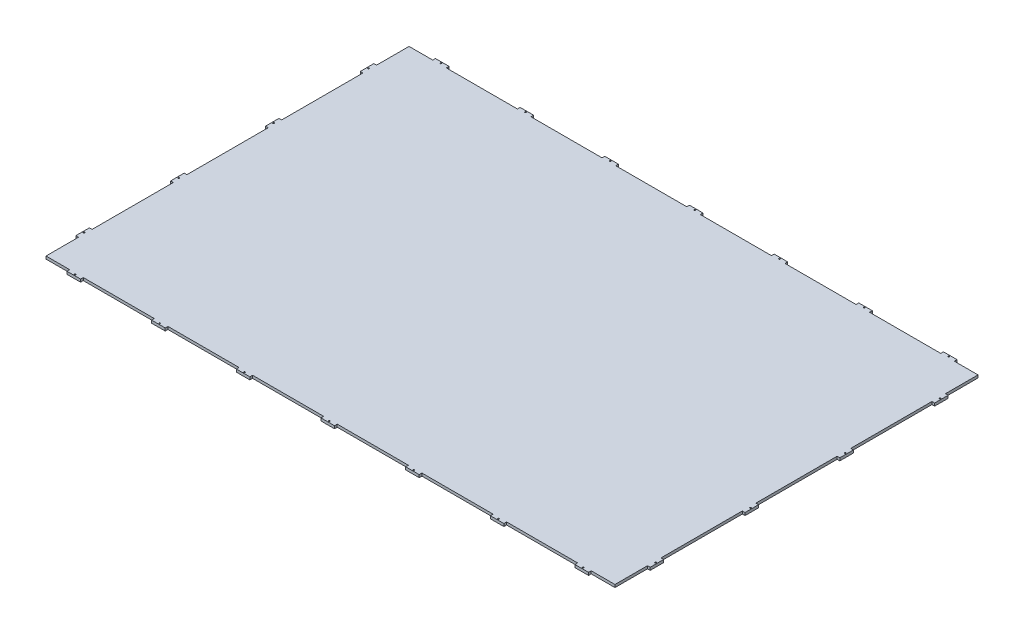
ISO-10303-21;
HEADER;
FILE_DESCRIPTION(('STEP AP214'),'2;1');
FILE_NAME('part.step','',(''),(''),'','','');
FILE_SCHEMA(('AUTOMOTIVE_DESIGN { 1 0 10303 214 1 1 1 1 }'));
ENDSEC;
DATA;
#1=APPLICATION_CONTEXT('core data for automotive mechanical design processes');
#2=APPLICATION_PROTOCOL_DEFINITION('international standard','automotive_design',2000,#1);
#3=PRODUCT_CONTEXT('',#1,'mechanical');
#4=PRODUCT('Part','Part','',(#3));
#5=PRODUCT_RELATED_PRODUCT_CATEGORY('part','',(#4));
#6=PRODUCT_DEFINITION_FORMATION('','',#4);
#7=PRODUCT_DEFINITION_CONTEXT('part definition',#1,'design');
#8=PRODUCT_DEFINITION('design','',#6,#7);
#9=PRODUCT_DEFINITION_SHAPE('','',#8);
#10=(LENGTH_UNIT() NAMED_UNIT(*) SI_UNIT(.MILLI.,.METRE.));
#11=(NAMED_UNIT(*) PLANE_ANGLE_UNIT() SI_UNIT($,.RADIAN.));
#12=(NAMED_UNIT(*) SI_UNIT($,.STERADIAN.) SOLID_ANGLE_UNIT());
#13=UNCERTAINTY_MEASURE_WITH_UNIT(LENGTH_MEASURE(1.E-05),#10,'distance_accuracy_value','');
#14=(GEOMETRIC_REPRESENTATION_CONTEXT(3) GLOBAL_UNCERTAINTY_ASSIGNED_CONTEXT((#13)) GLOBAL_UNIT_ASSIGNED_CONTEXT((#10,
#11,#12)) REPRESENTATION_CONTEXT('',''));
#15=CARTESIAN_POINT('',(0.,0.,0.));
#16=DIRECTION('',(0.,0.,1.));
#17=DIRECTION('',(1.,0.,0.));
#18=AXIS2_PLACEMENT_3D('',#15,#16,#17);
#19=CARTESIAN_POINT('',(0.,4.,0.));
#20=DIRECTION('',(0.,-1.,0.));
#21=DIRECTION('',(0.,0.,-1.));
#22=AXIS2_PLACEMENT_3D('',#19,#20,#21);
#23=PLANE('',#22);
#24=CARTESIAN_POINT('',(-375.,4.,-270.));
#25=DIRECTION('',(0.,1.,0.));
#26=DIRECTION('',(0.,0.,1.));
#27=AXIS2_PLACEMENT_3D('',#24,#25,#26);
#28=CIRCLE('',#27,1.);
#29=CARTESIAN_POINT('',(-375.,4.,-269.));
#30=VERTEX_POINT('',#29);
#31=EDGE_CURVE('E3075',#30,#30,#28,.T.);
#32=ORIENTED_EDGE('',*,*,#31,.F.);
#33=EDGE_LOOP('',(#32));
#34=FACE_BOUND('',#33,.T.);
#35=CARTESIAN_POINT('',(-250.,4.,-270.));
#36=DIRECTION('',(0.,1.,0.));
#37=DIRECTION('',(0.,0.,1.));
#38=AXIS2_PLACEMENT_3D('',#35,#36,#37);
#39=CIRCLE('',#38,1.);
#40=CARTESIAN_POINT('',(-250.,4.,-269.));
#41=VERTEX_POINT('',#40);
#42=EDGE_CURVE('E3080',#41,#41,#39,.T.);
#43=ORIENTED_EDGE('',*,*,#42,.F.);
#44=EDGE_LOOP('',(#43));
#45=FACE_BOUND('',#44,.T.);
#46=CARTESIAN_POINT('',(-125.,4.,-270.));
#47=DIRECTION('',(0.,1.,0.));
#48=DIRECTION('',(0.,0.,1.));
#49=AXIS2_PLACEMENT_3D('',#46,#47,#48);
#50=CIRCLE('',#49,0.999999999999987);
#51=CARTESIAN_POINT('',(-125.,4.,-269.));
#52=VERTEX_POINT('',#51);
#53=EDGE_CURVE('E3090',#52,#52,#50,.T.);
#54=ORIENTED_EDGE('',*,*,#53,.F.);
#55=EDGE_LOOP('',(#54));
#56=FACE_BOUND('',#55,.T.);
#57=CARTESIAN_POINT('',(0.,4.,-270.));
#58=DIRECTION('',(0.,1.,0.));
#59=DIRECTION('',(0.,0.,1.));
#60=AXIS2_PLACEMENT_3D('',#57,#58,#59);
#61=CIRCLE('',#60,0.999999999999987);
#62=CARTESIAN_POINT('',(0.,4.,-269.));
#63=VERTEX_POINT('',#62);
#64=EDGE_CURVE('E3098',#63,#63,#61,.T.);
#65=ORIENTED_EDGE('',*,*,#64,.F.);
#66=EDGE_LOOP('',(#65));
#67=FACE_BOUND('',#66,.T.);
#68=CARTESIAN_POINT('',(125.,4.,-270.));
#69=DIRECTION('',(0.,1.,0.));
#70=DIRECTION('',(0.,0.,1.));
#71=AXIS2_PLACEMENT_3D('',#68,#69,#70);
#72=CIRCLE('',#71,1.);
#73=CARTESIAN_POINT('',(125.,4.,-269.));
#74=VERTEX_POINT('',#73);
#75=EDGE_CURVE('E3106',#74,#74,#72,.T.);
#76=ORIENTED_EDGE('',*,*,#75,.F.);
#77=EDGE_LOOP('',(#76));
#78=FACE_BOUND('',#77,.T.);
#79=CARTESIAN_POINT('',(250.,4.,-270.));
#80=DIRECTION('',(0.,1.,0.));
#81=DIRECTION('',(0.,0.,1.));
#82=AXIS2_PLACEMENT_3D('',#79,#80,#81);
#83=CIRCLE('',#82,1.);
#84=CARTESIAN_POINT('',(250.,4.,-269.));
#85=VERTEX_POINT('',#84);
#86=EDGE_CURVE('E3114',#85,#85,#83,.T.);
#87=ORIENTED_EDGE('',*,*,#86,.F.);
#88=EDGE_LOOP('',(#87));
#89=FACE_BOUND('',#88,.T.);
#90=CARTESIAN_POINT('',(375.,4.,-270.));
#91=DIRECTION('',(0.,1.,0.));
#92=DIRECTION('',(0.,0.,1.));
#93=AXIS2_PLACEMENT_3D('',#90,#91,#92);
#94=CIRCLE('',#93,1.);
#95=CARTESIAN_POINT('',(375.,4.,-269.));
#96=VERTEX_POINT('',#95);
#97=EDGE_CURVE('E3122',#96,#96,#94,.T.);
#98=ORIENTED_EDGE('',*,*,#97,.F.);
#99=EDGE_LOOP('',(#98));
#100=FACE_BOUND('',#99,.T.);
#101=CARTESIAN_POINT('',(422.,4.,-210.));
#102=DIRECTION('',(0.,1.,0.));
#103=DIRECTION('',(0.,0.,1.));
#104=AXIS2_PLACEMENT_3D('',#101,#102,#103);
#105=CIRCLE('',#104,1.);
#106=CARTESIAN_POINT('',(422.,4.,-209.));
#107=VERTEX_POINT('',#106);
#108=EDGE_CURVE('E3130',#107,#107,#105,.T.);
#109=ORIENTED_EDGE('',*,*,#108,.F.);
#110=EDGE_LOOP('',(#109));
#111=FACE_BOUND('',#110,.T.);
#112=CARTESIAN_POINT('',(422.,4.,-70.));
#113=DIRECTION('',(0.,1.,0.));
#114=DIRECTION('',(0.,0.,1.));
#115=AXIS2_PLACEMENT_3D('',#112,#113,#114);
#116=CIRCLE('',#115,1.);
#117=CARTESIAN_POINT('',(422.,4.,-69.));
#118=VERTEX_POINT('',#117);
#119=EDGE_CURVE('E3138',#118,#118,#116,.T.);
#120=ORIENTED_EDGE('',*,*,#119,.F.);
#121=EDGE_LOOP('',(#120));
#122=FACE_BOUND('',#121,.T.);
#123=CARTESIAN_POINT('',(422.,4.,70.));
#124=DIRECTION('',(0.,1.,0.));
#125=DIRECTION('',(0.,0.,1.));
#126=AXIS2_PLACEMENT_3D('',#123,#124,#125);
#127=CIRCLE('',#126,1.);
#128=CARTESIAN_POINT('',(422.,4.,71.));
#129=VERTEX_POINT('',#128);
#130=EDGE_CURVE('E3146',#129,#129,#127,.T.);
#131=ORIENTED_EDGE('',*,*,#130,.F.);
#132=EDGE_LOOP('',(#131));
#133=FACE_BOUND('',#132,.T.);
#134=CARTESIAN_POINT('',(422.,4.,210.));
#135=DIRECTION('',(0.,1.,0.));
#136=DIRECTION('',(0.,0.,1.));
#137=AXIS2_PLACEMENT_3D('',#134,#135,#136);
#138=CIRCLE('',#137,1.);
#139=CARTESIAN_POINT('',(422.,4.,211.));
#140=VERTEX_POINT('',#139);
#141=EDGE_CURVE('E3154',#140,#140,#138,.T.);
#142=ORIENTED_EDGE('',*,*,#141,.F.);
#143=EDGE_LOOP('',(#142));
#144=FACE_BOUND('',#143,.T.);
#145=CARTESIAN_POINT('',(375.,4.,270.));
#146=DIRECTION('',(0.,1.,0.));
#147=DIRECTION('',(0.,0.,1.));
#148=AXIS2_PLACEMENT_3D('',#145,#146,#147);
#149=CIRCLE('',#148,1.);
#150=CARTESIAN_POINT('',(375.,4.,271.));
#151=VERTEX_POINT('',#150);
#152=EDGE_CURVE('E3162',#151,#151,#149,.T.);
#153=ORIENTED_EDGE('',*,*,#152,.F.);
#154=EDGE_LOOP('',(#153));
#155=FACE_BOUND('',#154,.T.);
#156=CARTESIAN_POINT('',(250.,4.,270.));
#157=DIRECTION('',(0.,1.,0.));
#158=DIRECTION('',(0.,0.,1.));
#159=AXIS2_PLACEMENT_3D('',#156,#157,#158);
#160=CIRCLE('',#159,1.);
#161=CARTESIAN_POINT('',(250.,4.,271.));
#162=VERTEX_POINT('',#161);
#163=EDGE_CURVE('E3170',#162,#162,#160,.T.);
#164=ORIENTED_EDGE('',*,*,#163,.F.);
#165=EDGE_LOOP('',(#164));
#166=FACE_BOUND('',#165,.T.);
#167=CARTESIAN_POINT('',(125.,4.,270.));
#168=DIRECTION('',(0.,1.,0.));
#169=DIRECTION('',(0.,0.,1.));
#170=AXIS2_PLACEMENT_3D('',#167,#168,#169);
#171=CIRCLE('',#170,1.);
#172=CARTESIAN_POINT('',(125.,4.,271.));
#173=VERTEX_POINT('',#172);
#174=EDGE_CURVE('E3178',#173,#173,#171,.T.);
#175=ORIENTED_EDGE('',*,*,#174,.F.);
#176=EDGE_LOOP('',(#175));
#177=FACE_BOUND('',#176,.T.);
#178=CARTESIAN_POINT('',(0.,4.,270.));
#179=DIRECTION('',(0.,1.,0.));
#180=DIRECTION('',(0.,0.,1.));
#181=AXIS2_PLACEMENT_3D('',#178,#179,#180);
#182=CIRCLE('',#181,0.999999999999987);
#183=CARTESIAN_POINT('',(0.,4.,271.));
#184=VERTEX_POINT('',#183);
#185=EDGE_CURVE('E3186',#184,#184,#182,.T.);
#186=ORIENTED_EDGE('',*,*,#185,.F.);
#187=EDGE_LOOP('',(#186));
#188=FACE_BOUND('',#187,.T.);
#189=CARTESIAN_POINT('',(-125.,4.,270.));
#190=DIRECTION('',(0.,1.,0.));
#191=DIRECTION('',(0.,0.,1.));
#192=AXIS2_PLACEMENT_3D('',#189,#190,#191);
#193=CIRCLE('',#192,0.999999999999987);
#194=CARTESIAN_POINT('',(-125.,4.,271.));
#195=VERTEX_POINT('',#194);
#196=EDGE_CURVE('E3194',#195,#195,#193,.T.);
#197=ORIENTED_EDGE('',*,*,#196,.F.);
#198=EDGE_LOOP('',(#197));
#199=FACE_BOUND('',#198,.T.);
#200=CARTESIAN_POINT('',(-250.,4.,270.));
#201=DIRECTION('',(0.,1.,0.));
#202=DIRECTION('',(0.,0.,1.));
#203=AXIS2_PLACEMENT_3D('',#200,#201,#202);
#204=CIRCLE('',#203,1.);
#205=CARTESIAN_POINT('',(-250.,4.,271.));
#206=VERTEX_POINT('',#205);
#207=EDGE_CURVE('E3202',#206,#206,#204,.T.);
#208=ORIENTED_EDGE('',*,*,#207,.F.);
#209=EDGE_LOOP('',(#208));
#210=FACE_BOUND('',#209,.T.);
#211=CARTESIAN_POINT('',(-375.,4.,270.));
#212=DIRECTION('',(0.,1.,0.));
#213=DIRECTION('',(0.,0.,1.));
#214=AXIS2_PLACEMENT_3D('',#211,#212,#213);
#215=CIRCLE('',#214,1.);
#216=CARTESIAN_POINT('',(-375.,4.,271.));
#217=VERTEX_POINT('',#216);
#218=EDGE_CURVE('E3210',#217,#217,#215,.T.);
#219=ORIENTED_EDGE('',*,*,#218,.F.);
#220=EDGE_LOOP('',(#219));
#221=FACE_BOUND('',#220,.T.);
#222=CARTESIAN_POINT('',(-422.,4.,-70.));
#223=DIRECTION('',(0.,1.,0.));
#224=DIRECTION('',(0.,0.,1.));
#225=AXIS2_PLACEMENT_3D('',#222,#223,#224);
#226=CIRCLE('',#225,1.);
#227=CARTESIAN_POINT('',(-422.,4.,-69.));
#228=VERTEX_POINT('',#227);
#229=EDGE_CURVE('E3234',#228,#228,#226,.T.);
#230=ORIENTED_EDGE('',*,*,#229,.F.);
#231=EDGE_LOOP('',(#230));
#232=FACE_BOUND('',#231,.T.);
#233=CARTESIAN_POINT('',(-422.,4.,-210.));
#234=DIRECTION('',(0.,1.,0.));
#235=DIRECTION('',(0.,0.,1.));
#236=AXIS2_PLACEMENT_3D('',#233,#234,#235);
#237=CIRCLE('',#236,1.);
#238=CARTESIAN_POINT('',(-422.,4.,-209.));
#239=VERTEX_POINT('',#238);
#240=EDGE_CURVE('E3241',#239,#239,#237,.T.);
#241=ORIENTED_EDGE('',*,*,#240,.F.);
#242=EDGE_LOOP('',(#241));
#243=FACE_BOUND('',#242,.T.);
#244=DIRECTION('',(-1.,0.,0.));
#245=VECTOR('',#244,1.);
#246=CARTESIAN_POINT('',(424.,4.,-220.));
#247=LINE('',#246,#245);
#248=CARTESIAN_POINT('',(424.,4.,-220.));
#249=VERTEX_POINT('',#248);
#250=CARTESIAN_POINT('',(420.,4.,-220.));
#251=VERTEX_POINT('',#250);
#252=EDGE_CURVE('E638',#249,#251,#247,.T.);
#253=ORIENTED_EDGE('',*,*,#252,.T.);
#254=DIRECTION('',(0.,0.,-1.));
#255=VECTOR('',#254,1.);
#256=CARTESIAN_POINT('',(420.,4.,-268.));
#257=LINE('',#256,#255);
#258=CARTESIAN_POINT('',(420.,4.,-268.));
#259=VERTEX_POINT('',#258);
#260=EDGE_CURVE('E629',#251,#259,#257,.T.);
#261=ORIENTED_EDGE('',*,*,#260,.T.);
#262=DIRECTION('',(-1.,0.,0.));
#263=VECTOR('',#262,1.);
#264=CARTESIAN_POINT('',(385.,4.,-268.));
#265=LINE('',#264,#263);
#266=CARTESIAN_POINT('',(385.,4.,-268.));
#267=VERTEX_POINT('',#266);
#268=EDGE_CURVE('E1175',#259,#267,#265,.T.);
#269=ORIENTED_EDGE('',*,*,#268,.T.);
#270=DIRECTION('',(0.,0.,-1.));
#271=VECTOR('',#270,1.);
#272=CARTESIAN_POINT('',(385.,4.,-272.));
#273=LINE('',#272,#271);
#274=CARTESIAN_POINT('',(385.,4.,-272.));
#275=VERTEX_POINT('',#274);
#276=EDGE_CURVE('E800',#267,#275,#273,.T.);
#277=ORIENTED_EDGE('',*,*,#276,.T.);
#278=DIRECTION('',(-1.,0.,0.));
#279=VECTOR('',#278,1.);
#280=CARTESIAN_POINT('',(-424.,4.,-272.));
#281=LINE('',#280,#279);
#282=CARTESIAN_POINT('',(365.,4.,-272.));
#283=VERTEX_POINT('',#282);
#284=EDGE_CURVE('E1460',#275,#283,#281,.T.);
#285=ORIENTED_EDGE('',*,*,#284,.T.);
#286=DIRECTION('',(0.,0.,1.));
#287=VECTOR('',#286,1.);
#288=CARTESIAN_POINT('',(365.,4.,-272.));
#289=LINE('',#288,#287);
#290=CARTESIAN_POINT('',(365.,4.,-268.));
#291=VERTEX_POINT('',#290);
#292=EDGE_CURVE('E1141',#283,#291,#289,.T.);
#293=ORIENTED_EDGE('',*,*,#292,.T.);
#294=DIRECTION('',(-1.,0.,0.));
#295=VECTOR('',#294,1.);
#296=CARTESIAN_POINT('',(260.,4.,-268.));
#297=LINE('',#296,#295);
#298=CARTESIAN_POINT('',(260.,4.,-268.));
#299=VERTEX_POINT('',#298);
#300=EDGE_CURVE('E1153',#291,#299,#297,.T.);
#301=ORIENTED_EDGE('',*,*,#300,.T.);
#302=DIRECTION('',(0.,0.,-1.));
#303=VECTOR('',#302,1.);
#304=CARTESIAN_POINT('',(260.,4.,-272.));
#305=LINE('',#304,#303);
#306=CARTESIAN_POINT('',(260.,4.,-272.));
#307=VERTEX_POINT('',#306);
#308=EDGE_CURVE('E1149',#299,#307,#305,.T.);
#309=ORIENTED_EDGE('',*,*,#308,.T.);
#310=CARTESIAN_POINT('',(240.,4.,-272.));
#311=VERTEX_POINT('',#310);
#312=EDGE_CURVE('E1775',#307,#311,#281,.T.);
#313=ORIENTED_EDGE('',*,*,#312,.T.);
#314=DIRECTION('',(0.,0.,1.));
#315=VECTOR('',#314,1.);
#316=CARTESIAN_POINT('',(240.,4.,-272.));
#317=LINE('',#316,#315);
#318=CARTESIAN_POINT('',(240.,4.,-268.));
#319=VERTEX_POINT('',#318);
#320=EDGE_CURVE('E1106',#311,#319,#317,.T.);
#321=ORIENTED_EDGE('',*,*,#320,.T.);
#322=DIRECTION('',(-1.,0.,0.));
#323=VECTOR('',#322,1.);
#324=CARTESIAN_POINT('',(135.,4.,-268.));
#325=LINE('',#324,#323);
#326=CARTESIAN_POINT('',(135.,4.,-268.));
#327=VERTEX_POINT('',#326);
#328=EDGE_CURVE('E1118',#319,#327,#325,.T.);
#329=ORIENTED_EDGE('',*,*,#328,.T.);
#330=DIRECTION('',(0.,0.,-1.));
#331=VECTOR('',#330,1.);
#332=CARTESIAN_POINT('',(135.,4.,-272.));
#333=LINE('',#332,#331);
#334=CARTESIAN_POINT('',(135.,4.,-272.));
#335=VERTEX_POINT('',#334);
#336=EDGE_CURVE('E1114',#327,#335,#333,.T.);
#337=ORIENTED_EDGE('',*,*,#336,.T.);
#338=CARTESIAN_POINT('',(115.,4.,-272.));
#339=VERTEX_POINT('',#338);
#340=EDGE_CURVE('E1779',#335,#339,#281,.T.);
#341=ORIENTED_EDGE('',*,*,#340,.T.);
#342=DIRECTION('',(0.,0.,1.));
#343=VECTOR('',#342,1.);
#344=CARTESIAN_POINT('',(115.,4.,-272.));
#345=LINE('',#344,#343);
#346=CARTESIAN_POINT('',(115.,4.,-268.));
#347=VERTEX_POINT('',#346);
#348=EDGE_CURVE('E1071',#339,#347,#345,.T.);
#349=ORIENTED_EDGE('',*,*,#348,.T.);
#350=DIRECTION('',(-1.,0.,0.));
#351=VECTOR('',#350,1.);
#352=CARTESIAN_POINT('',(10.,4.,-268.));
#353=LINE('',#352,#351);
#354=CARTESIAN_POINT('',(10.,4.,-268.));
#355=VERTEX_POINT('',#354);
#356=EDGE_CURVE('E1083',#347,#355,#353,.T.);
#357=ORIENTED_EDGE('',*,*,#356,.T.);
#358=DIRECTION('',(0.,0.,-1.));
#359=VECTOR('',#358,1.);
#360=CARTESIAN_POINT('',(10.,4.,-272.));
#361=LINE('',#360,#359);
#362=CARTESIAN_POINT('',(10.,4.,-272.));
#363=VERTEX_POINT('',#362);
#364=EDGE_CURVE('E1079',#355,#363,#361,.T.);
#365=ORIENTED_EDGE('',*,*,#364,.T.);
#366=CARTESIAN_POINT('',(-10.,4.,-272.));
#367=VERTEX_POINT('',#366);
#368=EDGE_CURVE('E1784',#363,#367,#281,.T.);
#369=ORIENTED_EDGE('',*,*,#368,.T.);
#370=DIRECTION('',(0.,0.,1.));
#371=VECTOR('',#370,1.);
#372=CARTESIAN_POINT('',(-10.,4.,-272.));
#373=LINE('',#372,#371);
#374=CARTESIAN_POINT('',(-10.,4.,-268.));
#375=VERTEX_POINT('',#374);
#376=EDGE_CURVE('E1036',#367,#375,#373,.T.);
#377=ORIENTED_EDGE('',*,*,#376,.T.);
#378=DIRECTION('',(-1.,0.,0.));
#379=VECTOR('',#378,1.);
#380=CARTESIAN_POINT('',(-115.,4.,-268.));
#381=LINE('',#380,#379);
#382=CARTESIAN_POINT('',(-115.,4.,-268.));
#383=VERTEX_POINT('',#382);
#384=EDGE_CURVE('E1048',#375,#383,#381,.T.);
#385=ORIENTED_EDGE('',*,*,#384,.T.);
#386=DIRECTION('',(0.,0.,-1.));
#387=VECTOR('',#386,1.);
#388=CARTESIAN_POINT('',(-115.,4.,-272.));
#389=LINE('',#388,#387);
#390=CARTESIAN_POINT('',(-115.,4.,-272.));
#391=VERTEX_POINT('',#390);
#392=EDGE_CURVE('E1044',#383,#391,#389,.T.);
#393=ORIENTED_EDGE('',*,*,#392,.T.);
#394=CARTESIAN_POINT('',(-135.,4.,-272.));
#395=VERTEX_POINT('',#394);
#396=EDGE_CURVE('E1789',#391,#395,#281,.T.);
#397=ORIENTED_EDGE('',*,*,#396,.T.);
#398=DIRECTION('',(0.,0.,1.));
#399=VECTOR('',#398,1.);
#400=CARTESIAN_POINT('',(-135.,4.,-272.));
#401=LINE('',#400,#399);
#402=CARTESIAN_POINT('',(-135.,4.,-268.));
#403=VERTEX_POINT('',#402);
#404=EDGE_CURVE('E1001',#395,#403,#401,.T.);
#405=ORIENTED_EDGE('',*,*,#404,.T.);
#406=DIRECTION('',(-1.,0.,0.));
#407=VECTOR('',#406,1.);
#408=CARTESIAN_POINT('',(-240.,4.,-268.));
#409=LINE('',#408,#407);
#410=CARTESIAN_POINT('',(-240.,4.,-268.));
#411=VERTEX_POINT('',#410);
#412=EDGE_CURVE('E1013',#403,#411,#409,.T.);
#413=ORIENTED_EDGE('',*,*,#412,.T.);
#414=DIRECTION('',(0.,0.,-1.));
#415=VECTOR('',#414,1.);
#416=CARTESIAN_POINT('',(-240.,4.,-272.));
#417=LINE('',#416,#415);
#418=CARTESIAN_POINT('',(-240.,4.,-272.));
#419=VERTEX_POINT('',#418);
#420=EDGE_CURVE('E1009',#411,#419,#417,.T.);
#421=ORIENTED_EDGE('',*,*,#420,.T.);
#422=CARTESIAN_POINT('',(-260.,4.,-272.));
#423=VERTEX_POINT('',#422);
#424=EDGE_CURVE('E1459',#419,#423,#281,.T.);
#425=ORIENTED_EDGE('',*,*,#424,.T.);
#426=DIRECTION('',(0.,0.,1.));
#427=VECTOR('',#426,1.);
#428=CARTESIAN_POINT('',(-260.,4.,-272.));
#429=LINE('',#428,#427);
#430=CARTESIAN_POINT('',(-260.,4.,-268.));
#431=VERTEX_POINT('',#430);
#432=EDGE_CURVE('E966',#423,#431,#429,.T.);
#433=ORIENTED_EDGE('',*,*,#432,.T.);
#434=DIRECTION('',(-1.,0.,0.));
#435=VECTOR('',#434,1.);
#436=CARTESIAN_POINT('',(-365.,4.,-268.));
#437=LINE('',#436,#435);
#438=CARTESIAN_POINT('',(-365.,4.,-268.));
#439=VERTEX_POINT('',#438);
#440=EDGE_CURVE('E978',#431,#439,#437,.T.);
#441=ORIENTED_EDGE('',*,*,#440,.T.);
#442=DIRECTION('',(0.,0.,-1.));
#443=VECTOR('',#442,1.);
#444=CARTESIAN_POINT('',(-365.,4.,-272.));
#445=LINE('',#444,#443);
#446=CARTESIAN_POINT('',(-365.,4.,-272.));
#447=VERTEX_POINT('',#446);
#448=EDGE_CURVE('E974',#439,#447,#445,.T.);
#449=ORIENTED_EDGE('',*,*,#448,.T.);
#450=CARTESIAN_POINT('',(-385.,4.,-272.));
#451=VERTEX_POINT('',#450);
#452=EDGE_CURVE('E1455',#447,#451,#281,.T.);
#453=ORIENTED_EDGE('',*,*,#452,.T.);
#454=DIRECTION('',(0.,0.,1.));
#455=VECTOR('',#454,1.);
#456=CARTESIAN_POINT('',(-385.,4.,-272.));
#457=LINE('',#456,#455);
#458=CARTESIAN_POINT('',(-385.,4.,-268.));
#459=VERTEX_POINT('',#458);
#460=EDGE_CURVE('E942',#451,#459,#457,.T.);
#461=ORIENTED_EDGE('',*,*,#460,.T.);
#462=DIRECTION('',(-1.,0.,0.));
#463=VECTOR('',#462,1.);
#464=CARTESIAN_POINT('',(-424.,4.,-268.));
#465=LINE('',#464,#463);
#466=CARTESIAN_POINT('',(-420.,4.,-268.));
#467=VERTEX_POINT('',#466);
#468=EDGE_CURVE('E947',#459,#467,#465,.T.);
#469=ORIENTED_EDGE('',*,*,#468,.T.);
#470=DIRECTION('',(0.,0.,-1.));
#471=VECTOR('',#470,1.);
#472=CARTESIAN_POINT('',(-420.,4.,-268.));
#473=LINE('',#472,#471);
#474=CARTESIAN_POINT('',(-420.,4.,-220.));
#475=VERTEX_POINT('',#474);
#476=EDGE_CURVE('E784',#475,#467,#473,.T.);
#477=ORIENTED_EDGE('',*,*,#476,.F.);
#478=DIRECTION('',(1.,0.,0.));
#479=VECTOR('',#478,1.);
#480=CARTESIAN_POINT('',(-424.,4.,-220.));
#481=LINE('',#480,#479);
#482=CARTESIAN_POINT('',(-424.,4.,-220.));
#483=VERTEX_POINT('',#482);
#484=EDGE_CURVE('E789',#483,#475,#481,.T.);
#485=ORIENTED_EDGE('',*,*,#484,.F.);
#486=DIRECTION('',(0.,0.,1.));
#487=VECTOR('',#486,1.);
#488=CARTESIAN_POINT('',(-424.,4.,272.));
#489=LINE('',#488,#487);
#490=CARTESIAN_POINT('',(-424.,4.,-200.));
#491=VERTEX_POINT('',#490);
#492=EDGE_CURVE('E1465',#483,#491,#489,.T.);
#493=ORIENTED_EDGE('',*,*,#492,.T.);
#494=DIRECTION('',(-1.,0.,0.));
#495=VECTOR('',#494,1.);
#496=CARTESIAN_POINT('',(-424.,4.,-200.));
#497=LINE('',#496,#495);
#498=CARTESIAN_POINT('',(-420.,4.,-200.));
#499=VERTEX_POINT('',#498);
#500=EDGE_CURVE('E811',#499,#491,#497,.T.);
#501=ORIENTED_EDGE('',*,*,#500,.F.);
#502=DIRECTION('',(0.,0.,-1.));
#503=VECTOR('',#502,1.);
#504=CARTESIAN_POINT('',(-420.,4.,-200.));
#505=LINE('',#504,#503);
#506=CARTESIAN_POINT('',(-420.,4.,-80.));
#507=VERTEX_POINT('',#506);
#508=EDGE_CURVE('E824',#507,#499,#505,.T.);
#509=ORIENTED_EDGE('',*,*,#508,.F.);
#510=DIRECTION('',(1.,0.,0.));
#511=VECTOR('',#510,1.);
#512=CARTESIAN_POINT('',(-424.,4.,-80.));
#513=LINE('',#512,#511);
#514=CARTESIAN_POINT('',(-424.,4.,-80.));
#515=VERTEX_POINT('',#514);
#516=EDGE_CURVE('E820',#515,#507,#513,.T.);
#517=ORIENTED_EDGE('',*,*,#516,.F.);
#518=CARTESIAN_POINT('',(-424.,4.,-60.));
#519=VERTEX_POINT('',#518);
#520=EDGE_CURVE('E1521',#515,#519,#489,.T.);
#521=ORIENTED_EDGE('',*,*,#520,.T.);
#522=DIRECTION('',(-1.,0.,0.));
#523=VECTOR('',#522,1.);
#524=CARTESIAN_POINT('',(-424.,4.,-60.));
#525=LINE('',#524,#523);
#526=CARTESIAN_POINT('',(-420.,4.,-60.));
#527=VERTEX_POINT('',#526);
#528=EDGE_CURVE('E847',#527,#519,#525,.T.);
#529=ORIENTED_EDGE('',*,*,#528,.F.);
#530=DIRECTION('',(0.,0.,-1.));
#531=VECTOR('',#530,1.);
#532=CARTESIAN_POINT('',(-420.,4.,-60.));
#533=LINE('',#532,#531);
#534=CARTESIAN_POINT('',(-420.,4.,60.));
#535=VERTEX_POINT('',#534);
#536=EDGE_CURVE('E860',#535,#527,#533,.T.);
#537=ORIENTED_EDGE('',*,*,#536,.F.);
#538=DIRECTION('',(1.,0.,0.));
#539=VECTOR('',#538,1.);
#540=CARTESIAN_POINT('',(-424.,4.,60.));
#541=LINE('',#540,#539);
#542=CARTESIAN_POINT('',(-424.,4.,60.));
#543=VERTEX_POINT('',#542);
#544=EDGE_CURVE('E856',#543,#535,#541,.T.);
#545=ORIENTED_EDGE('',*,*,#544,.F.);
#546=CARTESIAN_POINT('',(-424.,4.,80.));
#547=VERTEX_POINT('',#546);
#548=EDGE_CURVE('E1464',#543,#547,#489,.T.);
#549=ORIENTED_EDGE('',*,*,#548,.T.);
#550=DIRECTION('',(-1.,0.,0.));
#551=VECTOR('',#550,1.);
#552=CARTESIAN_POINT('',(-424.,4.,80.));
#553=LINE('',#552,#551);
#554=CARTESIAN_POINT('',(-420.,4.,80.));
#555=VERTEX_POINT('',#554);
#556=EDGE_CURVE('E883',#555,#547,#553,.T.);
#557=ORIENTED_EDGE('',*,*,#556,.F.);
#558=DIRECTION('',(0.,0.,-1.));
#559=VECTOR('',#558,1.);
#560=CARTESIAN_POINT('',(-420.,4.,80.));
#561=LINE('',#560,#559);
#562=CARTESIAN_POINT('',(-420.,4.,200.));
#563=VERTEX_POINT('',#562);
#564=EDGE_CURVE('E896',#563,#555,#561,.T.);
#565=ORIENTED_EDGE('',*,*,#564,.F.);
#566=DIRECTION('',(1.,0.,0.));
#567=VECTOR('',#566,1.);
#568=CARTESIAN_POINT('',(-424.,4.,200.));
#569=LINE('',#568,#567);
#570=CARTESIAN_POINT('',(-424.,4.,200.));
#571=VERTEX_POINT('',#570);
#572=EDGE_CURVE('E892',#571,#563,#569,.T.);
#573=ORIENTED_EDGE('',*,*,#572,.F.);
#574=CARTESIAN_POINT('',(-424.,4.,220.));
#575=VERTEX_POINT('',#574);
#576=EDGE_CURVE('E1461',#571,#575,#489,.T.);
#577=ORIENTED_EDGE('',*,*,#576,.T.);
#578=DIRECTION('',(-1.,0.,0.));
#579=VECTOR('',#578,1.);
#580=CARTESIAN_POINT('',(-424.,4.,220.));
#581=LINE('',#580,#579);
#582=CARTESIAN_POINT('',(-420.,4.,220.));
#583=VERTEX_POINT('',#582);
#584=EDGE_CURVE('E919',#583,#575,#581,.T.);
#585=ORIENTED_EDGE('',*,*,#584,.F.);
#586=DIRECTION('',(0.,0.,-1.));
#587=VECTOR('',#586,1.);
#588=CARTESIAN_POINT('',(-420.,4.,220.));
#589=LINE('',#588,#587);
#590=CARTESIAN_POINT('',(-420.,4.,268.));
#591=VERTEX_POINT('',#590);
#592=EDGE_CURVE('E651',#591,#583,#589,.T.);
#593=ORIENTED_EDGE('',*,*,#592,.F.);
#594=DIRECTION('',(-1.,0.,0.));
#595=VECTOR('',#594,1.);
#596=CARTESIAN_POINT('',(-424.,4.,268.));
#597=LINE('',#596,#595);
#598=CARTESIAN_POINT('',(-385.,4.,268.));
#599=VERTEX_POINT('',#598);
#600=EDGE_CURVE('E1194',#599,#591,#597,.T.);
#601=ORIENTED_EDGE('',*,*,#600,.F.);
#602=DIRECTION('',(0.,0.,-1.));
#603=VECTOR('',#602,1.);
#604=CARTESIAN_POINT('',(-385.,4.,272.));
#605=LINE('',#604,#603);
#606=CARTESIAN_POINT('',(-385.,4.,272.));
#607=VERTEX_POINT('',#606);
#608=EDGE_CURVE('E1199',#607,#599,#605,.T.);
#609=ORIENTED_EDGE('',*,*,#608,.F.);
#610=DIRECTION('',(1.,0.,0.));
#611=VECTOR('',#610,1.);
#612=CARTESIAN_POINT('',(-424.,4.,272.));
#613=LINE('',#612,#611);
#614=CARTESIAN_POINT('',(-365.,4.,272.));
#615=VERTEX_POINT('',#614);
#616=EDGE_CURVE('E11',#607,#615,#613,.T.);
#617=ORIENTED_EDGE('',*,*,#616,.T.);
#618=DIRECTION('',(0.,0.,1.));
#619=VECTOR('',#618,1.);
#620=CARTESIAN_POINT('',(-365.,4.,272.));
#621=LINE('',#620,#619);
#622=CARTESIAN_POINT('',(-365.,4.,268.));
#623=VERTEX_POINT('',#622);
#624=EDGE_CURVE('E1227',#623,#615,#621,.T.);
#625=ORIENTED_EDGE('',*,*,#624,.F.);
#626=DIRECTION('',(-1.,0.,0.));
#627=VECTOR('',#626,1.);
#628=CARTESIAN_POINT('',(-365.,4.,268.));
#629=LINE('',#628,#627);
#630=CARTESIAN_POINT('',(-260.,4.,268.));
#631=VERTEX_POINT('',#630);
#632=EDGE_CURVE('E1218',#631,#623,#629,.T.);
#633=ORIENTED_EDGE('',*,*,#632,.F.);
#634=DIRECTION('',(0.,0.,-1.));
#635=VECTOR('',#634,1.);
#636=CARTESIAN_POINT('',(-260.,4.,272.));
#637=LINE('',#636,#635);
#638=CARTESIAN_POINT('',(-260.,4.,272.));
#639=VERTEX_POINT('',#638);
#640=EDGE_CURVE('E1230',#639,#631,#637,.T.);
#641=ORIENTED_EDGE('',*,*,#640,.F.);
#642=CARTESIAN_POINT('',(-240.,4.,272.));
#643=VERTEX_POINT('',#642);
#644=EDGE_CURVE('E48',#639,#643,#613,.T.);
#645=ORIENTED_EDGE('',*,*,#644,.T.);
#646=DIRECTION('',(0.,0.,1.));
#647=VECTOR('',#646,1.);
#648=CARTESIAN_POINT('',(-240.,4.,272.));
#649=LINE('',#648,#647);
#650=CARTESIAN_POINT('',(-240.,4.,268.));
#651=VERTEX_POINT('',#650);
#652=EDGE_CURVE('E1263',#651,#643,#649,.T.);
#653=ORIENTED_EDGE('',*,*,#652,.F.);
#654=DIRECTION('',(-1.,0.,0.));
#655=VECTOR('',#654,1.);
#656=CARTESIAN_POINT('',(-240.,4.,268.));
#657=LINE('',#656,#655);
#658=CARTESIAN_POINT('',(-135.,4.,268.));
#659=VERTEX_POINT('',#658);
#660=EDGE_CURVE('E1254',#659,#651,#657,.T.);
#661=ORIENTED_EDGE('',*,*,#660,.F.);
#662=DIRECTION('',(0.,0.,-1.));
#663=VECTOR('',#662,1.);
#664=CARTESIAN_POINT('',(-135.,4.,272.));
#665=LINE('',#664,#663);
#666=CARTESIAN_POINT('',(-135.,4.,272.));
#667=VERTEX_POINT('',#666);
#668=EDGE_CURVE('E1266',#667,#659,#665,.T.);
#669=ORIENTED_EDGE('',*,*,#668,.F.);
#670=CARTESIAN_POINT('',(-115.,4.,272.));
#671=VERTEX_POINT('',#670);
#672=EDGE_CURVE('E1588',#667,#671,#613,.T.);
#673=ORIENTED_EDGE('',*,*,#672,.T.);
#674=DIRECTION('',(0.,0.,1.));
#675=VECTOR('',#674,1.);
#676=CARTESIAN_POINT('',(-115.,4.,272.));
#677=LINE('',#676,#675);
#678=CARTESIAN_POINT('',(-115.,4.,268.));
#679=VERTEX_POINT('',#678);
#680=EDGE_CURVE('E1299',#679,#671,#677,.T.);
#681=ORIENTED_EDGE('',*,*,#680,.F.);
#682=DIRECTION('',(-1.,0.,0.));
#683=VECTOR('',#682,1.);
#684=CARTESIAN_POINT('',(-115.,4.,268.));
#685=LINE('',#684,#683);
#686=CARTESIAN_POINT('',(-10.,4.,268.));
#687=VERTEX_POINT('',#686);
#688=EDGE_CURVE('E1290',#687,#679,#685,.T.);
#689=ORIENTED_EDGE('',*,*,#688,.F.);
#690=DIRECTION('',(0.,0.,-1.));
#691=VECTOR('',#690,1.);
#692=CARTESIAN_POINT('',(-10.,4.,272.));
#693=LINE('',#692,#691);
#694=CARTESIAN_POINT('',(-10.,4.,272.));
#695=VERTEX_POINT('',#694);
#696=EDGE_CURVE('E1302',#695,#687,#693,.T.);
#697=ORIENTED_EDGE('',*,*,#696,.F.);
#698=CARTESIAN_POINT('',(10.,4.,272.));
#699=VERTEX_POINT('',#698);
#700=EDGE_CURVE('E1592',#695,#699,#613,.T.);
#701=ORIENTED_EDGE('',*,*,#700,.T.);
#702=DIRECTION('',(0.,0.,1.));
#703=VECTOR('',#702,1.);
#704=CARTESIAN_POINT('',(10.,4.,272.));
#705=LINE('',#704,#703);
#706=CARTESIAN_POINT('',(10.,4.,268.));
#707=VERTEX_POINT('',#706);
#708=EDGE_CURVE('E1335',#707,#699,#705,.T.);
#709=ORIENTED_EDGE('',*,*,#708,.F.);
#710=DIRECTION('',(-1.,0.,0.));
#711=VECTOR('',#710,1.);
#712=CARTESIAN_POINT('',(10.,4.,268.));
#713=LINE('',#712,#711);
#714=CARTESIAN_POINT('',(115.,4.,268.));
#715=VERTEX_POINT('',#714);
#716=EDGE_CURVE('E1326',#715,#707,#713,.T.);
#717=ORIENTED_EDGE('',*,*,#716,.F.);
#718=DIRECTION('',(0.,0.,-1.));
#719=VECTOR('',#718,1.);
#720=CARTESIAN_POINT('',(115.,4.,272.));
#721=LINE('',#720,#719);
#722=CARTESIAN_POINT('',(115.,4.,272.));
#723=VERTEX_POINT('',#722);
#724=EDGE_CURVE('E1338',#723,#715,#721,.T.);
#725=ORIENTED_EDGE('',*,*,#724,.F.);
#726=CARTESIAN_POINT('',(135.,4.,272.));
#727=VERTEX_POINT('',#726);
#728=EDGE_CURVE('E1599',#723,#727,#613,.T.);
#729=ORIENTED_EDGE('',*,*,#728,.T.);
#730=DIRECTION('',(0.,0.,1.));
#731=VECTOR('',#730,1.);
#732=CARTESIAN_POINT('',(135.,4.,272.));
#733=LINE('',#732,#731);
#734=CARTESIAN_POINT('',(135.,4.,268.));
#735=VERTEX_POINT('',#734);
#736=EDGE_CURVE('E1371',#735,#727,#733,.T.);
#737=ORIENTED_EDGE('',*,*,#736,.F.);
#738=DIRECTION('',(-1.,0.,0.));
#739=VECTOR('',#738,1.);
#740=CARTESIAN_POINT('',(135.,4.,268.));
#741=LINE('',#740,#739);
#742=CARTESIAN_POINT('',(240.,4.,268.));
#743=VERTEX_POINT('',#742);
#744=EDGE_CURVE('E1362',#743,#735,#741,.T.);
#745=ORIENTED_EDGE('',*,*,#744,.F.);
#746=DIRECTION('',(0.,0.,-1.));
#747=VECTOR('',#746,1.);
#748=CARTESIAN_POINT('',(240.,4.,272.));
#749=LINE('',#748,#747);
#750=CARTESIAN_POINT('',(240.,4.,272.));
#751=VERTEX_POINT('',#750);
#752=EDGE_CURVE('E1374',#751,#743,#749,.T.);
#753=ORIENTED_EDGE('',*,*,#752,.F.);
#754=CARTESIAN_POINT('',(260.,4.,272.));
#755=VERTEX_POINT('',#754);
#756=EDGE_CURVE('E1469',#751,#755,#613,.T.);
#757=ORIENTED_EDGE('',*,*,#756,.T.);
#758=DIRECTION('',(0.,0.,1.));
#759=VECTOR('',#758,1.);
#760=CARTESIAN_POINT('',(260.,4.,272.));
#761=LINE('',#760,#759);
#762=CARTESIAN_POINT('',(260.,4.,268.));
#763=VERTEX_POINT('',#762);
#764=EDGE_CURVE('E1407',#763,#755,#761,.T.);
#765=ORIENTED_EDGE('',*,*,#764,.F.);
#766=DIRECTION('',(-1.,0.,0.));
#767=VECTOR('',#766,1.);
#768=CARTESIAN_POINT('',(260.,4.,268.));
#769=LINE('',#768,#767);
#770=CARTESIAN_POINT('',(365.,4.,268.));
#771=VERTEX_POINT('',#770);
#772=EDGE_CURVE('E1398',#771,#763,#769,.T.);
#773=ORIENTED_EDGE('',*,*,#772,.F.);
#774=DIRECTION('',(0.,0.,-1.));
#775=VECTOR('',#774,1.);
#776=CARTESIAN_POINT('',(365.,4.,272.));
#777=LINE('',#776,#775);
#778=CARTESIAN_POINT('',(365.,4.,272.));
#779=VERTEX_POINT('',#778);
#780=EDGE_CURVE('E1410',#779,#771,#777,.T.);
#781=ORIENTED_EDGE('',*,*,#780,.F.);
#782=CARTESIAN_POINT('',(385.,4.,272.));
#783=VERTEX_POINT('',#782);
#784=EDGE_CURVE('E50',#779,#783,#613,.T.);
#785=ORIENTED_EDGE('',*,*,#784,.T.);
#786=DIRECTION('',(0.,0.,1.));
#787=VECTOR('',#786,1.);
#788=CARTESIAN_POINT('',(385.,4.,272.));
#789=LINE('',#788,#787);
#790=CARTESIAN_POINT('',(385.,4.,268.));
#791=VERTEX_POINT('',#790);
#792=EDGE_CURVE('E959',#791,#783,#789,.T.);
#793=ORIENTED_EDGE('',*,*,#792,.F.);
#794=DIRECTION('',(-1.,0.,0.));
#795=VECTOR('',#794,1.);
#796=CARTESIAN_POINT('',(385.,4.,268.));
#797=LINE('',#796,#795);
#798=CARTESIAN_POINT('',(420.,4.,268.));
#799=VERTEX_POINT('',#798);
#800=EDGE_CURVE('E1434',#799,#791,#797,.T.);
#801=ORIENTED_EDGE('',*,*,#800,.F.);
#802=DIRECTION('',(0.,0.,-1.));
#803=VECTOR('',#802,1.);
#804=CARTESIAN_POINT('',(420.,4.,220.));
#805=LINE('',#804,#803);
#806=CARTESIAN_POINT('',(420.,4.,220.));
#807=VERTEX_POINT('',#806);
#808=EDGE_CURVE('E760',#799,#807,#805,.T.);
#809=ORIENTED_EDGE('',*,*,#808,.T.);
#810=DIRECTION('',(1.,0.,0.));
#811=VECTOR('',#810,1.);
#812=CARTESIAN_POINT('',(424.,4.,220.));
#813=LINE('',#812,#811);
#814=CARTESIAN_POINT('',(424.,4.,220.));
#815=VERTEX_POINT('',#814);
#816=EDGE_CURVE('E764',#807,#815,#813,.T.);
#817=ORIENTED_EDGE('',*,*,#816,.T.);
#818=DIRECTION('',(0.,0.,-1.));
#819=VECTOR('',#818,1.);
#820=CARTESIAN_POINT('',(424.,4.,272.));
#821=LINE('',#820,#819);
#822=CARTESIAN_POINT('',(424.,4.,200.));
#823=VERTEX_POINT('',#822);
#824=EDGE_CURVE('E1454',#815,#823,#821,.T.);
#825=ORIENTED_EDGE('',*,*,#824,.T.);
#826=DIRECTION('',(-1.,0.,0.));
#827=VECTOR('',#826,1.);
#828=CARTESIAN_POINT('',(424.,4.,200.));
#829=LINE('',#828,#827);
#830=CARTESIAN_POINT('',(420.,4.,200.));
#831=VERTEX_POINT('',#830);
#832=EDGE_CURVE('E725',#823,#831,#829,.T.);
#833=ORIENTED_EDGE('',*,*,#832,.T.);
#834=DIRECTION('',(0.,0.,-1.));
#835=VECTOR('',#834,1.);
#836=CARTESIAN_POINT('',(420.,4.,80.));
#837=LINE('',#836,#835);
#838=CARTESIAN_POINT('',(420.,4.,80.));
#839=VERTEX_POINT('',#838);
#840=EDGE_CURVE('E737',#831,#839,#837,.T.);
#841=ORIENTED_EDGE('',*,*,#840,.T.);
#842=DIRECTION('',(1.,0.,0.));
#843=VECTOR('',#842,1.);
#844=CARTESIAN_POINT('',(424.,4.,80.));
#845=LINE('',#844,#843);
#846=CARTESIAN_POINT('',(424.,4.,80.));
#847=VERTEX_POINT('',#846);
#848=EDGE_CURVE('E733',#839,#847,#845,.T.);
#849=ORIENTED_EDGE('',*,*,#848,.T.);
#850=CARTESIAN_POINT('',(424.,4.,60.));
#851=VERTEX_POINT('',#850);
#852=EDGE_CURVE('E1693',#847,#851,#821,.T.);
#853=ORIENTED_EDGE('',*,*,#852,.T.);
#854=DIRECTION('',(-1.,0.,0.));
#855=VECTOR('',#854,1.);
#856=CARTESIAN_POINT('',(424.,4.,60.));
#857=LINE('',#856,#855);
#858=CARTESIAN_POINT('',(420.,4.,60.));
#859=VERTEX_POINT('',#858);
#860=EDGE_CURVE('E692',#851,#859,#857,.T.);
#861=ORIENTED_EDGE('',*,*,#860,.T.);
#862=DIRECTION('',(0.,0.,-1.));
#863=VECTOR('',#862,1.);
#864=CARTESIAN_POINT('',(420.,4.,-60.));
#865=LINE('',#864,#863);
#866=CARTESIAN_POINT('',(420.,4.,-60.));
#867=VERTEX_POINT('',#866);
#868=EDGE_CURVE('E703',#859,#867,#865,.T.);
#869=ORIENTED_EDGE('',*,*,#868,.T.);
#870=DIRECTION('',(1.,0.,0.));
#871=VECTOR('',#870,1.);
#872=CARTESIAN_POINT('',(424.,4.,-60.));
#873=LINE('',#872,#871);
#874=CARTESIAN_POINT('',(424.,4.,-60.));
#875=VERTEX_POINT('',#874);
#876=EDGE_CURVE('E699',#867,#875,#873,.T.);
#877=ORIENTED_EDGE('',*,*,#876,.T.);
#878=CARTESIAN_POINT('',(424.,4.,-80.));
#879=VERTEX_POINT('',#878);
#880=EDGE_CURVE('E1452',#875,#879,#821,.T.);
#881=ORIENTED_EDGE('',*,*,#880,.T.);
#882=DIRECTION('',(-1.,0.,0.));
#883=VECTOR('',#882,1.);
#884=CARTESIAN_POINT('',(424.,4.,-80.));
#885=LINE('',#884,#883);
#886=CARTESIAN_POINT('',(420.,4.,-80.));
#887=VERTEX_POINT('',#886);
#888=EDGE_CURVE('E659',#879,#887,#885,.T.);
#889=ORIENTED_EDGE('',*,*,#888,.T.);
#890=DIRECTION('',(0.,0.,-1.));
#891=VECTOR('',#890,1.);
#892=CARTESIAN_POINT('',(420.,4.,-200.));
#893=LINE('',#892,#891);
#894=CARTESIAN_POINT('',(420.,4.,-200.));
#895=VERTEX_POINT('',#894);
#896=EDGE_CURVE('E670',#887,#895,#893,.T.);
#897=ORIENTED_EDGE('',*,*,#896,.T.);
#898=DIRECTION('',(1.,0.,0.));
#899=VECTOR('',#898,1.);
#900=CARTESIAN_POINT('',(424.,4.,-200.));
#901=LINE('',#900,#899);
#902=CARTESIAN_POINT('',(424.,4.,-200.));
#903=VERTEX_POINT('',#902);
#904=EDGE_CURVE('E666',#895,#903,#901,.T.);
#905=ORIENTED_EDGE('',*,*,#904,.T.);
#906=EDGE_CURVE('E1448',#903,#249,#821,.T.);
#907=ORIENTED_EDGE('',*,*,#906,.T.);
#908=EDGE_LOOP('',(#253,#261,#269,#277,#285,#293,#301,#309,#313,#321,#329,#337,#341,#349,#357,
#365,#369,#377,#385,#393,#397,#405,#413,#421,#425,#433,#441,#449,#453,#461,#469,#477,#485,#493,
#501,#509,#517,#521,#529,#537,#545,#549,#557,#565,#573,#577,#585,#593,#601,#609,#617,#625,#633,
#641,#645,#653,#661,#669,#673,#681,#689,#697,#701,#709,#717,#725,#729,#737,#745,#753,#757,#765,
#773,#781,#785,#793,#801,#809,#817,#825,#833,#841,#849,#853,#861,#869,#877,#881,#889,#897,#905,#907));
#909=FACE_BOUND('',#908,.T.);
#910=CARTESIAN_POINT('',(-422.,4.,70.));
#911=DIRECTION('',(0.,1.,0.));
#912=DIRECTION('',(0.,0.,1.));
#913=AXIS2_PLACEMENT_3D('',#910,#911,#912);
#914=CIRCLE('',#913,1.);
#915=CARTESIAN_POINT('',(-422.,4.,71.));
#916=VERTEX_POINT('',#915);
#917=EDGE_CURVE('E3226',#916,#916,#914,.T.);
#918=ORIENTED_EDGE('',*,*,#917,.F.);
#919=EDGE_LOOP('',(#918));
#920=FACE_BOUND('',#919,.T.);
#921=CARTESIAN_POINT('',(-422.,4.,210.));
#922=DIRECTION('',(0.,1.,0.));
#923=DIRECTION('',(0.,0.,1.));
#924=AXIS2_PLACEMENT_3D('',#921,#922,#923);
#925=CIRCLE('',#924,1.);
#926=CARTESIAN_POINT('',(-422.,4.,211.));
#927=VERTEX_POINT('',#926);
#928=EDGE_CURVE('E3218',#927,#927,#925,.T.);
#929=ORIENTED_EDGE('',*,*,#928,.F.);
#930=EDGE_LOOP('',(#929));
#931=FACE_BOUND('',#930,.T.);
#932=ADVANCED_FACE('F38',(#34,#45,#56,#67,#78,#89,#100,#111,#122,#133,#144,#155,#166,#177,#188,
#199,#210,#221,#232,#243,#909,#920,#931),#23,.F.);
#933=CARTESIAN_POINT('',(424.,4.,272.));
#934=DIRECTION('',(-1.,0.,0.));
#935=DIRECTION('',(0.,0.,1.));
#936=AXIS2_PLACEMENT_3D('',#933,#934,#935);
#937=PLANE('',#936);
#938=DIRECTION('',(0.,1.,0.));
#939=VECTOR('',#938,1.);
#940=CARTESIAN_POINT('',(424.,0.,-220.));
#941=LINE('',#940,#939);
#942=CARTESIAN_POINT('',(424.,0.,-220.));
#943=VERTEX_POINT('',#942);
#944=EDGE_CURVE('E616',#943,#249,#941,.T.);
#945=ORIENTED_EDGE('',*,*,#944,.T.);
#946=ORIENTED_EDGE('',*,*,#906,.F.);
#947=DIRECTION('',(0.,1.,0.));
#948=VECTOR('',#947,1.);
#949=CARTESIAN_POINT('',(424.,0.,-200.));
#950=LINE('',#949,#948);
#951=CARTESIAN_POINT('',(424.,0.,-200.));
#952=VERTEX_POINT('',#951);
#953=EDGE_CURVE('E665',#952,#903,#950,.T.);
#954=ORIENTED_EDGE('',*,*,#953,.F.);
#955=DIRECTION('',(0.,0.,-1.));
#956=VECTOR('',#955,1.);
#957=CARTESIAN_POINT('',(424.,0.,272.));
#958=LINE('',#957,#956);
#959=EDGE_CURVE('E1210',#952,#943,#958,.T.);
#960=ORIENTED_EDGE('',*,*,#959,.T.);
#961=EDGE_LOOP('',(#945,#946,#954,#960));
#962=FACE_BOUND('',#961,.T.);
#963=ADVANCED_FACE('F40',(#962),#937,.F.);
#964=DIRECTION('',(0.,1.,0.));
#965=VECTOR('',#964,1.);
#966=CARTESIAN_POINT('',(424.,0.,-80.));
#967=LINE('',#966,#965);
#968=CARTESIAN_POINT('',(424.,0.,-80.));
#969=VERTEX_POINT('',#968);
#970=EDGE_CURVE('E648',#969,#879,#967,.T.);
#971=ORIENTED_EDGE('',*,*,#970,.T.);
#972=ORIENTED_EDGE('',*,*,#880,.F.);
#973=DIRECTION('',(0.,1.,0.));
#974=VECTOR('',#973,1.);
#975=CARTESIAN_POINT('',(424.,0.,-60.));
#976=LINE('',#975,#974);
#977=CARTESIAN_POINT('',(424.,0.,-60.));
#978=VERTEX_POINT('',#977);
#979=EDGE_CURVE('E698',#978,#875,#976,.T.);
#980=ORIENTED_EDGE('',*,*,#979,.F.);
#981=EDGE_CURVE('E1472',#978,#969,#958,.T.);
#982=ORIENTED_EDGE('',*,*,#981,.T.);
#983=EDGE_LOOP('',(#971,#972,#980,#982));
#984=FACE_BOUND('',#983,.T.);
#985=ADVANCED_FACE('F1678',(#984),#937,.F.);
#986=DIRECTION('',(0.,1.,0.));
#987=VECTOR('',#986,1.);
#988=CARTESIAN_POINT('',(424.,0.,60.));
#989=LINE('',#988,#987);
#990=CARTESIAN_POINT('',(424.,0.,60.));
#991=VERTEX_POINT('',#990);
#992=EDGE_CURVE('E671',#991,#851,#989,.T.);
#993=ORIENTED_EDGE('',*,*,#992,.T.);
#994=ORIENTED_EDGE('',*,*,#852,.F.);
#995=DIRECTION('',(0.,1.,0.));
#996=VECTOR('',#995,1.);
#997=CARTESIAN_POINT('',(424.,0.,80.));
#998=LINE('',#997,#996);
#999=CARTESIAN_POINT('',(424.,0.,80.));
#1000=VERTEX_POINT('',#999);
#1001=EDGE_CURVE('E732',#1000,#847,#998,.T.);
#1002=ORIENTED_EDGE('',*,*,#1001,.F.);
#1003=EDGE_CURVE('E1664',#1000,#991,#958,.T.);
#1004=ORIENTED_EDGE('',*,*,#1003,.T.);
#1005=EDGE_LOOP('',(#993,#994,#1002,#1004));
#1006=FACE_BOUND('',#1005,.T.);
#1007=ADVANCED_FACE('F1711',(#1006),#937,.F.);
#1008=DIRECTION('',(0.,1.,0.));
#1009=VECTOR('',#1008,1.);
#1010=CARTESIAN_POINT('',(424.,0.,200.));
#1011=LINE('',#1010,#1009);
#1012=CARTESIAN_POINT('',(424.,0.,200.));
#1013=VERTEX_POINT('',#1012);
#1014=EDGE_CURVE('E704',#1013,#823,#1011,.T.);
#1015=ORIENTED_EDGE('',*,*,#1014,.T.);
#1016=ORIENTED_EDGE('',*,*,#824,.F.);
#1017=DIRECTION('',(0.,1.,0.));
#1018=VECTOR('',#1017,1.);
#1019=CARTESIAN_POINT('',(424.,0.,220.));
#1020=LINE('',#1019,#1018);
#1021=CARTESIAN_POINT('',(424.,0.,220.));
#1022=VERTEX_POINT('',#1021);
#1023=EDGE_CURVE('E763',#1022,#815,#1020,.T.);
#1024=ORIENTED_EDGE('',*,*,#1023,.F.);
#1025=EDGE_CURVE('E1473',#1022,#1013,#958,.T.);
#1026=ORIENTED_EDGE('',*,*,#1025,.T.);
#1027=EDGE_LOOP('',(#1015,#1016,#1024,#1026));
#1028=FACE_BOUND('',#1027,.T.);
#1029=ADVANCED_FACE('F1660',(#1028),#937,.F.);
#1030=CARTESIAN_POINT('',(0.,0.,0.));
#1031=DIRECTION('',(0.,-1.,0.));
#1032=DIRECTION('',(0.,0.,-1.));
#1033=AXIS2_PLACEMENT_3D('',#1030,#1031,#1032);
#1034=PLANE('',#1033);
#1035=CARTESIAN_POINT('',(-375.,0.,-270.));
#1036=DIRECTION('',(0.,1.,0.));
#1037=DIRECTION('',(0.,0.,1.));
#1038=AXIS2_PLACEMENT_3D('',#1035,#1036,#1037);
#1039=CIRCLE('',#1038,1.);
#1040=CARTESIAN_POINT('',(-375.,0.,-269.));
#1041=VERTEX_POINT('',#1040);
#1042=EDGE_CURVE('E3073',#1041,#1041,#1039,.T.);
#1043=ORIENTED_EDGE('',*,*,#1042,.T.);
#1044=EDGE_LOOP('',(#1043));
#1045=FACE_BOUND('',#1044,.T.);
#1046=CARTESIAN_POINT('',(-250.,0.,-270.));
#1047=DIRECTION('',(0.,1.,0.));
#1048=DIRECTION('',(0.,0.,1.));
#1049=AXIS2_PLACEMENT_3D('',#1046,#1047,#1048);
#1050=CIRCLE('',#1049,1.);
#1051=CARTESIAN_POINT('',(-250.,0.,-269.));
#1052=VERTEX_POINT('',#1051);
#1053=EDGE_CURVE('E3086',#1052,#1052,#1050,.T.);
#1054=ORIENTED_EDGE('',*,*,#1053,.T.);
#1055=EDGE_LOOP('',(#1054));
#1056=FACE_BOUND('',#1055,.T.);
#1057=CARTESIAN_POINT('',(-125.,0.,-270.));
#1058=DIRECTION('',(0.,1.,0.));
#1059=DIRECTION('',(0.,0.,1.));
#1060=AXIS2_PLACEMENT_3D('',#1057,#1058,#1059);
#1061=CIRCLE('',#1060,0.999999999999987);
#1062=CARTESIAN_POINT('',(-125.,0.,-269.));
#1063=VERTEX_POINT('',#1062);
#1064=EDGE_CURVE('E3094',#1063,#1063,#1061,.T.);
#1065=ORIENTED_EDGE('',*,*,#1064,.T.);
#1066=EDGE_LOOP('',(#1065));
#1067=FACE_BOUND('',#1066,.T.);
#1068=CARTESIAN_POINT('',(0.,0.,-270.));
#1069=DIRECTION('',(0.,1.,0.));
#1070=DIRECTION('',(0.,0.,1.));
#1071=AXIS2_PLACEMENT_3D('',#1068,#1069,#1070);
#1072=CIRCLE('',#1071,0.999999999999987);
#1073=CARTESIAN_POINT('',(0.,0.,-269.));
#1074=VERTEX_POINT('',#1073);
#1075=EDGE_CURVE('E3102',#1074,#1074,#1072,.T.);
#1076=ORIENTED_EDGE('',*,*,#1075,.T.);
#1077=EDGE_LOOP('',(#1076));
#1078=FACE_BOUND('',#1077,.T.);
#1079=CARTESIAN_POINT('',(125.,0.,-270.));
#1080=DIRECTION('',(0.,1.,0.));
#1081=DIRECTION('',(0.,0.,1.));
#1082=AXIS2_PLACEMENT_3D('',#1079,#1080,#1081);
#1083=CIRCLE('',#1082,1.);
#1084=CARTESIAN_POINT('',(125.,0.,-269.));
#1085=VERTEX_POINT('',#1084);
#1086=EDGE_CURVE('E3110',#1085,#1085,#1083,.T.);
#1087=ORIENTED_EDGE('',*,*,#1086,.T.);
#1088=EDGE_LOOP('',(#1087));
#1089=FACE_BOUND('',#1088,.T.);
#1090=CARTESIAN_POINT('',(250.,0.,-270.));
#1091=DIRECTION('',(0.,1.,0.));
#1092=DIRECTION('',(0.,0.,1.));
#1093=AXIS2_PLACEMENT_3D('',#1090,#1091,#1092);
#1094=CIRCLE('',#1093,1.);
#1095=CARTESIAN_POINT('',(250.,0.,-269.));
#1096=VERTEX_POINT('',#1095);
#1097=EDGE_CURVE('E3118',#1096,#1096,#1094,.T.);
#1098=ORIENTED_EDGE('',*,*,#1097,.T.);
#1099=EDGE_LOOP('',(#1098));
#1100=FACE_BOUND('',#1099,.T.);
#1101=CARTESIAN_POINT('',(375.,0.,-270.));
#1102=DIRECTION('',(0.,1.,0.));
#1103=DIRECTION('',(0.,0.,1.));
#1104=AXIS2_PLACEMENT_3D('',#1101,#1102,#1103);
#1105=CIRCLE('',#1104,1.);
#1106=CARTESIAN_POINT('',(375.,0.,-269.));
#1107=VERTEX_POINT('',#1106);
#1108=EDGE_CURVE('E3126',#1107,#1107,#1105,.T.);
#1109=ORIENTED_EDGE('',*,*,#1108,.T.);
#1110=EDGE_LOOP('',(#1109));
#1111=FACE_BOUND('',#1110,.T.);
#1112=CARTESIAN_POINT('',(422.,0.,-210.));
#1113=DIRECTION('',(0.,1.,0.));
#1114=DIRECTION('',(0.,0.,1.));
#1115=AXIS2_PLACEMENT_3D('',#1112,#1113,#1114);
#1116=CIRCLE('',#1115,1.);
#1117=CARTESIAN_POINT('',(422.,0.,-209.));
#1118=VERTEX_POINT('',#1117);
#1119=EDGE_CURVE('E3134',#1118,#1118,#1116,.T.);
#1120=ORIENTED_EDGE('',*,*,#1119,.T.);
#1121=EDGE_LOOP('',(#1120));
#1122=FACE_BOUND('',#1121,.T.);
#1123=CARTESIAN_POINT('',(422.,0.,-70.));
#1124=DIRECTION('',(0.,1.,0.));
#1125=DIRECTION('',(0.,0.,1.));
#1126=AXIS2_PLACEMENT_3D('',#1123,#1124,#1125);
#1127=CIRCLE('',#1126,1.);
#1128=CARTESIAN_POINT('',(422.,0.,-69.));
#1129=VERTEX_POINT('',#1128);
#1130=EDGE_CURVE('E3142',#1129,#1129,#1127,.T.);
#1131=ORIENTED_EDGE('',*,*,#1130,.T.);
#1132=EDGE_LOOP('',(#1131));
#1133=FACE_BOUND('',#1132,.T.);
#1134=CARTESIAN_POINT('',(422.,0.,70.));
#1135=DIRECTION('',(0.,1.,0.));
#1136=DIRECTION('',(0.,0.,1.));
#1137=AXIS2_PLACEMENT_3D('',#1134,#1135,#1136);
#1138=CIRCLE('',#1137,1.);
#1139=CARTESIAN_POINT('',(422.,0.,71.));
#1140=VERTEX_POINT('',#1139);
#1141=EDGE_CURVE('E3150',#1140,#1140,#1138,.T.);
#1142=ORIENTED_EDGE('',*,*,#1141,.T.);
#1143=EDGE_LOOP('',(#1142));
#1144=FACE_BOUND('',#1143,.T.);
#1145=CARTESIAN_POINT('',(422.,0.,210.));
#1146=DIRECTION('',(0.,1.,0.));
#1147=DIRECTION('',(0.,0.,1.));
#1148=AXIS2_PLACEMENT_3D('',#1145,#1146,#1147);
#1149=CIRCLE('',#1148,1.);
#1150=CARTESIAN_POINT('',(422.,0.,211.));
#1151=VERTEX_POINT('',#1150);
#1152=EDGE_CURVE('E3158',#1151,#1151,#1149,.T.);
#1153=ORIENTED_EDGE('',*,*,#1152,.T.);
#1154=EDGE_LOOP('',(#1153));
#1155=FACE_BOUND('',#1154,.T.);
#1156=CARTESIAN_POINT('',(375.,0.,270.));
#1157=DIRECTION('',(0.,1.,0.));
#1158=DIRECTION('',(0.,0.,1.));
#1159=AXIS2_PLACEMENT_3D('',#1156,#1157,#1158);
#1160=CIRCLE('',#1159,1.);
#1161=CARTESIAN_POINT('',(375.,0.,271.));
#1162=VERTEX_POINT('',#1161);
#1163=EDGE_CURVE('E3166',#1162,#1162,#1160,.T.);
#1164=ORIENTED_EDGE('',*,*,#1163,.T.);
#1165=EDGE_LOOP('',(#1164));
#1166=FACE_BOUND('',#1165,.T.);
#1167=CARTESIAN_POINT('',(250.,0.,270.));
#1168=DIRECTION('',(0.,1.,0.));
#1169=DIRECTION('',(0.,0.,1.));
#1170=AXIS2_PLACEMENT_3D('',#1167,#1168,#1169);
#1171=CIRCLE('',#1170,1.);
#1172=CARTESIAN_POINT('',(250.,0.,271.));
#1173=VERTEX_POINT('',#1172);
#1174=EDGE_CURVE('E3174',#1173,#1173,#1171,.T.);
#1175=ORIENTED_EDGE('',*,*,#1174,.T.);
#1176=EDGE_LOOP('',(#1175));
#1177=FACE_BOUND('',#1176,.T.);
#1178=CARTESIAN_POINT('',(125.,0.,270.));
#1179=DIRECTION('',(0.,1.,0.));
#1180=DIRECTION('',(0.,0.,1.));
#1181=AXIS2_PLACEMENT_3D('',#1178,#1179,#1180);
#1182=CIRCLE('',#1181,1.);
#1183=CARTESIAN_POINT('',(125.,0.,271.));
#1184=VERTEX_POINT('',#1183);
#1185=EDGE_CURVE('E3182',#1184,#1184,#1182,.T.);
#1186=ORIENTED_EDGE('',*,*,#1185,.T.);
#1187=EDGE_LOOP('',(#1186));
#1188=FACE_BOUND('',#1187,.T.);
#1189=CARTESIAN_POINT('',(0.,0.,270.));
#1190=DIRECTION('',(0.,1.,0.));
#1191=DIRECTION('',(0.,0.,1.));
#1192=AXIS2_PLACEMENT_3D('',#1189,#1190,#1191);
#1193=CIRCLE('',#1192,0.999999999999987);
#1194=CARTESIAN_POINT('',(0.,0.,271.));
#1195=VERTEX_POINT('',#1194);
#1196=EDGE_CURVE('E3190',#1195,#1195,#1193,.T.);
#1197=ORIENTED_EDGE('',*,*,#1196,.T.);
#1198=EDGE_LOOP('',(#1197));
#1199=FACE_BOUND('',#1198,.T.);
#1200=CARTESIAN_POINT('',(-125.,0.,270.));
#1201=DIRECTION('',(0.,1.,0.));
#1202=DIRECTION('',(0.,0.,1.));
#1203=AXIS2_PLACEMENT_3D('',#1200,#1201,#1202);
#1204=CIRCLE('',#1203,0.999999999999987);
#1205=CARTESIAN_POINT('',(-125.,0.,271.));
#1206=VERTEX_POINT('',#1205);
#1207=EDGE_CURVE('E3198',#1206,#1206,#1204,.T.);
#1208=ORIENTED_EDGE('',*,*,#1207,.T.);
#1209=EDGE_LOOP('',(#1208));
#1210=FACE_BOUND('',#1209,.T.);
#1211=CARTESIAN_POINT('',(-250.,0.,270.));
#1212=DIRECTION('',(0.,1.,0.));
#1213=DIRECTION('',(0.,0.,1.));
#1214=AXIS2_PLACEMENT_3D('',#1211,#1212,#1213);
#1215=CIRCLE('',#1214,1.);
#1216=CARTESIAN_POINT('',(-250.,0.,271.));
#1217=VERTEX_POINT('',#1216);
#1218=EDGE_CURVE('E3206',#1217,#1217,#1215,.T.);
#1219=ORIENTED_EDGE('',*,*,#1218,.T.);
#1220=EDGE_LOOP('',(#1219));
#1221=FACE_BOUND('',#1220,.T.);
#1222=CARTESIAN_POINT('',(-375.,0.,270.));
#1223=DIRECTION('',(0.,1.,0.));
#1224=DIRECTION('',(0.,0.,1.));
#1225=AXIS2_PLACEMENT_3D('',#1222,#1223,#1224);
#1226=CIRCLE('',#1225,1.);
#1227=CARTESIAN_POINT('',(-375.,0.,271.));
#1228=VERTEX_POINT('',#1227);
#1229=EDGE_CURVE('E3214',#1228,#1228,#1226,.T.);
#1230=ORIENTED_EDGE('',*,*,#1229,.T.);
#1231=EDGE_LOOP('',(#1230));
#1232=FACE_BOUND('',#1231,.T.);
#1233=CARTESIAN_POINT('',(-422.,0.,210.));
#1234=DIRECTION('',(0.,1.,0.));
#1235=DIRECTION('',(0.,0.,1.));
#1236=AXIS2_PLACEMENT_3D('',#1233,#1234,#1235);
#1237=CIRCLE('',#1236,1.);
#1238=CARTESIAN_POINT('',(-422.,0.,211.));
#1239=VERTEX_POINT('',#1238);
#1240=EDGE_CURVE('E3222',#1239,#1239,#1237,.T.);
#1241=ORIENTED_EDGE('',*,*,#1240,.T.);
#1242=EDGE_LOOP('',(#1241));
#1243=FACE_BOUND('',#1242,.T.);
#1244=CARTESIAN_POINT('',(-422.,0.,70.));
#1245=DIRECTION('',(0.,1.,0.));
#1246=DIRECTION('',(0.,0.,1.));
#1247=AXIS2_PLACEMENT_3D('',#1244,#1245,#1246);
#1248=CIRCLE('',#1247,1.);
#1249=CARTESIAN_POINT('',(-422.,0.,71.));
#1250=VERTEX_POINT('',#1249);
#1251=EDGE_CURVE('E3230',#1250,#1250,#1248,.T.);
#1252=ORIENTED_EDGE('',*,*,#1251,.T.);
#1253=EDGE_LOOP('',(#1252));
#1254=FACE_BOUND('',#1253,.T.);
#1255=CARTESIAN_POINT('',(-422.,0.,-70.));
#1256=DIRECTION('',(0.,1.,0.));
#1257=DIRECTION('',(0.,0.,1.));
#1258=AXIS2_PLACEMENT_3D('',#1255,#1256,#1257);
#1259=CIRCLE('',#1258,1.);
#1260=CARTESIAN_POINT('',(-422.,0.,-69.));
#1261=VERTEX_POINT('',#1260);
#1262=EDGE_CURVE('E3238',#1261,#1261,#1259,.T.);
#1263=ORIENTED_EDGE('',*,*,#1262,.T.);
#1264=EDGE_LOOP('',(#1263));
#1265=FACE_BOUND('',#1264,.T.);
#1266=CARTESIAN_POINT('',(-422.,0.,-210.));
#1267=DIRECTION('',(0.,1.,0.));
#1268=DIRECTION('',(0.,0.,1.));
#1269=AXIS2_PLACEMENT_3D('',#1266,#1267,#1268);
#1270=CIRCLE('',#1269,1.);
#1271=CARTESIAN_POINT('',(-422.,0.,-209.));
#1272=VERTEX_POINT('',#1271);
#1273=EDGE_CURVE('E644',#1272,#1272,#1270,.T.);
#1274=ORIENTED_EDGE('',*,*,#1273,.T.);
#1275=EDGE_LOOP('',(#1274));
#1276=FACE_BOUND('',#1275,.T.);
#1277=DIRECTION('',(0.,0.,-1.));
#1278=VECTOR('',#1277,1.);
#1279=CARTESIAN_POINT('',(420.,0.,-268.));
#1280=LINE('',#1279,#1278);
#1281=CARTESIAN_POINT('',(420.,0.,-220.));
#1282=VERTEX_POINT('',#1281);
#1283=CARTESIAN_POINT('',(420.,0.,-268.));
#1284=VERTEX_POINT('',#1283);
#1285=EDGE_CURVE('E623',#1282,#1284,#1280,.T.);
#1286=ORIENTED_EDGE('',*,*,#1285,.F.);
#1287=DIRECTION('',(-1.,0.,0.));
#1288=VECTOR('',#1287,1.);
#1289=CARTESIAN_POINT('',(424.,0.,-220.));
#1290=LINE('',#1289,#1288);
#1291=EDGE_CURVE('E610',#943,#1282,#1290,.T.);
#1292=ORIENTED_EDGE('',*,*,#1291,.F.);
#1293=ORIENTED_EDGE('',*,*,#959,.F.);
#1294=DIRECTION('',(1.,0.,0.));
#1295=VECTOR('',#1294,1.);
#1296=CARTESIAN_POINT('',(424.,0.,-200.));
#1297=LINE('',#1296,#1295);
#1298=CARTESIAN_POINT('',(420.,0.,-200.));
#1299=VERTEX_POINT('',#1298);
#1300=EDGE_CURVE('E655',#1299,#952,#1297,.T.);
#1301=ORIENTED_EDGE('',*,*,#1300,.F.);
#1302=DIRECTION('',(0.,0.,-1.));
#1303=VECTOR('',#1302,1.);
#1304=CARTESIAN_POINT('',(420.,0.,-200.));
#1305=LINE('',#1304,#1303);
#1306=CARTESIAN_POINT('',(420.,0.,-80.));
#1307=VERTEX_POINT('',#1306);
#1308=EDGE_CURVE('E658',#1307,#1299,#1305,.T.);
#1309=ORIENTED_EDGE('',*,*,#1308,.F.);
#1310=DIRECTION('',(-1.,0.,0.));
#1311=VECTOR('',#1310,1.);
#1312=CARTESIAN_POINT('',(424.,0.,-80.));
#1313=LINE('',#1312,#1311);
#1314=EDGE_CURVE('E662',#969,#1307,#1313,.T.);
#1315=ORIENTED_EDGE('',*,*,#1314,.F.);
#1316=ORIENTED_EDGE('',*,*,#981,.F.);
#1317=DIRECTION('',(1.,0.,0.));
#1318=VECTOR('',#1317,1.);
#1319=CARTESIAN_POINT('',(424.,0.,-60.));
#1320=LINE('',#1319,#1318);
#1321=CARTESIAN_POINT('',(420.,0.,-60.));
#1322=VERTEX_POINT('',#1321);
#1323=EDGE_CURVE('E688',#1322,#978,#1320,.T.);
#1324=ORIENTED_EDGE('',*,*,#1323,.F.);
#1325=DIRECTION('',(0.,0.,-1.));
#1326=VECTOR('',#1325,1.);
#1327=CARTESIAN_POINT('',(420.,0.,-60.));
#1328=LINE('',#1327,#1326);
#1329=CARTESIAN_POINT('',(420.,0.,60.));
#1330=VERTEX_POINT('',#1329);
#1331=EDGE_CURVE('E691',#1330,#1322,#1328,.T.);
#1332=ORIENTED_EDGE('',*,*,#1331,.F.);
#1333=DIRECTION('',(-1.,0.,0.));
#1334=VECTOR('',#1333,1.);
#1335=CARTESIAN_POINT('',(424.,0.,60.));
#1336=LINE('',#1335,#1334);
#1337=EDGE_CURVE('E695',#991,#1330,#1336,.T.);
#1338=ORIENTED_EDGE('',*,*,#1337,.F.);
#1339=ORIENTED_EDGE('',*,*,#1003,.F.);
#1340=DIRECTION('',(1.,0.,0.));
#1341=VECTOR('',#1340,1.);
#1342=CARTESIAN_POINT('',(424.,0.,80.));
#1343=LINE('',#1342,#1341);
#1344=CARTESIAN_POINT('',(420.,0.,80.));
#1345=VERTEX_POINT('',#1344);
#1346=EDGE_CURVE('E721',#1345,#1000,#1343,.T.);
#1347=ORIENTED_EDGE('',*,*,#1346,.F.);
#1348=DIRECTION('',(0.,0.,-1.));
#1349=VECTOR('',#1348,1.);
#1350=CARTESIAN_POINT('',(420.,0.,80.));
#1351=LINE('',#1350,#1349);
#1352=CARTESIAN_POINT('',(420.,0.,200.));
#1353=VERTEX_POINT('',#1352);
#1354=EDGE_CURVE('E724',#1353,#1345,#1351,.T.);
#1355=ORIENTED_EDGE('',*,*,#1354,.F.);
#1356=DIRECTION('',(-1.,0.,0.));
#1357=VECTOR('',#1356,1.);
#1358=CARTESIAN_POINT('',(424.,0.,200.));
#1359=LINE('',#1358,#1357);
#1360=EDGE_CURVE('E729',#1013,#1353,#1359,.T.);
#1361=ORIENTED_EDGE('',*,*,#1360,.F.);
#1362=ORIENTED_EDGE('',*,*,#1025,.F.);
#1363=DIRECTION('',(1.,0.,0.));
#1364=VECTOR('',#1363,1.);
#1365=CARTESIAN_POINT('',(424.,0.,220.));
#1366=LINE('',#1365,#1364);
#1367=CARTESIAN_POINT('',(420.,0.,220.));
#1368=VERTEX_POINT('',#1367);
#1369=EDGE_CURVE('E756',#1368,#1022,#1366,.T.);
#1370=ORIENTED_EDGE('',*,*,#1369,.F.);
#1371=DIRECTION('',(0.,0.,-1.));
#1372=VECTOR('',#1371,1.);
#1373=CARTESIAN_POINT('',(420.,0.,220.));
#1374=LINE('',#1373,#1372);
#1375=CARTESIAN_POINT('',(420.,0.,268.));
#1376=VERTEX_POINT('',#1375);
#1377=EDGE_CURVE('E759',#1376,#1368,#1374,.T.);
#1378=ORIENTED_EDGE('',*,*,#1377,.F.);
#1379=DIRECTION('',(-1.,0.,0.));
#1380=VECTOR('',#1379,1.);
#1381=CARTESIAN_POINT('',(385.,0.,268.));
#1382=LINE('',#1381,#1380);
#1383=CARTESIAN_POINT('',(385.,0.,268.));
#1384=VERTEX_POINT('',#1383);
#1385=EDGE_CURVE('E1433',#1376,#1384,#1382,.T.);
#1386=ORIENTED_EDGE('',*,*,#1385,.T.);
#1387=DIRECTION('',(0.,0.,1.));
#1388=VECTOR('',#1387,1.);
#1389=CARTESIAN_POINT('',(385.,0.,272.));
#1390=LINE('',#1389,#1388);
#1391=CARTESIAN_POINT('',(385.,0.,272.));
#1392=VERTEX_POINT('',#1391);
#1393=EDGE_CURVE('E1429',#1384,#1392,#1390,.T.);
#1394=ORIENTED_EDGE('',*,*,#1393,.T.);
#1395=DIRECTION('',(1.,0.,0.));
#1396=VECTOR('',#1395,1.);
#1397=CARTESIAN_POINT('',(-424.,0.,272.));
#1398=LINE('',#1397,#1396);
#1399=CARTESIAN_POINT('',(365.,0.,272.));
#1400=VERTEX_POINT('',#1399);
#1401=EDGE_CURVE('E42',#1400,#1392,#1398,.T.);
#1402=ORIENTED_EDGE('',*,*,#1401,.F.);
#1403=DIRECTION('',(0.,0.,-1.));
#1404=VECTOR('',#1403,1.);
#1405=CARTESIAN_POINT('',(365.,0.,272.));
#1406=LINE('',#1405,#1404);
#1407=CARTESIAN_POINT('',(365.,0.,268.));
#1408=VERTEX_POINT('',#1407);
#1409=EDGE_CURVE('E1397',#1400,#1408,#1406,.T.);
#1410=ORIENTED_EDGE('',*,*,#1409,.T.);
#1411=DIRECTION('',(-1.,0.,0.));
#1412=VECTOR('',#1411,1.);
#1413=CARTESIAN_POINT('',(260.,0.,268.));
#1414=LINE('',#1413,#1412);
#1415=CARTESIAN_POINT('',(260.,0.,268.));
#1416=VERTEX_POINT('',#1415);
#1417=EDGE_CURVE('E1402',#1408,#1416,#1414,.T.);
#1418=ORIENTED_EDGE('',*,*,#1417,.T.);
#1419=DIRECTION('',(0.,0.,1.));
#1420=VECTOR('',#1419,1.);
#1421=CARTESIAN_POINT('',(260.,0.,272.));
#1422=LINE('',#1421,#1420);
#1423=CARTESIAN_POINT('',(260.,0.,272.));
#1424=VERTEX_POINT('',#1423);
#1425=EDGE_CURVE('E1393',#1416,#1424,#1422,.T.);
#1426=ORIENTED_EDGE('',*,*,#1425,.T.);
#1427=CARTESIAN_POINT('',(240.,0.,272.));
#1428=VERTEX_POINT('',#1427);
#1429=EDGE_CURVE('E1503',#1428,#1424,#1398,.T.);
#1430=ORIENTED_EDGE('',*,*,#1429,.F.);
#1431=DIRECTION('',(0.,0.,-1.));
#1432=VECTOR('',#1431,1.);
#1433=CARTESIAN_POINT('',(240.,0.,272.));
#1434=LINE('',#1433,#1432);
#1435=CARTESIAN_POINT('',(240.,0.,268.));
#1436=VERTEX_POINT('',#1435);
#1437=EDGE_CURVE('E1361',#1428,#1436,#1434,.T.);
#1438=ORIENTED_EDGE('',*,*,#1437,.T.);
#1439=DIRECTION('',(-1.,0.,0.));
#1440=VECTOR('',#1439,1.);
#1441=CARTESIAN_POINT('',(135.,0.,268.));
#1442=LINE('',#1441,#1440);
#1443=CARTESIAN_POINT('',(135.,0.,268.));
#1444=VERTEX_POINT('',#1443);
#1445=EDGE_CURVE('E1366',#1436,#1444,#1442,.T.);
#1446=ORIENTED_EDGE('',*,*,#1445,.T.);
#1447=DIRECTION('',(0.,0.,1.));
#1448=VECTOR('',#1447,1.);
#1449=CARTESIAN_POINT('',(135.,0.,272.));
#1450=LINE('',#1449,#1448);
#1451=CARTESIAN_POINT('',(135.,0.,272.));
#1452=VERTEX_POINT('',#1451);
#1453=EDGE_CURVE('E1357',#1444,#1452,#1450,.T.);
#1454=ORIENTED_EDGE('',*,*,#1453,.T.);
#1455=CARTESIAN_POINT('',(115.,0.,272.));
#1456=VERTEX_POINT('',#1455);
#1457=EDGE_CURVE('E3492',#1456,#1452,#1398,.T.);
#1458=ORIENTED_EDGE('',*,*,#1457,.F.);
#1459=DIRECTION('',(0.,0.,-1.));
#1460=VECTOR('',#1459,1.);
#1461=CARTESIAN_POINT('',(115.,0.,272.));
#1462=LINE('',#1461,#1460);
#1463=CARTESIAN_POINT('',(115.,0.,268.));
#1464=VERTEX_POINT('',#1463);
#1465=EDGE_CURVE('E1325',#1456,#1464,#1462,.T.);
#1466=ORIENTED_EDGE('',*,*,#1465,.T.);
#1467=DIRECTION('',(-1.,0.,0.));
#1468=VECTOR('',#1467,1.);
#1469=CARTESIAN_POINT('',(10.,0.,268.));
#1470=LINE('',#1469,#1468);
#1471=CARTESIAN_POINT('',(10.,0.,268.));
#1472=VERTEX_POINT('',#1471);
#1473=EDGE_CURVE('E1330',#1464,#1472,#1470,.T.);
#1474=ORIENTED_EDGE('',*,*,#1473,.T.);
#1475=DIRECTION('',(0.,0.,1.));
#1476=VECTOR('',#1475,1.);
#1477=CARTESIAN_POINT('',(10.,0.,272.));
#1478=LINE('',#1477,#1476);
#1479=CARTESIAN_POINT('',(10.,0.,272.));
#1480=VERTEX_POINT('',#1479);
#1481=EDGE_CURVE('E1321',#1472,#1480,#1478,.T.);
#1482=ORIENTED_EDGE('',*,*,#1481,.T.);
#1483=CARTESIAN_POINT('',(-10.,0.,272.));
#1484=VERTEX_POINT('',#1483);
#1485=EDGE_CURVE('E3496',#1484,#1480,#1398,.T.);
#1486=ORIENTED_EDGE('',*,*,#1485,.F.);
#1487=DIRECTION('',(0.,0.,-1.));
#1488=VECTOR('',#1487,1.);
#1489=CARTESIAN_POINT('',(-10.,0.,272.));
#1490=LINE('',#1489,#1488);
#1491=CARTESIAN_POINT('',(-10.,0.,268.));
#1492=VERTEX_POINT('',#1491);
#1493=EDGE_CURVE('E1289',#1484,#1492,#1490,.T.);
#1494=ORIENTED_EDGE('',*,*,#1493,.T.);
#1495=DIRECTION('',(-1.,0.,0.));
#1496=VECTOR('',#1495,1.);
#1497=CARTESIAN_POINT('',(-115.,0.,268.));
#1498=LINE('',#1497,#1496);
#1499=CARTESIAN_POINT('',(-115.,0.,268.));
#1500=VERTEX_POINT('',#1499);
#1501=EDGE_CURVE('E1294',#1492,#1500,#1498,.T.);
#1502=ORIENTED_EDGE('',*,*,#1501,.T.);
#1503=DIRECTION('',(0.,0.,1.));
#1504=VECTOR('',#1503,1.);
#1505=CARTESIAN_POINT('',(-115.,0.,272.));
#1506=LINE('',#1505,#1504);
#1507=CARTESIAN_POINT('',(-115.,0.,272.));
#1508=VERTEX_POINT('',#1507);
#1509=EDGE_CURVE('E1285',#1500,#1508,#1506,.T.);
#1510=ORIENTED_EDGE('',*,*,#1509,.T.);
#1511=CARTESIAN_POINT('',(-135.,0.,272.));
#1512=VERTEX_POINT('',#1511);
#1513=EDGE_CURVE('E3501',#1512,#1508,#1398,.T.);
#1514=ORIENTED_EDGE('',*,*,#1513,.F.);
#1515=DIRECTION('',(0.,0.,-1.));
#1516=VECTOR('',#1515,1.);
#1517=CARTESIAN_POINT('',(-135.,0.,272.));
#1518=LINE('',#1517,#1516);
#1519=CARTESIAN_POINT('',(-135.,0.,268.));
#1520=VERTEX_POINT('',#1519);
#1521=EDGE_CURVE('E1253',#1512,#1520,#1518,.T.);
#1522=ORIENTED_EDGE('',*,*,#1521,.T.);
#1523=DIRECTION('',(-1.,0.,0.));
#1524=VECTOR('',#1523,1.);
#1525=CARTESIAN_POINT('',(-240.,0.,268.));
#1526=LINE('',#1525,#1524);
#1527=CARTESIAN_POINT('',(-240.,0.,268.));
#1528=VERTEX_POINT('',#1527);
#1529=EDGE_CURVE('E1258',#1520,#1528,#1526,.T.);
#1530=ORIENTED_EDGE('',*,*,#1529,.T.);
#1531=DIRECTION('',(0.,0.,1.));
#1532=VECTOR('',#1531,1.);
#1533=CARTESIAN_POINT('',(-240.,0.,272.));
#1534=LINE('',#1533,#1532);
#1535=CARTESIAN_POINT('',(-240.,0.,272.));
#1536=VERTEX_POINT('',#1535);
#1537=EDGE_CURVE('E1249',#1528,#1536,#1534,.T.);
#1538=ORIENTED_EDGE('',*,*,#1537,.T.);
#1539=CARTESIAN_POINT('',(-260.,0.,272.));
#1540=VERTEX_POINT('',#1539);
#1541=EDGE_CURVE('E3509',#1540,#1536,#1398,.T.);
#1542=ORIENTED_EDGE('',*,*,#1541,.F.);
#1543=DIRECTION('',(0.,0.,-1.));
#1544=VECTOR('',#1543,1.);
#1545=CARTESIAN_POINT('',(-260.,0.,272.));
#1546=LINE('',#1545,#1544);
#1547=CARTESIAN_POINT('',(-260.,0.,268.));
#1548=VERTEX_POINT('',#1547);
#1549=EDGE_CURVE('E1217',#1540,#1548,#1546,.T.);
#1550=ORIENTED_EDGE('',*,*,#1549,.T.);
#1551=DIRECTION('',(-1.,0.,0.));
#1552=VECTOR('',#1551,1.);
#1553=CARTESIAN_POINT('',(-365.,0.,268.));
#1554=LINE('',#1553,#1552);
#1555=CARTESIAN_POINT('',(-365.,0.,268.));
#1556=VERTEX_POINT('',#1555);
#1557=EDGE_CURVE('E1222',#1548,#1556,#1554,.T.);
#1558=ORIENTED_EDGE('',*,*,#1557,.T.);
#1559=DIRECTION('',(0.,0.,1.));
#1560=VECTOR('',#1559,1.);
#1561=CARTESIAN_POINT('',(-365.,0.,272.));
#1562=LINE('',#1561,#1560);
#1563=CARTESIAN_POINT('',(-365.,0.,272.));
#1564=VERTEX_POINT('',#1563);
#1565=EDGE_CURVE('E1213',#1556,#1564,#1562,.T.);
#1566=ORIENTED_EDGE('',*,*,#1565,.T.);
#1567=CARTESIAN_POINT('',(-385.,0.,272.));
#1568=VERTEX_POINT('',#1567);
#1569=EDGE_CURVE('E1453',#1568,#1564,#1398,.T.);
#1570=ORIENTED_EDGE('',*,*,#1569,.F.);
#1571=DIRECTION('',(0.,0.,-1.));
#1572=VECTOR('',#1571,1.);
#1573=CARTESIAN_POINT('',(-385.,0.,272.));
#1574=LINE('',#1573,#1572);
#1575=CARTESIAN_POINT('',(-385.,0.,268.));
#1576=VERTEX_POINT('',#1575);
#1577=EDGE_CURVE('E1189',#1568,#1576,#1574,.T.);
#1578=ORIENTED_EDGE('',*,*,#1577,.T.);
#1579=DIRECTION('',(-1.,0.,0.));
#1580=VECTOR('',#1579,1.);
#1581=CARTESIAN_POINT('',(-424.,0.,268.));
#1582=LINE('',#1581,#1580);
#1583=CARTESIAN_POINT('',(-420.,0.,268.));
#1584=VERTEX_POINT('',#1583);
#1585=EDGE_CURVE('E1193',#1576,#1584,#1582,.T.);
#1586=ORIENTED_EDGE('',*,*,#1585,.T.);
#1587=DIRECTION('',(0.,0.,-1.));
#1588=VECTOR('',#1587,1.);
#1589=CARTESIAN_POINT('',(-420.,0.,220.));
#1590=LINE('',#1589,#1588);
#1591=CARTESIAN_POINT('',(-420.,0.,220.));
#1592=VERTEX_POINT('',#1591);
#1593=EDGE_CURVE('E914',#1584,#1592,#1590,.T.);
#1594=ORIENTED_EDGE('',*,*,#1593,.T.);
#1595=DIRECTION('',(-1.,0.,0.));
#1596=VECTOR('',#1595,1.);
#1597=CARTESIAN_POINT('',(-424.,0.,220.));
#1598=LINE('',#1597,#1596);
#1599=CARTESIAN_POINT('',(-424.,0.,220.));
#1600=VERTEX_POINT('',#1599);
#1601=EDGE_CURVE('E918',#1592,#1600,#1598,.T.);
#1602=ORIENTED_EDGE('',*,*,#1601,.T.);
#1603=DIRECTION('',(0.,0.,1.));
#1604=VECTOR('',#1603,1.);
#1605=CARTESIAN_POINT('',(-424.,0.,272.));
#1606=LINE('',#1605,#1604);
#1607=CARTESIAN_POINT('',(-424.,0.,200.));
#1608=VERTEX_POINT('',#1607);
#1609=EDGE_CURVE('E1479',#1608,#1600,#1606,.T.);
#1610=ORIENTED_EDGE('',*,*,#1609,.F.);
#1611=DIRECTION('',(1.,0.,0.));
#1612=VECTOR('',#1611,1.);
#1613=CARTESIAN_POINT('',(-424.,0.,200.));
#1614=LINE('',#1613,#1612);
#1615=CARTESIAN_POINT('',(-420.,0.,200.));
#1616=VERTEX_POINT('',#1615);
#1617=EDGE_CURVE('E878',#1608,#1616,#1614,.T.);
#1618=ORIENTED_EDGE('',*,*,#1617,.T.);
#1619=DIRECTION('',(0.,0.,-1.));
#1620=VECTOR('',#1619,1.);
#1621=CARTESIAN_POINT('',(-420.,0.,80.));
#1622=LINE('',#1621,#1620);
#1623=CARTESIAN_POINT('',(-420.,0.,80.));
#1624=VERTEX_POINT('',#1623);
#1625=EDGE_CURVE('E882',#1616,#1624,#1622,.T.);
#1626=ORIENTED_EDGE('',*,*,#1625,.T.);
#1627=DIRECTION('',(-1.,0.,0.));
#1628=VECTOR('',#1627,1.);
#1629=CARTESIAN_POINT('',(-424.,0.,80.));
#1630=LINE('',#1629,#1628);
#1631=CARTESIAN_POINT('',(-424.,0.,80.));
#1632=VERTEX_POINT('',#1631);
#1633=EDGE_CURVE('E887',#1624,#1632,#1630,.T.);
#1634=ORIENTED_EDGE('',*,*,#1633,.T.);
#1635=CARTESIAN_POINT('',(-424.,0.,60.));
#1636=VERTEX_POINT('',#1635);
#1637=EDGE_CURVE('E1482',#1636,#1632,#1606,.T.);
#1638=ORIENTED_EDGE('',*,*,#1637,.F.);
#1639=DIRECTION('',(1.,0.,0.));
#1640=VECTOR('',#1639,1.);
#1641=CARTESIAN_POINT('',(-424.,0.,60.));
#1642=LINE('',#1641,#1640);
#1643=CARTESIAN_POINT('',(-420.,0.,60.));
#1644=VERTEX_POINT('',#1643);
#1645=EDGE_CURVE('E842',#1636,#1644,#1642,.T.);
#1646=ORIENTED_EDGE('',*,*,#1645,.T.);
#1647=DIRECTION('',(0.,0.,-1.));
#1648=VECTOR('',#1647,1.);
#1649=CARTESIAN_POINT('',(-420.,0.,-60.));
#1650=LINE('',#1649,#1648);
#1651=CARTESIAN_POINT('',(-420.,0.,-60.));
#1652=VERTEX_POINT('',#1651);
#1653=EDGE_CURVE('E846',#1644,#1652,#1650,.T.);
#1654=ORIENTED_EDGE('',*,*,#1653,.T.);
#1655=DIRECTION('',(-1.,0.,0.));
#1656=VECTOR('',#1655,1.);
#1657=CARTESIAN_POINT('',(-424.,0.,-60.));
#1658=LINE('',#1657,#1656);
#1659=CARTESIAN_POINT('',(-424.,0.,-60.));
#1660=VERTEX_POINT('',#1659);
#1661=EDGE_CURVE('E851',#1652,#1660,#1658,.T.);
#1662=ORIENTED_EDGE('',*,*,#1661,.T.);
#1663=CARTESIAN_POINT('',(-424.,0.,-80.));
#1664=VERTEX_POINT('',#1663);
#1665=EDGE_CURVE('E1491',#1664,#1660,#1606,.T.);
#1666=ORIENTED_EDGE('',*,*,#1665,.F.);
#1667=DIRECTION('',(1.,0.,0.));
#1668=VECTOR('',#1667,1.);
#1669=CARTESIAN_POINT('',(-424.,0.,-80.));
#1670=LINE('',#1669,#1668);
#1671=CARTESIAN_POINT('',(-420.,0.,-80.));
#1672=VERTEX_POINT('',#1671);
#1673=EDGE_CURVE('E806',#1664,#1672,#1670,.T.);
#1674=ORIENTED_EDGE('',*,*,#1673,.T.);
#1675=DIRECTION('',(0.,0.,-1.));
#1676=VECTOR('',#1675,1.);
#1677=CARTESIAN_POINT('',(-420.,0.,-200.));
#1678=LINE('',#1677,#1676);
#1679=CARTESIAN_POINT('',(-420.,0.,-200.));
#1680=VERTEX_POINT('',#1679);
#1681=EDGE_CURVE('E810',#1672,#1680,#1678,.T.);
#1682=ORIENTED_EDGE('',*,*,#1681,.T.);
#1683=DIRECTION('',(-1.,0.,0.));
#1684=VECTOR('',#1683,1.);
#1685=CARTESIAN_POINT('',(-424.,0.,-200.));
#1686=LINE('',#1685,#1684);
#1687=CARTESIAN_POINT('',(-424.,0.,-200.));
#1688=VERTEX_POINT('',#1687);
#1689=EDGE_CURVE('E815',#1680,#1688,#1686,.T.);
#1690=ORIENTED_EDGE('',*,*,#1689,.T.);
#1691=CARTESIAN_POINT('',(-424.,0.,-220.));
#1692=VERTEX_POINT('',#1691);
#1693=EDGE_CURVE('E1483',#1692,#1688,#1606,.T.);
#1694=ORIENTED_EDGE('',*,*,#1693,.F.);
#1695=DIRECTION('',(1.,0.,0.));
#1696=VECTOR('',#1695,1.);
#1697=CARTESIAN_POINT('',(-424.,0.,-220.));
#1698=LINE('',#1697,#1696);
#1699=CARTESIAN_POINT('',(-420.,0.,-220.));
#1700=VERTEX_POINT('',#1699);
#1701=EDGE_CURVE('E779',#1692,#1700,#1698,.T.);
#1702=ORIENTED_EDGE('',*,*,#1701,.T.);
#1703=DIRECTION('',(0.,0.,-1.));
#1704=VECTOR('',#1703,1.);
#1705=CARTESIAN_POINT('',(-420.,0.,-268.));
#1706=LINE('',#1705,#1704);
#1707=CARTESIAN_POINT('',(-420.,0.,-268.));
#1708=VERTEX_POINT('',#1707);
#1709=EDGE_CURVE('E783',#1700,#1708,#1706,.T.);
#1710=ORIENTED_EDGE('',*,*,#1709,.T.);
#1711=DIRECTION('',(-1.,0.,0.));
#1712=VECTOR('',#1711,1.);
#1713=CARTESIAN_POINT('',(-424.,0.,-268.));
#1714=LINE('',#1713,#1712);
#1715=CARTESIAN_POINT('',(-385.,0.,-268.));
#1716=VERTEX_POINT('',#1715);
#1717=EDGE_CURVE('E937',#1716,#1708,#1714,.T.);
#1718=ORIENTED_EDGE('',*,*,#1717,.F.);
#1719=DIRECTION('',(0.,0.,1.));
#1720=VECTOR('',#1719,1.);
#1721=CARTESIAN_POINT('',(-385.,0.,-272.));
#1722=LINE('',#1721,#1720);
#1723=CARTESIAN_POINT('',(-385.,0.,-272.));
#1724=VERTEX_POINT('',#1723);
#1725=EDGE_CURVE('E941',#1724,#1716,#1722,.T.);
#1726=ORIENTED_EDGE('',*,*,#1725,.F.);
#1727=DIRECTION('',(-1.,0.,0.));
#1728=VECTOR('',#1727,1.);
#1729=CARTESIAN_POINT('',(-424.,0.,-272.));
#1730=LINE('',#1729,#1728);
#1731=CARTESIAN_POINT('',(-365.,0.,-272.));
#1732=VERTEX_POINT('',#1731);
#1733=EDGE_CURVE('E1474',#1732,#1724,#1730,.T.);
#1734=ORIENTED_EDGE('',*,*,#1733,.F.);
#1735=DIRECTION('',(0.,0.,-1.));
#1736=VECTOR('',#1735,1.);
#1737=CARTESIAN_POINT('',(-365.,0.,-272.));
#1738=LINE('',#1737,#1736);
#1739=CARTESIAN_POINT('',(-365.,0.,-268.));
#1740=VERTEX_POINT('',#1739);
#1741=EDGE_CURVE('E962',#1740,#1732,#1738,.T.);
#1742=ORIENTED_EDGE('',*,*,#1741,.F.);
#1743=DIRECTION('',(-1.,0.,0.));
#1744=VECTOR('',#1743,1.);
#1745=CARTESIAN_POINT('',(-365.,0.,-268.));
#1746=LINE('',#1745,#1744);
#1747=CARTESIAN_POINT('',(-260.,0.,-268.));
#1748=VERTEX_POINT('',#1747);
#1749=EDGE_CURVE('E965',#1748,#1740,#1746,.T.);
#1750=ORIENTED_EDGE('',*,*,#1749,.F.);
#1751=DIRECTION('',(0.,0.,1.));
#1752=VECTOR('',#1751,1.);
#1753=CARTESIAN_POINT('',(-260.,0.,-272.));
#1754=LINE('',#1753,#1752);
#1755=CARTESIAN_POINT('',(-260.,0.,-272.));
#1756=VERTEX_POINT('',#1755);
#1757=EDGE_CURVE('E969',#1756,#1748,#1754,.T.);
#1758=ORIENTED_EDGE('',*,*,#1757,.F.);
#1759=CARTESIAN_POINT('',(-240.,0.,-272.));
#1760=VERTEX_POINT('',#1759);
#1761=EDGE_CURVE('E1477',#1760,#1756,#1730,.T.);
#1762=ORIENTED_EDGE('',*,*,#1761,.F.);
#1763=DIRECTION('',(0.,0.,-1.));
#1764=VECTOR('',#1763,1.);
#1765=CARTESIAN_POINT('',(-240.,0.,-272.));
#1766=LINE('',#1765,#1764);
#1767=CARTESIAN_POINT('',(-240.,0.,-268.));
#1768=VERTEX_POINT('',#1767);
#1769=EDGE_CURVE('E997',#1768,#1760,#1766,.T.);
#1770=ORIENTED_EDGE('',*,*,#1769,.F.);
#1771=DIRECTION('',(-1.,0.,0.));
#1772=VECTOR('',#1771,1.);
#1773=CARTESIAN_POINT('',(-240.,0.,-268.));
#1774=LINE('',#1773,#1772);
#1775=CARTESIAN_POINT('',(-135.,0.,-268.));
#1776=VERTEX_POINT('',#1775);
#1777=EDGE_CURVE('E1000',#1776,#1768,#1774,.T.);
#1778=ORIENTED_EDGE('',*,*,#1777,.F.);
#1779=DIRECTION('',(0.,0.,1.));
#1780=VECTOR('',#1779,1.);
#1781=CARTESIAN_POINT('',(-135.,0.,-272.));
#1782=LINE('',#1781,#1780);
#1783=CARTESIAN_POINT('',(-135.,0.,-272.));
#1784=VERTEX_POINT('',#1783);
#1785=EDGE_CURVE('E1004',#1784,#1776,#1782,.T.);
#1786=ORIENTED_EDGE('',*,*,#1785,.F.);
#1787=CARTESIAN_POINT('',(-115.,0.,-272.));
#1788=VERTEX_POINT('',#1787);
#1789=EDGE_CURVE('E3472',#1788,#1784,#1730,.T.);
#1790=ORIENTED_EDGE('',*,*,#1789,.F.);
#1791=DIRECTION('',(0.,0.,-1.));
#1792=VECTOR('',#1791,1.);
#1793=CARTESIAN_POINT('',(-115.,0.,-272.));
#1794=LINE('',#1793,#1792);
#1795=CARTESIAN_POINT('',(-115.,0.,-268.));
#1796=VERTEX_POINT('',#1795);
#1797=EDGE_CURVE('E1032',#1796,#1788,#1794,.T.);
#1798=ORIENTED_EDGE('',*,*,#1797,.F.);
#1799=DIRECTION('',(-1.,0.,0.));
#1800=VECTOR('',#1799,1.);
#1801=CARTESIAN_POINT('',(-115.,0.,-268.));
#1802=LINE('',#1801,#1800);
#1803=CARTESIAN_POINT('',(-10.,0.,-268.));
#1804=VERTEX_POINT('',#1803);
#1805=EDGE_CURVE('E1035',#1804,#1796,#1802,.T.);
#1806=ORIENTED_EDGE('',*,*,#1805,.F.);
#1807=DIRECTION('',(0.,0.,1.));
#1808=VECTOR('',#1807,1.);
#1809=CARTESIAN_POINT('',(-10.,0.,-272.));
#1810=LINE('',#1809,#1808);
#1811=CARTESIAN_POINT('',(-10.,0.,-272.));
#1812=VERTEX_POINT('',#1811);
#1813=EDGE_CURVE('E1039',#1812,#1804,#1810,.T.);
#1814=ORIENTED_EDGE('',*,*,#1813,.F.);
#1815=CARTESIAN_POINT('',(10.,0.,-272.));
#1816=VERTEX_POINT('',#1815);
#1817=EDGE_CURVE('E3462',#1816,#1812,#1730,.T.);
#1818=ORIENTED_EDGE('',*,*,#1817,.F.);
#1819=DIRECTION('',(0.,0.,-1.));
#1820=VECTOR('',#1819,1.);
#1821=CARTESIAN_POINT('',(10.,0.,-272.));
#1822=LINE('',#1821,#1820);
#1823=CARTESIAN_POINT('',(10.,0.,-268.));
#1824=VERTEX_POINT('',#1823);
#1825=EDGE_CURVE('E1067',#1824,#1816,#1822,.T.);
#1826=ORIENTED_EDGE('',*,*,#1825,.F.);
#1827=DIRECTION('',(-1.,0.,0.));
#1828=VECTOR('',#1827,1.);
#1829=CARTESIAN_POINT('',(10.,0.,-268.));
#1830=LINE('',#1829,#1828);
#1831=CARTESIAN_POINT('',(115.,0.,-268.));
#1832=VERTEX_POINT('',#1831);
#1833=EDGE_CURVE('E1070',#1832,#1824,#1830,.T.);
#1834=ORIENTED_EDGE('',*,*,#1833,.F.);
#1835=DIRECTION('',(0.,0.,1.));
#1836=VECTOR('',#1835,1.);
#1837=CARTESIAN_POINT('',(115.,0.,-272.));
#1838=LINE('',#1837,#1836);
#1839=CARTESIAN_POINT('',(115.,0.,-272.));
#1840=VERTEX_POINT('',#1839);
#1841=EDGE_CURVE('E1074',#1840,#1832,#1838,.T.);
#1842=ORIENTED_EDGE('',*,*,#1841,.F.);
#1843=CARTESIAN_POINT('',(135.,0.,-272.));
#1844=VERTEX_POINT('',#1843);
#1845=EDGE_CURVE('E3452',#1844,#1840,#1730,.T.);
#1846=ORIENTED_EDGE('',*,*,#1845,.F.);
#1847=DIRECTION('',(0.,0.,-1.));
#1848=VECTOR('',#1847,1.);
#1849=CARTESIAN_POINT('',(135.,0.,-272.));
#1850=LINE('',#1849,#1848);
#1851=CARTESIAN_POINT('',(135.,0.,-268.));
#1852=VERTEX_POINT('',#1851);
#1853=EDGE_CURVE('E1102',#1852,#1844,#1850,.T.);
#1854=ORIENTED_EDGE('',*,*,#1853,.F.);
#1855=DIRECTION('',(-1.,0.,0.));
#1856=VECTOR('',#1855,1.);
#1857=CARTESIAN_POINT('',(135.,0.,-268.));
#1858=LINE('',#1857,#1856);
#1859=CARTESIAN_POINT('',(240.,0.,-268.));
#1860=VERTEX_POINT('',#1859);
#1861=EDGE_CURVE('E1105',#1860,#1852,#1858,.T.);
#1862=ORIENTED_EDGE('',*,*,#1861,.F.);
#1863=DIRECTION('',(0.,0.,1.));
#1864=VECTOR('',#1863,1.);
#1865=CARTESIAN_POINT('',(240.,0.,-272.));
#1866=LINE('',#1865,#1864);
#1867=CARTESIAN_POINT('',(240.,0.,-272.));
#1868=VERTEX_POINT('',#1867);
#1869=EDGE_CURVE('E1109',#1868,#1860,#1866,.T.);
#1870=ORIENTED_EDGE('',*,*,#1869,.F.);
#1871=CARTESIAN_POINT('',(260.,0.,-272.));
#1872=VERTEX_POINT('',#1871);
#1873=EDGE_CURVE('E1493',#1872,#1868,#1730,.T.);
#1874=ORIENTED_EDGE('',*,*,#1873,.F.);
#1875=DIRECTION('',(0.,0.,-1.));
#1876=VECTOR('',#1875,1.);
#1877=CARTESIAN_POINT('',(260.,0.,-272.));
#1878=LINE('',#1877,#1876);
#1879=CARTESIAN_POINT('',(260.,0.,-268.));
#1880=VERTEX_POINT('',#1879);
#1881=EDGE_CURVE('E1137',#1880,#1872,#1878,.T.);
#1882=ORIENTED_EDGE('',*,*,#1881,.F.);
#1883=DIRECTION('',(-1.,0.,0.));
#1884=VECTOR('',#1883,1.);
#1885=CARTESIAN_POINT('',(260.,0.,-268.));
#1886=LINE('',#1885,#1884);
#1887=CARTESIAN_POINT('',(365.,0.,-268.));
#1888=VERTEX_POINT('',#1887);
#1889=EDGE_CURVE('E1140',#1888,#1880,#1886,.T.);
#1890=ORIENTED_EDGE('',*,*,#1889,.F.);
#1891=DIRECTION('',(0.,0.,1.));
#1892=VECTOR('',#1891,1.);
#1893=CARTESIAN_POINT('',(365.,0.,-272.));
#1894=LINE('',#1893,#1892);
#1895=CARTESIAN_POINT('',(365.,0.,-272.));
#1896=VERTEX_POINT('',#1895);
#1897=EDGE_CURVE('E1144',#1896,#1888,#1894,.T.);
#1898=ORIENTED_EDGE('',*,*,#1897,.F.);
#1899=CARTESIAN_POINT('',(385.,0.,-272.));
#1900=VERTEX_POINT('',#1899);
#1901=EDGE_CURVE('E1478',#1900,#1896,#1730,.T.);
#1902=ORIENTED_EDGE('',*,*,#1901,.F.);
#1903=DIRECTION('',(0.,0.,-1.));
#1904=VECTOR('',#1903,1.);
#1905=CARTESIAN_POINT('',(385.,0.,-272.));
#1906=LINE('',#1905,#1904);
#1907=CARTESIAN_POINT('',(385.,0.,-268.));
#1908=VERTEX_POINT('',#1907);
#1909=EDGE_CURVE('E1172',#1908,#1900,#1906,.T.);
#1910=ORIENTED_EDGE('',*,*,#1909,.F.);
#1911=DIRECTION('',(-1.,0.,0.));
#1912=VECTOR('',#1911,1.);
#1913=CARTESIAN_POINT('',(385.,0.,-268.));
#1914=LINE('',#1913,#1912);
#1915=EDGE_CURVE('E636',#1284,#1908,#1914,.T.);
#1916=ORIENTED_EDGE('',*,*,#1915,.F.);
#1917=EDGE_LOOP('',(#1286,#1292,#1293,#1301,#1309,#1315,#1316,#1324,#1332,#1338,#1339,#1347,
#1355,#1361,#1362,#1370,#1378,#1386,#1394,#1402,#1410,#1418,#1426,#1430,#1438,#1446,#1454,#1458,
#1466,#1474,#1482,#1486,#1494,#1502,#1510,#1514,#1522,#1530,#1538,#1542,#1550,#1558,#1566,#1570,
#1578,#1586,#1594,#1602,#1610,#1618,#1626,#1634,#1638,#1646,#1654,#1662,#1666,#1674,#1682,#1690,
#1694,#1702,#1710,#1718,#1726,#1734,#1742,#1750,#1758,#1762,#1770,#1778,#1786,#1790,#1798,#1806,
#1814,#1818,#1826,#1834,#1842,#1846,#1854,#1862,#1870,#1874,#1882,#1890,#1898,#1902,#1910,#1916));
#1918=FACE_BOUND('',#1917,.T.);
#1919=ADVANCED_FACE('F634',(#1045,#1056,#1067,#1078,#1089,#1100,#1111,#1122,#1133,#1144,#1155,
#1166,#1177,#1188,#1199,#1210,#1221,#1232,#1243,#1254,#1265,#1276,#1918),#1034,.T.);
#1920=CARTESIAN_POINT('',(385.,0.,268.));
#1921=DIRECTION('',(0.,0.,-1.));
#1922=DIRECTION('',(-1.,0.,0.));
#1923=AXIS2_PLACEMENT_3D('',#1920,#1921,#1922);
#1924=PLANE('',#1923);
#1925=DIRECTION('',(0.,1.,0.));
#1926=VECTOR('',#1925,1.);
#1927=CARTESIAN_POINT('',(420.,0.,268.));
#1928=LINE('',#1927,#1926);
#1929=EDGE_CURVE('E738',#1376,#799,#1928,.T.);
#1930=ORIENTED_EDGE('',*,*,#1929,.T.);
#1931=ORIENTED_EDGE('',*,*,#800,.T.);
#1932=DIRECTION('',(0.,1.,0.));
#1933=VECTOR('',#1932,1.);
#1934=CARTESIAN_POINT('',(385.,0.,268.));
#1935=LINE('',#1934,#1933);
#1936=EDGE_CURVE('E1411',#1384,#791,#1935,.T.);
#1937=ORIENTED_EDGE('',*,*,#1936,.F.);
#1938=ORIENTED_EDGE('',*,*,#1385,.F.);
#1939=EDGE_LOOP('',(#1930,#1931,#1937,#1938));
#1940=FACE_BOUND('',#1939,.T.);
#1941=ADVANCED_FACE('F1646',(#1940),#1924,.F.);
#1942=CARTESIAN_POINT('',(385.,0.,-268.));
#1943=DIRECTION('',(0.,0.,-1.));
#1944=DIRECTION('',(-1.,0.,0.));
#1945=AXIS2_PLACEMENT_3D('',#1942,#1943,#1944);
#1946=PLANE('',#1945);
#1947=ORIENTED_EDGE('',*,*,#268,.F.);
#1948=DIRECTION('',(0.,1.,0.));
#1949=VECTOR('',#1948,1.);
#1950=CARTESIAN_POINT('',(420.,0.,-268.));
#1951=LINE('',#1950,#1949);
#1952=EDGE_CURVE('E622',#1284,#259,#1951,.T.);
#1953=ORIENTED_EDGE('',*,*,#1952,.F.);
#1954=ORIENTED_EDGE('',*,*,#1915,.T.);
#1955=DIRECTION('',(0.,1.,0.));
#1956=VECTOR('',#1955,1.);
#1957=CARTESIAN_POINT('',(385.,0.,-268.));
#1958=LINE('',#1957,#1956);
#1959=EDGE_CURVE('E1178',#1908,#267,#1958,.T.);
#1960=ORIENTED_EDGE('',*,*,#1959,.T.);
#1961=EDGE_LOOP('',(#1947,#1953,#1954,#1960));
#1962=FACE_BOUND('',#1961,.T.);
#1963=ADVANCED_FACE('F1944',(#1962),#1946,.T.);
#1964=CARTESIAN_POINT('',(-424.,4.,272.));
#1965=DIRECTION('',(1.,0.,0.));
#1966=DIRECTION('',(0.,0.,-1.));
#1967=AXIS2_PLACEMENT_3D('',#1964,#1965,#1966);
#1968=PLANE('',#1967);
#1969=ORIENTED_EDGE('',*,*,#492,.F.);
#1970=DIRECTION('',(0.,1.,0.));
#1971=VECTOR('',#1970,1.);
#1972=CARTESIAN_POINT('',(-424.,0.,-220.));
#1973=LINE('',#1972,#1971);
#1974=EDGE_CURVE('E788',#1692,#483,#1973,.T.);
#1975=ORIENTED_EDGE('',*,*,#1974,.F.);
#1976=ORIENTED_EDGE('',*,*,#1693,.T.);
#1977=DIRECTION('',(0.,1.,0.));
#1978=VECTOR('',#1977,1.);
#1979=CARTESIAN_POINT('',(-424.,0.,-200.));
#1980=LINE('',#1979,#1978);
#1981=EDGE_CURVE('E793',#1688,#491,#1980,.T.);
#1982=ORIENTED_EDGE('',*,*,#1981,.T.);
#1983=EDGE_LOOP('',(#1969,#1975,#1976,#1982));
#1984=FACE_BOUND('',#1983,.T.);
#1985=ADVANCED_FACE('F1748',(#1984),#1968,.F.);
#1986=ORIENTED_EDGE('',*,*,#520,.F.);
#1987=DIRECTION('',(0.,1.,0.));
#1988=VECTOR('',#1987,1.);
#1989=CARTESIAN_POINT('',(-424.,0.,-80.));
#1990=LINE('',#1989,#1988);
#1991=EDGE_CURVE('E819',#1664,#515,#1990,.T.);
#1992=ORIENTED_EDGE('',*,*,#1991,.F.);
#1993=ORIENTED_EDGE('',*,*,#1665,.T.);
#1994=DIRECTION('',(0.,1.,0.));
#1995=VECTOR('',#1994,1.);
#1996=CARTESIAN_POINT('',(-424.,0.,-60.));
#1997=LINE('',#1996,#1995);
#1998=EDGE_CURVE('E825',#1660,#519,#1997,.T.);
#1999=ORIENTED_EDGE('',*,*,#1998,.T.);
#2000=EDGE_LOOP('',(#1986,#1992,#1993,#1999));
#2001=FACE_BOUND('',#2000,.T.);
#2002=ADVANCED_FACE('F1510',(#2001),#1968,.F.);
#2003=ORIENTED_EDGE('',*,*,#548,.F.);
#2004=DIRECTION('',(0.,1.,0.));
#2005=VECTOR('',#2004,1.);
#2006=CARTESIAN_POINT('',(-424.,0.,60.));
#2007=LINE('',#2006,#2005);
#2008=EDGE_CURVE('E855',#1636,#543,#2007,.T.);
#2009=ORIENTED_EDGE('',*,*,#2008,.F.);
#2010=ORIENTED_EDGE('',*,*,#1637,.T.);
#2011=DIRECTION('',(0.,1.,0.));
#2012=VECTOR('',#2011,1.);
#2013=CARTESIAN_POINT('',(-424.,0.,80.));
#2014=LINE('',#2013,#2012);
#2015=EDGE_CURVE('E861',#1632,#547,#2014,.T.);
#2016=ORIENTED_EDGE('',*,*,#2015,.T.);
#2017=EDGE_LOOP('',(#2003,#2009,#2010,#2016));
#2018=FACE_BOUND('',#2017,.T.);
#2019=ADVANCED_FACE('F1535',(#2018),#1968,.F.);
#2020=CARTESIAN_POINT('',(-424.,4.,-272.));
#2021=DIRECTION('',(0.,0.,1.));
#2022=DIRECTION('',(1.,0.,0.));
#2023=AXIS2_PLACEMENT_3D('',#2020,#2021,#2022);
#2024=PLANE('',#2023);
#2025=DIRECTION('',(0.,1.,0.));
#2026=VECTOR('',#2025,1.);
#2027=CARTESIAN_POINT('',(-385.,0.,-272.));
#2028=LINE('',#2027,#2026);
#2029=EDGE_CURVE('E955',#1724,#451,#2028,.T.);
#2030=ORIENTED_EDGE('',*,*,#2029,.T.);
#2031=ORIENTED_EDGE('',*,*,#452,.F.);
#2032=DIRECTION('',(0.,1.,0.));
#2033=VECTOR('',#2032,1.);
#2034=CARTESIAN_POINT('',(-365.,0.,-272.));
#2035=LINE('',#2034,#2033);
#2036=EDGE_CURVE('E951',#1732,#447,#2035,.T.);
#2037=ORIENTED_EDGE('',*,*,#2036,.F.);
#2038=ORIENTED_EDGE('',*,*,#1733,.T.);
#2039=EDGE_LOOP('',(#2030,#2031,#2037,#2038));
#2040=FACE_BOUND('',#2039,.T.);
#2041=ADVANCED_FACE('F1749',(#2040),#2024,.F.);
#2042=DIRECTION('',(0.,1.,0.));
#2043=VECTOR('',#2042,1.);
#2044=CARTESIAN_POINT('',(-260.,0.,-272.));
#2045=LINE('',#2044,#2043);
#2046=EDGE_CURVE('E988',#1756,#423,#2045,.T.);
#2047=ORIENTED_EDGE('',*,*,#2046,.T.);
#2048=ORIENTED_EDGE('',*,*,#424,.F.);
#2049=DIRECTION('',(0.,1.,0.));
#2050=VECTOR('',#2049,1.);
#2051=CARTESIAN_POINT('',(-240.,0.,-272.));
#2052=LINE('',#2051,#2050);
#2053=EDGE_CURVE('E979',#1760,#419,#2052,.T.);
#2054=ORIENTED_EDGE('',*,*,#2053,.F.);
#2055=ORIENTED_EDGE('',*,*,#1761,.T.);
#2056=EDGE_LOOP('',(#2047,#2048,#2054,#2055));
#2057=FACE_BOUND('',#2056,.T.);
#2058=ADVANCED_FACE('F1751',(#2057),#2024,.F.);
#2059=DIRECTION('',(0.,1.,0.));
#2060=VECTOR('',#2059,1.);
#2061=CARTESIAN_POINT('',(-135.,0.,-272.));
#2062=LINE('',#2061,#2060);
#2063=EDGE_CURVE('E1023',#1784,#395,#2062,.T.);
#2064=ORIENTED_EDGE('',*,*,#2063,.T.);
#2065=ORIENTED_EDGE('',*,*,#396,.F.);
#2066=DIRECTION('',(0.,1.,0.));
#2067=VECTOR('',#2066,1.);
#2068=CARTESIAN_POINT('',(-115.,0.,-272.));
#2069=LINE('',#2068,#2067);
#2070=EDGE_CURVE('E1014',#1788,#391,#2069,.T.);
#2071=ORIENTED_EDGE('',*,*,#2070,.F.);
#2072=ORIENTED_EDGE('',*,*,#1789,.T.);
#2073=EDGE_LOOP('',(#2064,#2065,#2071,#2072));
#2074=FACE_BOUND('',#2073,.T.);
#2075=ADVANCED_FACE('F1757',(#2074),#2024,.F.);
#2076=DIRECTION('',(0.,1.,0.));
#2077=VECTOR('',#2076,1.);
#2078=CARTESIAN_POINT('',(-10.,0.,-272.));
#2079=LINE('',#2078,#2077);
#2080=EDGE_CURVE('E1058',#1812,#367,#2079,.T.);
#2081=ORIENTED_EDGE('',*,*,#2080,.T.);
#2082=ORIENTED_EDGE('',*,*,#368,.F.);
#2083=DIRECTION('',(0.,1.,0.));
#2084=VECTOR('',#2083,1.);
#2085=CARTESIAN_POINT('',(10.,0.,-272.));
#2086=LINE('',#2085,#2084);
#2087=EDGE_CURVE('E1049',#1816,#363,#2086,.T.);
#2088=ORIENTED_EDGE('',*,*,#2087,.F.);
#2089=ORIENTED_EDGE('',*,*,#1817,.T.);
#2090=EDGE_LOOP('',(#2081,#2082,#2088,#2089));
#2091=FACE_BOUND('',#2090,.T.);
#2092=ADVANCED_FACE('F2060',(#2091),#2024,.F.);
#2093=DIRECTION('',(0.,1.,0.));
#2094=VECTOR('',#2093,1.);
#2095=CARTESIAN_POINT('',(115.,0.,-272.));
#2096=LINE('',#2095,#2094);
#2097=EDGE_CURVE('E1093',#1840,#339,#2096,.T.);
#2098=ORIENTED_EDGE('',*,*,#2097,.T.);
#2099=ORIENTED_EDGE('',*,*,#340,.F.);
#2100=DIRECTION('',(0.,1.,0.));
#2101=VECTOR('',#2100,1.);
#2102=CARTESIAN_POINT('',(135.,0.,-272.));
#2103=LINE('',#2102,#2101);
#2104=EDGE_CURVE('E1084',#1844,#335,#2103,.T.);
#2105=ORIENTED_EDGE('',*,*,#2104,.F.);
#2106=ORIENTED_EDGE('',*,*,#1845,.T.);
#2107=EDGE_LOOP('',(#2098,#2099,#2105,#2106));
#2108=FACE_BOUND('',#2107,.T.);
#2109=ADVANCED_FACE('F1765',(#2108),#2024,.F.);
#2110=DIRECTION('',(0.,1.,0.));
#2111=VECTOR('',#2110,1.);
#2112=CARTESIAN_POINT('',(240.,0.,-272.));
#2113=LINE('',#2112,#2111);
#2114=EDGE_CURVE('E1128',#1868,#311,#2113,.T.);
#2115=ORIENTED_EDGE('',*,*,#2114,.T.);
#2116=ORIENTED_EDGE('',*,*,#312,.F.);
#2117=DIRECTION('',(0.,1.,0.));
#2118=VECTOR('',#2117,1.);
#2119=CARTESIAN_POINT('',(260.,0.,-272.));
#2120=LINE('',#2119,#2118);
#2121=EDGE_CURVE('E1119',#1872,#307,#2120,.T.);
#2122=ORIENTED_EDGE('',*,*,#2121,.F.);
#2123=ORIENTED_EDGE('',*,*,#1873,.T.);
#2124=EDGE_LOOP('',(#2115,#2116,#2122,#2123));
#2125=FACE_BOUND('',#2124,.T.);
#2126=ADVANCED_FACE('F1760',(#2125),#2024,.F.);
#2127=DIRECTION('',(0.,1.,0.));
#2128=VECTOR('',#2127,1.);
#2129=CARTESIAN_POINT('',(365.,0.,-272.));
#2130=LINE('',#2129,#2128);
#2131=EDGE_CURVE('E1163',#1896,#283,#2130,.T.);
#2132=ORIENTED_EDGE('',*,*,#2131,.T.);
#2133=ORIENTED_EDGE('',*,*,#284,.F.);
#2134=DIRECTION('',(0.,1.,0.));
#2135=VECTOR('',#2134,1.);
#2136=CARTESIAN_POINT('',(385.,0.,-272.));
#2137=LINE('',#2136,#2135);
#2138=EDGE_CURVE('E1154',#1900,#275,#2137,.T.);
#2139=ORIENTED_EDGE('',*,*,#2138,.F.);
#2140=ORIENTED_EDGE('',*,*,#1901,.T.);
#2141=EDGE_LOOP('',(#2132,#2133,#2139,#2140));
#2142=FACE_BOUND('',#2141,.T.);
#2143=ADVANCED_FACE('F1747',(#2142),#2024,.F.);
#2144=ORIENTED_EDGE('',*,*,#576,.F.);
#2145=DIRECTION('',(0.,1.,0.));
#2146=VECTOR('',#2145,1.);
#2147=CARTESIAN_POINT('',(-424.,0.,200.));
#2148=LINE('',#2147,#2146);
#2149=EDGE_CURVE('E891',#1608,#571,#2148,.T.);
#2150=ORIENTED_EDGE('',*,*,#2149,.F.);
#2151=ORIENTED_EDGE('',*,*,#1609,.T.);
#2152=DIRECTION('',(0.,1.,0.));
#2153=VECTOR('',#2152,1.);
#2154=CARTESIAN_POINT('',(-424.,0.,220.));
#2155=LINE('',#2154,#2153);
#2156=EDGE_CURVE('E897',#1600,#575,#2155,.T.);
#2157=ORIENTED_EDGE('',*,*,#2156,.T.);
#2158=EDGE_LOOP('',(#2144,#2150,#2151,#2157));
#2159=FACE_BOUND('',#2158,.T.);
#2160=ADVANCED_FACE('F1548',(#2159),#1968,.F.);
#2161=CARTESIAN_POINT('',(-424.,4.,272.));
#2162=DIRECTION('',(0.,0.,-1.));
#2163=DIRECTION('',(-1.,0.,0.));
#2164=AXIS2_PLACEMENT_3D('',#2161,#2162,#2163);
#2165=PLANE('',#2164);
#2166=ORIENTED_EDGE('',*,*,#616,.F.);
#2167=DIRECTION('',(0.,1.,0.));
#2168=VECTOR('',#2167,1.);
#2169=CARTESIAN_POINT('',(-385.,0.,272.));
#2170=LINE('',#2169,#2168);
#2171=EDGE_CURVE('E1198',#1568,#607,#2170,.T.);
#2172=ORIENTED_EDGE('',*,*,#2171,.F.);
#2173=ORIENTED_EDGE('',*,*,#1569,.T.);
#2174=DIRECTION('',(0.,1.,0.));
#2175=VECTOR('',#2174,1.);
#2176=CARTESIAN_POINT('',(-365.,0.,272.));
#2177=LINE('',#2176,#2175);
#2178=EDGE_CURVE('E1226',#1564,#615,#2177,.T.);
#2179=ORIENTED_EDGE('',*,*,#2178,.T.);
#2180=EDGE_LOOP('',(#2166,#2172,#2173,#2179));
#2181=FACE_BOUND('',#2180,.T.);
#2182=ADVANCED_FACE('F1566',(#2181),#2165,.F.);
#2183=ORIENTED_EDGE('',*,*,#644,.F.);
#2184=DIRECTION('',(0.,1.,0.));
#2185=VECTOR('',#2184,1.);
#2186=CARTESIAN_POINT('',(-260.,0.,272.));
#2187=LINE('',#2186,#2185);
#2188=EDGE_CURVE('E1243',#1540,#639,#2187,.T.);
#2189=ORIENTED_EDGE('',*,*,#2188,.F.);
#2190=ORIENTED_EDGE('',*,*,#1541,.T.);
#2191=DIRECTION('',(0.,1.,0.));
#2192=VECTOR('',#2191,1.);
#2193=CARTESIAN_POINT('',(-240.,0.,272.));
#2194=LINE('',#2193,#2192);
#2195=EDGE_CURVE('E1262',#1536,#643,#2194,.T.);
#2196=ORIENTED_EDGE('',*,*,#2195,.T.);
#2197=EDGE_LOOP('',(#2183,#2189,#2190,#2196));
#2198=FACE_BOUND('',#2197,.T.);
#2199=ADVANCED_FACE('F1585',(#2198),#2165,.F.);
#2200=ORIENTED_EDGE('',*,*,#672,.F.);
#2201=DIRECTION('',(0.,1.,0.));
#2202=VECTOR('',#2201,1.);
#2203=CARTESIAN_POINT('',(-135.,0.,272.));
#2204=LINE('',#2203,#2202);
#2205=EDGE_CURVE('E1279',#1512,#667,#2204,.T.);
#2206=ORIENTED_EDGE('',*,*,#2205,.F.);
#2207=ORIENTED_EDGE('',*,*,#1513,.T.);
#2208=DIRECTION('',(0.,1.,0.));
#2209=VECTOR('',#2208,1.);
#2210=CARTESIAN_POINT('',(-115.,0.,272.));
#2211=LINE('',#2210,#2209);
#2212=EDGE_CURVE('E1298',#1508,#671,#2211,.T.);
#2213=ORIENTED_EDGE('',*,*,#2212,.T.);
#2214=EDGE_LOOP('',(#2200,#2206,#2207,#2213));
#2215=FACE_BOUND('',#2214,.T.);
#2216=ADVANCED_FACE('F2109',(#2215),#2165,.F.);
#2217=ORIENTED_EDGE('',*,*,#700,.F.);
#2218=DIRECTION('',(0.,1.,0.));
#2219=VECTOR('',#2218,1.);
#2220=CARTESIAN_POINT('',(-10.,0.,272.));
#2221=LINE('',#2220,#2219);
#2222=EDGE_CURVE('E1315',#1484,#695,#2221,.T.);
#2223=ORIENTED_EDGE('',*,*,#2222,.F.);
#2224=ORIENTED_EDGE('',*,*,#1485,.T.);
#2225=DIRECTION('',(0.,1.,0.));
#2226=VECTOR('',#2225,1.);
#2227=CARTESIAN_POINT('',(10.,0.,272.));
#2228=LINE('',#2227,#2226);
#2229=EDGE_CURVE('E1334',#1480,#699,#2228,.T.);
#2230=ORIENTED_EDGE('',*,*,#2229,.T.);
#2231=EDGE_LOOP('',(#2217,#2223,#2224,#2230));
#2232=FACE_BOUND('',#2231,.T.);
#2233=ADVANCED_FACE('F2117',(#2232),#2165,.F.);
#2234=ORIENTED_EDGE('',*,*,#728,.F.);
#2235=DIRECTION('',(0.,1.,0.));
#2236=VECTOR('',#2235,1.);
#2237=CARTESIAN_POINT('',(115.,0.,272.));
#2238=LINE('',#2237,#2236);
#2239=EDGE_CURVE('E1351',#1456,#723,#2238,.T.);
#2240=ORIENTED_EDGE('',*,*,#2239,.F.);
#2241=ORIENTED_EDGE('',*,*,#1457,.T.);
#2242=DIRECTION('',(0.,1.,0.));
#2243=VECTOR('',#2242,1.);
#2244=CARTESIAN_POINT('',(135.,0.,272.));
#2245=LINE('',#2244,#2243);
#2246=EDGE_CURVE('E1370',#1452,#727,#2245,.T.);
#2247=ORIENTED_EDGE('',*,*,#2246,.T.);
#2248=EDGE_LOOP('',(#2234,#2240,#2241,#2247));
#2249=FACE_BOUND('',#2248,.T.);
#2250=ADVANCED_FACE('F2126',(#2249),#2165,.F.);
#2251=ORIENTED_EDGE('',*,*,#756,.F.);
#2252=DIRECTION('',(0.,1.,0.));
#2253=VECTOR('',#2252,1.);
#2254=CARTESIAN_POINT('',(240.,0.,272.));
#2255=LINE('',#2254,#2253);
#2256=EDGE_CURVE('E1387',#1428,#751,#2255,.T.);
#2257=ORIENTED_EDGE('',*,*,#2256,.F.);
#2258=ORIENTED_EDGE('',*,*,#1429,.T.);
#2259=DIRECTION('',(0.,1.,0.));
#2260=VECTOR('',#2259,1.);
#2261=CARTESIAN_POINT('',(260.,0.,272.));
#2262=LINE('',#2261,#2260);
#2263=EDGE_CURVE('E1406',#1424,#755,#2262,.T.);
#2264=ORIENTED_EDGE('',*,*,#2263,.T.);
#2265=EDGE_LOOP('',(#2251,#2257,#2258,#2264));
#2266=FACE_BOUND('',#2265,.T.);
#2267=ADVANCED_FACE('F1620',(#2266),#2165,.F.);
#2268=ORIENTED_EDGE('',*,*,#784,.F.);
#2269=DIRECTION('',(0.,1.,0.));
#2270=VECTOR('',#2269,1.);
#2271=CARTESIAN_POINT('',(365.,0.,272.));
#2272=LINE('',#2271,#2270);
#2273=EDGE_CURVE('E1423',#1400,#779,#2272,.T.);
#2274=ORIENTED_EDGE('',*,*,#2273,.F.);
#2275=ORIENTED_EDGE('',*,*,#1401,.T.);
#2276=DIRECTION('',(0.,1.,0.));
#2277=VECTOR('',#2276,1.);
#2278=CARTESIAN_POINT('',(385.,0.,272.));
#2279=LINE('',#2278,#2277);
#2280=EDGE_CURVE('E1437',#1392,#783,#2279,.T.);
#2281=ORIENTED_EDGE('',*,*,#2280,.T.);
#2282=EDGE_LOOP('',(#2268,#2274,#2275,#2281));
#2283=FACE_BOUND('',#2282,.T.);
#2284=ADVANCED_FACE('F1637',(#2283),#2165,.F.);
#2285=CARTESIAN_POINT('',(385.,0.,272.));
#2286=DIRECTION('',(-1.,0.,0.));
#2287=DIRECTION('',(0.,0.,1.));
#2288=AXIS2_PLACEMENT_3D('',#2285,#2286,#2287);
#2289=PLANE('',#2288);
#2290=ORIENTED_EDGE('',*,*,#792,.T.);
#2291=ORIENTED_EDGE('',*,*,#2280,.F.);
#2292=ORIENTED_EDGE('',*,*,#1393,.F.);
#2293=ORIENTED_EDGE('',*,*,#1936,.T.);
#2294=EDGE_LOOP('',(#2290,#2291,#2292,#2293));
#2295=FACE_BOUND('',#2294,.T.);
#2296=ADVANCED_FACE('F1640',(#2295),#2289,.F.);
#2297=CARTESIAN_POINT('',(260.,0.,272.));
#2298=DIRECTION('',(-1.,0.,0.));
#2299=DIRECTION('',(0.,0.,1.));
#2300=AXIS2_PLACEMENT_3D('',#2297,#2298,#2299);
#2301=PLANE('',#2300);
#2302=ORIENTED_EDGE('',*,*,#764,.T.);
#2303=ORIENTED_EDGE('',*,*,#2263,.F.);
#2304=ORIENTED_EDGE('',*,*,#1425,.F.);
#2305=DIRECTION('',(0.,1.,0.));
#2306=VECTOR('',#2305,1.);
#2307=CARTESIAN_POINT('',(260.,0.,268.));
#2308=LINE('',#2307,#2306);
#2309=EDGE_CURVE('E1375',#1416,#763,#2308,.T.);
#2310=ORIENTED_EDGE('',*,*,#2309,.T.);
#2311=EDGE_LOOP('',(#2302,#2303,#2304,#2310));
#2312=FACE_BOUND('',#2311,.T.);
#2313=ADVANCED_FACE('F1625',(#2312),#2301,.F.);
#2314=CARTESIAN_POINT('',(260.,0.,268.));
#2315=DIRECTION('',(0.,0.,-1.));
#2316=DIRECTION('',(-1.,0.,0.));
#2317=AXIS2_PLACEMENT_3D('',#2314,#2315,#2316);
#2318=PLANE('',#2317);
#2319=ORIENTED_EDGE('',*,*,#772,.T.);
#2320=ORIENTED_EDGE('',*,*,#2309,.F.);
#2321=ORIENTED_EDGE('',*,*,#1417,.F.);
#2322=DIRECTION('',(0.,1.,0.));
#2323=VECTOR('',#2322,1.);
#2324=CARTESIAN_POINT('',(365.,0.,268.));
#2325=LINE('',#2324,#2323);
#2326=EDGE_CURVE('E1420',#1408,#771,#2325,.T.);
#2327=ORIENTED_EDGE('',*,*,#2326,.T.);
#2328=EDGE_LOOP('',(#2319,#2320,#2321,#2327));
#2329=FACE_BOUND('',#2328,.T.);
#2330=ADVANCED_FACE('F1629',(#2329),#2318,.F.);
#2331=CARTESIAN_POINT('',(365.,0.,272.));
#2332=DIRECTION('',(1.,0.,0.));
#2333=DIRECTION('',(0.,0.,-1.));
#2334=AXIS2_PLACEMENT_3D('',#2331,#2332,#2333);
#2335=PLANE('',#2334);
#2336=ORIENTED_EDGE('',*,*,#780,.T.);
#2337=ORIENTED_EDGE('',*,*,#2326,.F.);
#2338=ORIENTED_EDGE('',*,*,#1409,.F.);
#2339=ORIENTED_EDGE('',*,*,#2273,.T.);
#2340=EDGE_LOOP('',(#2336,#2337,#2338,#2339));
#2341=FACE_BOUND('',#2340,.T.);
#2342=ADVANCED_FACE('F1631',(#2341),#2335,.F.);
#2343=CARTESIAN_POINT('',(135.,0.,272.));
#2344=DIRECTION('',(-1.,0.,0.));
#2345=DIRECTION('',(0.,0.,1.));
#2346=AXIS2_PLACEMENT_3D('',#2343,#2344,#2345);
#2347=PLANE('',#2346);
#2348=ORIENTED_EDGE('',*,*,#736,.T.);
#2349=ORIENTED_EDGE('',*,*,#2246,.F.);
#2350=ORIENTED_EDGE('',*,*,#1453,.F.);
#2351=DIRECTION('',(0.,1.,0.));
#2352=VECTOR('',#2351,1.);
#2353=CARTESIAN_POINT('',(135.,0.,268.));
#2354=LINE('',#2353,#2352);
#2355=EDGE_CURVE('E1339',#1444,#735,#2354,.T.);
#2356=ORIENTED_EDGE('',*,*,#2355,.T.);
#2357=EDGE_LOOP('',(#2348,#2349,#2350,#2356));
#2358=FACE_BOUND('',#2357,.T.);
#2359=ADVANCED_FACE('F2002',(#2358),#2347,.F.);
#2360=CARTESIAN_POINT('',(135.,0.,268.));
#2361=DIRECTION('',(0.,0.,-1.));
#2362=DIRECTION('',(-1.,0.,0.));
#2363=AXIS2_PLACEMENT_3D('',#2360,#2361,#2362);
#2364=PLANE('',#2363);
#2365=ORIENTED_EDGE('',*,*,#744,.T.);
#2366=ORIENTED_EDGE('',*,*,#2355,.F.);
#2367=ORIENTED_EDGE('',*,*,#1445,.F.);
#2368=DIRECTION('',(0.,1.,0.));
#2369=VECTOR('',#2368,1.);
#2370=CARTESIAN_POINT('',(240.,0.,268.));
#2371=LINE('',#2370,#2369);
#2372=EDGE_CURVE('E1384',#1436,#743,#2371,.T.);
#2373=ORIENTED_EDGE('',*,*,#2372,.T.);
#2374=EDGE_LOOP('',(#2365,#2366,#2367,#2373));
#2375=FACE_BOUND('',#2374,.T.);
#2376=ADVANCED_FACE('F1999',(#2375),#2364,.F.);
#2377=CARTESIAN_POINT('',(240.,0.,272.));
#2378=DIRECTION('',(1.,0.,0.));
#2379=DIRECTION('',(0.,0.,-1.));
#2380=AXIS2_PLACEMENT_3D('',#2377,#2378,#2379);
#2381=PLANE('',#2380);
#2382=ORIENTED_EDGE('',*,*,#752,.T.);
#2383=ORIENTED_EDGE('',*,*,#2372,.F.);
#2384=ORIENTED_EDGE('',*,*,#1437,.F.);
#2385=ORIENTED_EDGE('',*,*,#2256,.T.);
#2386=EDGE_LOOP('',(#2382,#2383,#2384,#2385));
#2387=FACE_BOUND('',#2386,.T.);
#2388=ADVANCED_FACE('F1997',(#2387),#2381,.F.);
#2389=CARTESIAN_POINT('',(10.,0.,272.));
#2390=DIRECTION('',(-1.,0.,0.));
#2391=DIRECTION('',(0.,0.,1.));
#2392=AXIS2_PLACEMENT_3D('',#2389,#2390,#2391);
#2393=PLANE('',#2392);
#2394=ORIENTED_EDGE('',*,*,#708,.T.);
#2395=ORIENTED_EDGE('',*,*,#2229,.F.);
#2396=ORIENTED_EDGE('',*,*,#1481,.F.);
#2397=DIRECTION('',(0.,1.,0.));
#2398=VECTOR('',#2397,1.);
#2399=CARTESIAN_POINT('',(10.,0.,268.));
#2400=LINE('',#2399,#2398);
#2401=EDGE_CURVE('E1303',#1472,#707,#2400,.T.);
#2402=ORIENTED_EDGE('',*,*,#2401,.T.);
#2403=EDGE_LOOP('',(#2394,#2395,#2396,#2402));
#2404=FACE_BOUND('',#2403,.T.);
#2405=ADVANCED_FACE('F1990',(#2404),#2393,.F.);
#2406=CARTESIAN_POINT('',(10.,0.,268.));
#2407=DIRECTION('',(0.,0.,-1.));
#2408=DIRECTION('',(-1.,0.,0.));
#2409=AXIS2_PLACEMENT_3D('',#2406,#2407,#2408);
#2410=PLANE('',#2409);
#2411=ORIENTED_EDGE('',*,*,#716,.T.);
#2412=ORIENTED_EDGE('',*,*,#2401,.F.);
#2413=ORIENTED_EDGE('',*,*,#1473,.F.);
#2414=DIRECTION('',(0.,1.,0.));
#2415=VECTOR('',#2414,1.);
#2416=CARTESIAN_POINT('',(115.,0.,268.));
#2417=LINE('',#2416,#2415);
#2418=EDGE_CURVE('E1348',#1464,#715,#2417,.T.);
#2419=ORIENTED_EDGE('',*,*,#2418,.T.);
#2420=EDGE_LOOP('',(#2411,#2412,#2413,#2419));
#2421=FACE_BOUND('',#2420,.T.);
#2422=ADVANCED_FACE('F1987',(#2421),#2410,.F.);
#2423=CARTESIAN_POINT('',(115.,0.,272.));
#2424=DIRECTION('',(1.,0.,0.));
#2425=DIRECTION('',(0.,0.,-1.));
#2426=AXIS2_PLACEMENT_3D('',#2423,#2424,#2425);
#2427=PLANE('',#2426);
#2428=ORIENTED_EDGE('',*,*,#724,.T.);
#2429=ORIENTED_EDGE('',*,*,#2418,.F.);
#2430=ORIENTED_EDGE('',*,*,#1465,.F.);
#2431=ORIENTED_EDGE('',*,*,#2239,.T.);
#2432=EDGE_LOOP('',(#2428,#2429,#2430,#2431));
#2433=FACE_BOUND('',#2432,.T.);
#2434=ADVANCED_FACE('F1985',(#2433),#2427,.F.);
#2435=CARTESIAN_POINT('',(-115.,0.,272.));
#2436=DIRECTION('',(-1.,0.,0.));
#2437=DIRECTION('',(0.,0.,1.));
#2438=AXIS2_PLACEMENT_3D('',#2435,#2436,#2437);
#2439=PLANE('',#2438);
#2440=ORIENTED_EDGE('',*,*,#680,.T.);
#2441=ORIENTED_EDGE('',*,*,#2212,.F.);
#2442=ORIENTED_EDGE('',*,*,#1509,.F.);
#2443=DIRECTION('',(0.,1.,0.));
#2444=VECTOR('',#2443,1.);
#2445=CARTESIAN_POINT('',(-115.,0.,268.));
#2446=LINE('',#2445,#2444);
#2447=EDGE_CURVE('E1267',#1500,#679,#2446,.T.);
#2448=ORIENTED_EDGE('',*,*,#2447,.T.);
#2449=EDGE_LOOP('',(#2440,#2441,#2442,#2448));
#2450=FACE_BOUND('',#2449,.T.);
#2451=ADVANCED_FACE('F1978',(#2450),#2439,.F.);
#2452=CARTESIAN_POINT('',(-115.,0.,268.));
#2453=DIRECTION('',(0.,0.,-1.));
#2454=DIRECTION('',(-1.,0.,0.));
#2455=AXIS2_PLACEMENT_3D('',#2452,#2453,#2454);
#2456=PLANE('',#2455);
#2457=ORIENTED_EDGE('',*,*,#688,.T.);
#2458=ORIENTED_EDGE('',*,*,#2447,.F.);
#2459=ORIENTED_EDGE('',*,*,#1501,.F.);
#2460=DIRECTION('',(0.,1.,0.));
#2461=VECTOR('',#2460,1.);
#2462=CARTESIAN_POINT('',(-10.,0.,268.));
#2463=LINE('',#2462,#2461);
#2464=EDGE_CURVE('E1312',#1492,#687,#2463,.T.);
#2465=ORIENTED_EDGE('',*,*,#2464,.T.);
#2466=EDGE_LOOP('',(#2457,#2458,#2459,#2465));
#2467=FACE_BOUND('',#2466,.T.);
#2468=ADVANCED_FACE('F1975',(#2467),#2456,.F.);
#2469=CARTESIAN_POINT('',(-10.,0.,272.));
#2470=DIRECTION('',(1.,0.,0.));
#2471=DIRECTION('',(0.,0.,-1.));
#2472=AXIS2_PLACEMENT_3D('',#2469,#2470,#2471);
#2473=PLANE('',#2472);
#2474=ORIENTED_EDGE('',*,*,#696,.T.);
#2475=ORIENTED_EDGE('',*,*,#2464,.F.);
#2476=ORIENTED_EDGE('',*,*,#1493,.F.);
#2477=ORIENTED_EDGE('',*,*,#2222,.T.);
#2478=EDGE_LOOP('',(#2474,#2475,#2476,#2477));
#2479=FACE_BOUND('',#2478,.T.);
#2480=ADVANCED_FACE('F1973',(#2479),#2473,.F.);
#2481=CARTESIAN_POINT('',(-240.,0.,272.));
#2482=DIRECTION('',(-1.,0.,0.));
#2483=DIRECTION('',(0.,0.,1.));
#2484=AXIS2_PLACEMENT_3D('',#2481,#2482,#2483);
#2485=PLANE('',#2484);
#2486=ORIENTED_EDGE('',*,*,#652,.T.);
#2487=ORIENTED_EDGE('',*,*,#2195,.F.);
#2488=ORIENTED_EDGE('',*,*,#1537,.F.);
#2489=DIRECTION('',(0.,1.,0.));
#2490=VECTOR('',#2489,1.);
#2491=CARTESIAN_POINT('',(-240.,0.,268.));
#2492=LINE('',#2491,#2490);
#2493=EDGE_CURVE('E1231',#1528,#651,#2492,.T.);
#2494=ORIENTED_EDGE('',*,*,#2493,.T.);
#2495=EDGE_LOOP('',(#2486,#2487,#2488,#2494));
#2496=FACE_BOUND('',#2495,.T.);
#2497=ADVANCED_FACE('F1966',(#2496),#2485,.F.);
#2498=CARTESIAN_POINT('',(-240.,0.,268.));
#2499=DIRECTION('',(0.,0.,-1.));
#2500=DIRECTION('',(-1.,0.,0.));
#2501=AXIS2_PLACEMENT_3D('',#2498,#2499,#2500);
#2502=PLANE('',#2501);
#2503=ORIENTED_EDGE('',*,*,#660,.T.);
#2504=ORIENTED_EDGE('',*,*,#2493,.F.);
#2505=ORIENTED_EDGE('',*,*,#1529,.F.);
#2506=DIRECTION('',(0.,1.,0.));
#2507=VECTOR('',#2506,1.);
#2508=CARTESIAN_POINT('',(-135.,0.,268.));
#2509=LINE('',#2508,#2507);
#2510=EDGE_CURVE('E1276',#1520,#659,#2509,.T.);
#2511=ORIENTED_EDGE('',*,*,#2510,.T.);
#2512=EDGE_LOOP('',(#2503,#2504,#2505,#2511));
#2513=FACE_BOUND('',#2512,.T.);
#2514=ADVANCED_FACE('F1963',(#2513),#2502,.F.);
#2515=CARTESIAN_POINT('',(-135.,0.,272.));
#2516=DIRECTION('',(1.,0.,0.));
#2517=DIRECTION('',(0.,0.,-1.));
#2518=AXIS2_PLACEMENT_3D('',#2515,#2516,#2517);
#2519=PLANE('',#2518);
#2520=ORIENTED_EDGE('',*,*,#668,.T.);
#2521=ORIENTED_EDGE('',*,*,#2510,.F.);
#2522=ORIENTED_EDGE('',*,*,#1521,.F.);
#2523=ORIENTED_EDGE('',*,*,#2205,.T.);
#2524=EDGE_LOOP('',(#2520,#2521,#2522,#2523));
#2525=FACE_BOUND('',#2524,.T.);
#2526=ADVANCED_FACE('F1962',(#2525),#2519,.F.);
#2527=CARTESIAN_POINT('',(-365.,0.,272.));
#2528=DIRECTION('',(-1.,0.,0.));
#2529=DIRECTION('',(0.,0.,1.));
#2530=AXIS2_PLACEMENT_3D('',#2527,#2528,#2529);
#2531=PLANE('',#2530);
#2532=ORIENTED_EDGE('',*,*,#624,.T.);
#2533=ORIENTED_EDGE('',*,*,#2178,.F.);
#2534=ORIENTED_EDGE('',*,*,#1565,.F.);
#2535=DIRECTION('',(0.,1.,0.));
#2536=VECTOR('',#2535,1.);
#2537=CARTESIAN_POINT('',(-365.,0.,268.));
#2538=LINE('',#2537,#2536);
#2539=EDGE_CURVE('E1203',#1556,#623,#2538,.T.);
#2540=ORIENTED_EDGE('',*,*,#2539,.T.);
#2541=EDGE_LOOP('',(#2532,#2533,#2534,#2540));
#2542=FACE_BOUND('',#2541,.T.);
#2543=ADVANCED_FACE('F1571',(#2542),#2531,.F.);
#2544=CARTESIAN_POINT('',(-365.,0.,268.));
#2545=DIRECTION('',(0.,0.,-1.));
#2546=DIRECTION('',(-1.,0.,0.));
#2547=AXIS2_PLACEMENT_3D('',#2544,#2545,#2546);
#2548=PLANE('',#2547);
#2549=ORIENTED_EDGE('',*,*,#632,.T.);
#2550=ORIENTED_EDGE('',*,*,#2539,.F.);
#2551=ORIENTED_EDGE('',*,*,#1557,.F.);
#2552=DIRECTION('',(0.,1.,0.));
#2553=VECTOR('',#2552,1.);
#2554=CARTESIAN_POINT('',(-260.,0.,268.));
#2555=LINE('',#2554,#2553);
#2556=EDGE_CURVE('E1240',#1548,#631,#2555,.T.);
#2557=ORIENTED_EDGE('',*,*,#2556,.T.);
#2558=EDGE_LOOP('',(#2549,#2550,#2551,#2557));
#2559=FACE_BOUND('',#2558,.T.);
#2560=ADVANCED_FACE('F1575',(#2559),#2548,.F.);
#2561=CARTESIAN_POINT('',(-260.,0.,272.));
#2562=DIRECTION('',(1.,0.,0.));
#2563=DIRECTION('',(0.,0.,-1.));
#2564=AXIS2_PLACEMENT_3D('',#2561,#2562,#2563);
#2565=PLANE('',#2564);
#2566=ORIENTED_EDGE('',*,*,#640,.T.);
#2567=ORIENTED_EDGE('',*,*,#2556,.F.);
#2568=ORIENTED_EDGE('',*,*,#1549,.F.);
#2569=ORIENTED_EDGE('',*,*,#2188,.T.);
#2570=EDGE_LOOP('',(#2566,#2567,#2568,#2569));
#2571=FACE_BOUND('',#2570,.T.);
#2572=ADVANCED_FACE('F1577',(#2571),#2565,.F.);
#2573=CARTESIAN_POINT('',(-424.,0.,268.));
#2574=DIRECTION('',(0.,0.,-1.));
#2575=DIRECTION('',(-1.,0.,0.));
#2576=AXIS2_PLACEMENT_3D('',#2573,#2574,#2575);
#2577=PLANE('',#2576);
#2578=ORIENTED_EDGE('',*,*,#600,.T.);
#2579=DIRECTION('',(0.,1.,0.));
#2580=VECTOR('',#2579,1.);
#2581=CARTESIAN_POINT('',(-420.,0.,268.));
#2582=LINE('',#2581,#2580);
#2583=EDGE_CURVE('E923',#1584,#591,#2582,.T.);
#2584=ORIENTED_EDGE('',*,*,#2583,.F.);
#2585=ORIENTED_EDGE('',*,*,#1585,.F.);
#2586=DIRECTION('',(0.,1.,0.));
#2587=VECTOR('',#2586,1.);
#2588=CARTESIAN_POINT('',(-385.,0.,268.));
#2589=LINE('',#2588,#2587);
#2590=EDGE_CURVE('E1207',#1576,#599,#2589,.T.);
#2591=ORIENTED_EDGE('',*,*,#2590,.T.);
#2592=EDGE_LOOP('',(#2578,#2584,#2585,#2591));
#2593=FACE_BOUND('',#2592,.T.);
#2594=ADVANCED_FACE('F1557',(#2593),#2577,.F.);
#2595=CARTESIAN_POINT('',(-385.,0.,272.));
#2596=DIRECTION('',(1.,0.,0.));
#2597=DIRECTION('',(0.,0.,-1.));
#2598=AXIS2_PLACEMENT_3D('',#2595,#2596,#2597);
#2599=PLANE('',#2598);
#2600=ORIENTED_EDGE('',*,*,#608,.T.);
#2601=ORIENTED_EDGE('',*,*,#2590,.F.);
#2602=ORIENTED_EDGE('',*,*,#1577,.F.);
#2603=ORIENTED_EDGE('',*,*,#2171,.T.);
#2604=EDGE_LOOP('',(#2600,#2601,#2602,#2603));
#2605=FACE_BOUND('',#2604,.T.);
#2606=ADVANCED_FACE('F1950',(#2605),#2599,.F.);
#2607=CARTESIAN_POINT('',(385.,0.,-272.));
#2608=DIRECTION('',(1.,0.,0.));
#2609=DIRECTION('',(0.,0.,-1.));
#2610=AXIS2_PLACEMENT_3D('',#2607,#2608,#2609);
#2611=PLANE('',#2610);
#2612=ORIENTED_EDGE('',*,*,#276,.F.);
#2613=ORIENTED_EDGE('',*,*,#1959,.F.);
#2614=ORIENTED_EDGE('',*,*,#1909,.T.);
#2615=ORIENTED_EDGE('',*,*,#2138,.T.);
#2616=EDGE_LOOP('',(#2612,#2613,#2614,#2615));
#2617=FACE_BOUND('',#2616,.T.);
#2618=ADVANCED_FACE('F1942',(#2617),#2611,.T.);
#2619=CARTESIAN_POINT('',(260.,0.,-272.));
#2620=DIRECTION('',(1.,0.,0.));
#2621=DIRECTION('',(0.,0.,-1.));
#2622=AXIS2_PLACEMENT_3D('',#2619,#2620,#2621);
#2623=PLANE('',#2622);
#2624=ORIENTED_EDGE('',*,*,#308,.F.);
#2625=DIRECTION('',(0.,1.,0.));
#2626=VECTOR('',#2625,1.);
#2627=CARTESIAN_POINT('',(260.,0.,-268.));
#2628=LINE('',#2627,#2626);
#2629=EDGE_CURVE('E1148',#1880,#299,#2628,.T.);
#2630=ORIENTED_EDGE('',*,*,#2629,.F.);
#2631=ORIENTED_EDGE('',*,*,#1881,.T.);
#2632=ORIENTED_EDGE('',*,*,#2121,.T.);
#2633=EDGE_LOOP('',(#2624,#2630,#2631,#2632));
#2634=FACE_BOUND('',#2633,.T.);
#2635=ADVANCED_FACE('F1936',(#2634),#2623,.T.);
#2636=CARTESIAN_POINT('',(365.,0.,-272.));
#2637=DIRECTION('',(-1.,0.,0.));
#2638=DIRECTION('',(0.,0.,1.));
#2639=AXIS2_PLACEMENT_3D('',#2636,#2637,#2638);
#2640=PLANE('',#2639);
#2641=ORIENTED_EDGE('',*,*,#292,.F.);
#2642=ORIENTED_EDGE('',*,*,#2131,.F.);
#2643=ORIENTED_EDGE('',*,*,#1897,.T.);
#2644=DIRECTION('',(0.,1.,0.));
#2645=VECTOR('',#2644,1.);
#2646=CARTESIAN_POINT('',(365.,0.,-268.));
#2647=LINE('',#2646,#2645);
#2648=EDGE_CURVE('E1167',#1888,#291,#2647,.T.);
#2649=ORIENTED_EDGE('',*,*,#2648,.T.);
#2650=EDGE_LOOP('',(#2641,#2642,#2643,#2649));
#2651=FACE_BOUND('',#2650,.T.);
#2652=ADVANCED_FACE('F1933',(#2651),#2640,.T.);
#2653=CARTESIAN_POINT('',(260.,0.,-268.));
#2654=DIRECTION('',(0.,0.,-1.));
#2655=DIRECTION('',(-1.,0.,0.));
#2656=AXIS2_PLACEMENT_3D('',#2653,#2654,#2655);
#2657=PLANE('',#2656);
#2658=ORIENTED_EDGE('',*,*,#300,.F.);
#2659=ORIENTED_EDGE('',*,*,#2648,.F.);
#2660=ORIENTED_EDGE('',*,*,#1889,.T.);
#2661=ORIENTED_EDGE('',*,*,#2629,.T.);
#2662=EDGE_LOOP('',(#2658,#2659,#2660,#2661));
#2663=FACE_BOUND('',#2662,.T.);
#2664=ADVANCED_FACE('F1931',(#2663),#2657,.T.);
#2665=CARTESIAN_POINT('',(135.,0.,-272.));
#2666=DIRECTION('',(1.,0.,0.));
#2667=DIRECTION('',(0.,0.,-1.));
#2668=AXIS2_PLACEMENT_3D('',#2665,#2666,#2667);
#2669=PLANE('',#2668);
#2670=ORIENTED_EDGE('',*,*,#336,.F.);
#2671=DIRECTION('',(0.,1.,0.));
#2672=VECTOR('',#2671,1.);
#2673=CARTESIAN_POINT('',(135.,0.,-268.));
#2674=LINE('',#2673,#2672);
#2675=EDGE_CURVE('E1113',#1852,#327,#2674,.T.);
#2676=ORIENTED_EDGE('',*,*,#2675,.F.);
#2677=ORIENTED_EDGE('',*,*,#1853,.T.);
#2678=ORIENTED_EDGE('',*,*,#2104,.T.);
#2679=EDGE_LOOP('',(#2670,#2676,#2677,#2678));
#2680=FACE_BOUND('',#2679,.T.);
#2681=ADVANCED_FACE('F1924',(#2680),#2669,.T.);
#2682=CARTESIAN_POINT('',(240.,0.,-272.));
#2683=DIRECTION('',(-1.,0.,0.));
#2684=DIRECTION('',(0.,0.,1.));
#2685=AXIS2_PLACEMENT_3D('',#2682,#2683,#2684);
#2686=PLANE('',#2685);
#2687=ORIENTED_EDGE('',*,*,#320,.F.);
#2688=ORIENTED_EDGE('',*,*,#2114,.F.);
#2689=ORIENTED_EDGE('',*,*,#1869,.T.);
#2690=DIRECTION('',(0.,1.,0.));
#2691=VECTOR('',#2690,1.);
#2692=CARTESIAN_POINT('',(240.,0.,-268.));
#2693=LINE('',#2692,#2691);
#2694=EDGE_CURVE('E1132',#1860,#319,#2693,.T.);
#2695=ORIENTED_EDGE('',*,*,#2694,.T.);
#2696=EDGE_LOOP('',(#2687,#2688,#2689,#2695));
#2697=FACE_BOUND('',#2696,.T.);
#2698=ADVANCED_FACE('F1921',(#2697),#2686,.T.);
#2699=CARTESIAN_POINT('',(135.,0.,-268.));
#2700=DIRECTION('',(0.,0.,-1.));
#2701=DIRECTION('',(-1.,0.,0.));
#2702=AXIS2_PLACEMENT_3D('',#2699,#2700,#2701);
#2703=PLANE('',#2702);
#2704=ORIENTED_EDGE('',*,*,#328,.F.);
#2705=ORIENTED_EDGE('',*,*,#2694,.F.);
#2706=ORIENTED_EDGE('',*,*,#1861,.T.);
#2707=ORIENTED_EDGE('',*,*,#2675,.T.);
#2708=EDGE_LOOP('',(#2704,#2705,#2706,#2707));
#2709=FACE_BOUND('',#2708,.T.);
#2710=ADVANCED_FACE('F1919',(#2709),#2703,.T.);
#2711=CARTESIAN_POINT('',(10.,0.,-272.));
#2712=DIRECTION('',(1.,0.,0.));
#2713=DIRECTION('',(0.,0.,-1.));
#2714=AXIS2_PLACEMENT_3D('',#2711,#2712,#2713);
#2715=PLANE('',#2714);
#2716=ORIENTED_EDGE('',*,*,#364,.F.);
#2717=DIRECTION('',(0.,1.,0.));
#2718=VECTOR('',#2717,1.);
#2719=CARTESIAN_POINT('',(10.,0.,-268.));
#2720=LINE('',#2719,#2718);
#2721=EDGE_CURVE('E1078',#1824,#355,#2720,.T.);
#2722=ORIENTED_EDGE('',*,*,#2721,.F.);
#2723=ORIENTED_EDGE('',*,*,#1825,.T.);
#2724=ORIENTED_EDGE('',*,*,#2087,.T.);
#2725=EDGE_LOOP('',(#2716,#2722,#2723,#2724));
#2726=FACE_BOUND('',#2725,.T.);
#2727=ADVANCED_FACE('F1912',(#2726),#2715,.T.);
#2728=CARTESIAN_POINT('',(115.,0.,-272.));
#2729=DIRECTION('',(-1.,0.,0.));
#2730=DIRECTION('',(0.,0.,1.));
#2731=AXIS2_PLACEMENT_3D('',#2728,#2729,#2730);
#2732=PLANE('',#2731);
#2733=ORIENTED_EDGE('',*,*,#348,.F.);
#2734=ORIENTED_EDGE('',*,*,#2097,.F.);
#2735=ORIENTED_EDGE('',*,*,#1841,.T.);
#2736=DIRECTION('',(0.,1.,0.));
#2737=VECTOR('',#2736,1.);
#2738=CARTESIAN_POINT('',(115.,0.,-268.));
#2739=LINE('',#2738,#2737);
#2740=EDGE_CURVE('E1097',#1832,#347,#2739,.T.);
#2741=ORIENTED_EDGE('',*,*,#2740,.T.);
#2742=EDGE_LOOP('',(#2733,#2734,#2735,#2741));
#2743=FACE_BOUND('',#2742,.T.);
#2744=ADVANCED_FACE('F1909',(#2743),#2732,.T.);
#2745=CARTESIAN_POINT('',(10.,0.,-268.));
#2746=DIRECTION('',(0.,0.,-1.));
#2747=DIRECTION('',(-1.,0.,0.));
#2748=AXIS2_PLACEMENT_3D('',#2745,#2746,#2747);
#2749=PLANE('',#2748);
#2750=ORIENTED_EDGE('',*,*,#356,.F.);
#2751=ORIENTED_EDGE('',*,*,#2740,.F.);
#2752=ORIENTED_EDGE('',*,*,#1833,.T.);
#2753=ORIENTED_EDGE('',*,*,#2721,.T.);
#2754=EDGE_LOOP('',(#2750,#2751,#2752,#2753));
#2755=FACE_BOUND('',#2754,.T.);
#2756=ADVANCED_FACE('F1907',(#2755),#2749,.T.);
#2757=CARTESIAN_POINT('',(-115.,0.,-272.));
#2758=DIRECTION('',(1.,0.,0.));
#2759=DIRECTION('',(0.,0.,-1.));
#2760=AXIS2_PLACEMENT_3D('',#2757,#2758,#2759);
#2761=PLANE('',#2760);
#2762=ORIENTED_EDGE('',*,*,#392,.F.);
#2763=DIRECTION('',(0.,1.,0.));
#2764=VECTOR('',#2763,1.);
#2765=CARTESIAN_POINT('',(-115.,0.,-268.));
#2766=LINE('',#2765,#2764);
#2767=EDGE_CURVE('E1043',#1796,#383,#2766,.T.);
#2768=ORIENTED_EDGE('',*,*,#2767,.F.);
#2769=ORIENTED_EDGE('',*,*,#1797,.T.);
#2770=ORIENTED_EDGE('',*,*,#2070,.T.);
#2771=EDGE_LOOP('',(#2762,#2768,#2769,#2770));
#2772=FACE_BOUND('',#2771,.T.);
#2773=ADVANCED_FACE('F1900',(#2772),#2761,.T.);
#2774=CARTESIAN_POINT('',(-10.,0.,-272.));
#2775=DIRECTION('',(-1.,0.,0.));
#2776=DIRECTION('',(0.,0.,1.));
#2777=AXIS2_PLACEMENT_3D('',#2774,#2775,#2776);
#2778=PLANE('',#2777);
#2779=ORIENTED_EDGE('',*,*,#376,.F.);
#2780=ORIENTED_EDGE('',*,*,#2080,.F.);
#2781=ORIENTED_EDGE('',*,*,#1813,.T.);
#2782=DIRECTION('',(0.,1.,0.));
#2783=VECTOR('',#2782,1.);
#2784=CARTESIAN_POINT('',(-10.,0.,-268.));
#2785=LINE('',#2784,#2783);
#2786=EDGE_CURVE('E1062',#1804,#375,#2785,.T.);
#2787=ORIENTED_EDGE('',*,*,#2786,.T.);
#2788=EDGE_LOOP('',(#2779,#2780,#2781,#2787));
#2789=FACE_BOUND('',#2788,.T.);
#2790=ADVANCED_FACE('F1897',(#2789),#2778,.T.);
#2791=CARTESIAN_POINT('',(-115.,0.,-268.));
#2792=DIRECTION('',(0.,0.,-1.));
#2793=DIRECTION('',(-1.,0.,0.));
#2794=AXIS2_PLACEMENT_3D('',#2791,#2792,#2793);
#2795=PLANE('',#2794);
#2796=ORIENTED_EDGE('',*,*,#384,.F.);
#2797=ORIENTED_EDGE('',*,*,#2786,.F.);
#2798=ORIENTED_EDGE('',*,*,#1805,.T.);
#2799=ORIENTED_EDGE('',*,*,#2767,.T.);
#2800=EDGE_LOOP('',(#2796,#2797,#2798,#2799));
#2801=FACE_BOUND('',#2800,.T.);
#2802=ADVANCED_FACE('F1895',(#2801),#2795,.T.);
#2803=CARTESIAN_POINT('',(-240.,0.,-272.));
#2804=DIRECTION('',(1.,0.,0.));
#2805=DIRECTION('',(0.,0.,-1.));
#2806=AXIS2_PLACEMENT_3D('',#2803,#2804,#2805);
#2807=PLANE('',#2806);
#2808=ORIENTED_EDGE('',*,*,#420,.F.);
#2809=DIRECTION('',(0.,1.,0.));
#2810=VECTOR('',#2809,1.);
#2811=CARTESIAN_POINT('',(-240.,0.,-268.));
#2812=LINE('',#2811,#2810);
#2813=EDGE_CURVE('E1008',#1768,#411,#2812,.T.);
#2814=ORIENTED_EDGE('',*,*,#2813,.F.);
#2815=ORIENTED_EDGE('',*,*,#1769,.T.);
#2816=ORIENTED_EDGE('',*,*,#2053,.T.);
#2817=EDGE_LOOP('',(#2808,#2814,#2815,#2816));
#2818=FACE_BOUND('',#2817,.T.);
#2819=ADVANCED_FACE('F1888',(#2818),#2807,.T.);
#2820=CARTESIAN_POINT('',(-135.,0.,-272.));
#2821=DIRECTION('',(-1.,0.,0.));
#2822=DIRECTION('',(0.,0.,1.));
#2823=AXIS2_PLACEMENT_3D('',#2820,#2821,#2822);
#2824=PLANE('',#2823);
#2825=ORIENTED_EDGE('',*,*,#404,.F.);
#2826=ORIENTED_EDGE('',*,*,#2063,.F.);
#2827=ORIENTED_EDGE('',*,*,#1785,.T.);
#2828=DIRECTION('',(0.,1.,0.));
#2829=VECTOR('',#2828,1.);
#2830=CARTESIAN_POINT('',(-135.,0.,-268.));
#2831=LINE('',#2830,#2829);
#2832=EDGE_CURVE('E1027',#1776,#403,#2831,.T.);
#2833=ORIENTED_EDGE('',*,*,#2832,.T.);
#2834=EDGE_LOOP('',(#2825,#2826,#2827,#2833));
#2835=FACE_BOUND('',#2834,.T.);
#2836=ADVANCED_FACE('F1885',(#2835),#2824,.T.);
#2837=CARTESIAN_POINT('',(-240.,0.,-268.));
#2838=DIRECTION('',(0.,0.,-1.));
#2839=DIRECTION('',(-1.,0.,0.));
#2840=AXIS2_PLACEMENT_3D('',#2837,#2838,#2839);
#2841=PLANE('',#2840);
#2842=ORIENTED_EDGE('',*,*,#412,.F.);
#2843=ORIENTED_EDGE('',*,*,#2832,.F.);
#2844=ORIENTED_EDGE('',*,*,#1777,.T.);
#2845=ORIENTED_EDGE('',*,*,#2813,.T.);
#2846=EDGE_LOOP('',(#2842,#2843,#2844,#2845));
#2847=FACE_BOUND('',#2846,.T.);
#2848=ADVANCED_FACE('F1884',(#2847),#2841,.T.);
#2849=CARTESIAN_POINT('',(-365.,0.,-272.));
#2850=DIRECTION('',(1.,0.,0.));
#2851=DIRECTION('',(0.,0.,-1.));
#2852=AXIS2_PLACEMENT_3D('',#2849,#2850,#2851);
#2853=PLANE('',#2852);
#2854=ORIENTED_EDGE('',*,*,#448,.F.);
#2855=DIRECTION('',(0.,1.,0.));
#2856=VECTOR('',#2855,1.);
#2857=CARTESIAN_POINT('',(-365.,0.,-268.));
#2858=LINE('',#2857,#2856);
#2859=EDGE_CURVE('E973',#1740,#439,#2858,.T.);
#2860=ORIENTED_EDGE('',*,*,#2859,.F.);
#2861=ORIENTED_EDGE('',*,*,#1741,.T.);
#2862=ORIENTED_EDGE('',*,*,#2036,.T.);
#2863=EDGE_LOOP('',(#2854,#2860,#2861,#2862));
#2864=FACE_BOUND('',#2863,.T.);
#2865=ADVANCED_FACE('F1817',(#2864),#2853,.T.);
#2866=CARTESIAN_POINT('',(-260.,0.,-272.));
#2867=DIRECTION('',(-1.,0.,0.));
#2868=DIRECTION('',(0.,0.,1.));
#2869=AXIS2_PLACEMENT_3D('',#2866,#2867,#2868);
#2870=PLANE('',#2869);
#2871=ORIENTED_EDGE('',*,*,#432,.F.);
#2872=ORIENTED_EDGE('',*,*,#2046,.F.);
#2873=ORIENTED_EDGE('',*,*,#1757,.T.);
#2874=DIRECTION('',(0.,1.,0.));
#2875=VECTOR('',#2874,1.);
#2876=CARTESIAN_POINT('',(-260.,0.,-268.));
#2877=LINE('',#2876,#2875);
#2878=EDGE_CURVE('E992',#1748,#431,#2877,.T.);
#2879=ORIENTED_EDGE('',*,*,#2878,.T.);
#2880=EDGE_LOOP('',(#2871,#2872,#2873,#2879));
#2881=FACE_BOUND('',#2880,.T.);
#2882=ADVANCED_FACE('F1806',(#2881),#2870,.T.);
#2883=CARTESIAN_POINT('',(-365.,0.,-268.));
#2884=DIRECTION('',(0.,0.,-1.));
#2885=DIRECTION('',(-1.,0.,0.));
#2886=AXIS2_PLACEMENT_3D('',#2883,#2884,#2885);
#2887=PLANE('',#2886);
#2888=ORIENTED_EDGE('',*,*,#440,.F.);
#2889=ORIENTED_EDGE('',*,*,#2878,.F.);
#2890=ORIENTED_EDGE('',*,*,#1749,.T.);
#2891=ORIENTED_EDGE('',*,*,#2859,.T.);
#2892=EDGE_LOOP('',(#2888,#2889,#2890,#2891));
#2893=FACE_BOUND('',#2892,.T.);
#2894=ADVANCED_FACE('F1814',(#2893),#2887,.T.);
#2895=CARTESIAN_POINT('',(-385.,0.,-272.));
#2896=DIRECTION('',(-1.,0.,0.));
#2897=DIRECTION('',(0.,0.,1.));
#2898=AXIS2_PLACEMENT_3D('',#2895,#2896,#2897);
#2899=PLANE('',#2898);
#2900=ORIENTED_EDGE('',*,*,#460,.F.);
#2901=ORIENTED_EDGE('',*,*,#2029,.F.);
#2902=ORIENTED_EDGE('',*,*,#1725,.T.);
#2903=DIRECTION('',(0.,1.,0.));
#2904=VECTOR('',#2903,1.);
#2905=CARTESIAN_POINT('',(-385.,0.,-268.));
#2906=LINE('',#2905,#2904);
#2907=EDGE_CURVE('E946',#1716,#459,#2906,.T.);
#2908=ORIENTED_EDGE('',*,*,#2907,.T.);
#2909=EDGE_LOOP('',(#2900,#2901,#2902,#2908));
#2910=FACE_BOUND('',#2909,.T.);
#2911=ADVANCED_FACE('F1822',(#2910),#2899,.T.);
#2912=CARTESIAN_POINT('',(-424.,0.,-268.));
#2913=DIRECTION('',(0.,0.,-1.));
#2914=DIRECTION('',(-1.,0.,0.));
#2915=AXIS2_PLACEMENT_3D('',#2912,#2913,#2914);
#2916=PLANE('',#2915);
#2917=DIRECTION('',(0.,1.,0.));
#2918=VECTOR('',#2917,1.);
#2919=CARTESIAN_POINT('',(-420.,0.,-268.));
#2920=LINE('',#2919,#2918);
#2921=EDGE_CURVE('E796',#1708,#467,#2920,.T.);
#2922=ORIENTED_EDGE('',*,*,#2921,.T.);
#2923=ORIENTED_EDGE('',*,*,#468,.F.);
#2924=ORIENTED_EDGE('',*,*,#2907,.F.);
#2925=ORIENTED_EDGE('',*,*,#1717,.T.);
#2926=EDGE_LOOP('',(#2922,#2923,#2924,#2925));
#2927=FACE_BOUND('',#2926,.T.);
#2928=ADVANCED_FACE('F1826',(#2927),#2916,.T.);
#2929=CARTESIAN_POINT('',(-420.,0.,-268.));
#2930=DIRECTION('',(1.,0.,0.));
#2931=DIRECTION('',(0.,0.,-1.));
#2932=AXIS2_PLACEMENT_3D('',#2929,#2930,#2931);
#2933=PLANE('',#2932);
#2934=ORIENTED_EDGE('',*,*,#476,.T.);
#2935=ORIENTED_EDGE('',*,*,#2921,.F.);
#2936=ORIENTED_EDGE('',*,*,#1709,.F.);
#2937=DIRECTION('',(0.,1.,0.));
#2938=VECTOR('',#2937,1.);
#2939=CARTESIAN_POINT('',(-420.,0.,-220.));
#2940=LINE('',#2939,#2938);
#2941=EDGE_CURVE('E801',#1700,#475,#2940,.T.);
#2942=ORIENTED_EDGE('',*,*,#2941,.T.);
#2943=EDGE_LOOP('',(#2934,#2935,#2936,#2942));
#2944=FACE_BOUND('',#2943,.T.);
#2945=ADVANCED_FACE('F1832',(#2944),#2933,.F.);
#2946=CARTESIAN_POINT('',(-424.,0.,-220.));
#2947=DIRECTION('',(0.,0.,1.));
#2948=DIRECTION('',(1.,0.,0.));
#2949=AXIS2_PLACEMENT_3D('',#2946,#2947,#2948);
#2950=PLANE('',#2949);
#2951=ORIENTED_EDGE('',*,*,#484,.T.);
#2952=ORIENTED_EDGE('',*,*,#2941,.F.);
#2953=ORIENTED_EDGE('',*,*,#1701,.F.);
#2954=ORIENTED_EDGE('',*,*,#1974,.T.);
#2955=EDGE_LOOP('',(#2951,#2952,#2953,#2954));
#2956=FACE_BOUND('',#2955,.T.);
#2957=ADVANCED_FACE('F1834',(#2956),#2950,.F.);
#2958=CARTESIAN_POINT('',(-424.,0.,220.));
#2959=DIRECTION('',(0.,0.,-1.));
#2960=DIRECTION('',(-1.,0.,0.));
#2961=AXIS2_PLACEMENT_3D('',#2958,#2959,#2960);
#2962=PLANE('',#2961);
#2963=ORIENTED_EDGE('',*,*,#584,.T.);
#2964=ORIENTED_EDGE('',*,*,#2156,.F.);
#2965=ORIENTED_EDGE('',*,*,#1601,.F.);
#2966=DIRECTION('',(0.,1.,0.));
#2967=VECTOR('',#2966,1.);
#2968=CARTESIAN_POINT('',(-420.,0.,220.));
#2969=LINE('',#2968,#2967);
#2970=EDGE_CURVE('E932',#1592,#583,#2969,.T.);
#2971=ORIENTED_EDGE('',*,*,#2970,.T.);
#2972=EDGE_LOOP('',(#2963,#2964,#2965,#2971));
#2973=FACE_BOUND('',#2972,.T.);
#2974=ADVANCED_FACE('F1551',(#2973),#2962,.F.);
#2975=CARTESIAN_POINT('',(-420.,0.,220.));
#2976=DIRECTION('',(1.,0.,0.));
#2977=DIRECTION('',(0.,0.,-1.));
#2978=AXIS2_PLACEMENT_3D('',#2975,#2976,#2977);
#2979=PLANE('',#2978);
#2980=ORIENTED_EDGE('',*,*,#592,.T.);
#2981=ORIENTED_EDGE('',*,*,#2970,.F.);
#2982=ORIENTED_EDGE('',*,*,#1593,.F.);
#2983=ORIENTED_EDGE('',*,*,#2583,.T.);
#2984=EDGE_LOOP('',(#2980,#2981,#2982,#2983));
#2985=FACE_BOUND('',#2984,.T.);
#2986=ADVANCED_FACE('F1554',(#2985),#2979,.F.);
#2987=CARTESIAN_POINT('',(-424.,0.,80.));
#2988=DIRECTION('',(0.,0.,-1.));
#2989=DIRECTION('',(-1.,0.,0.));
#2990=AXIS2_PLACEMENT_3D('',#2987,#2988,#2989);
#2991=PLANE('',#2990);
#2992=ORIENTED_EDGE('',*,*,#556,.T.);
#2993=ORIENTED_EDGE('',*,*,#2015,.F.);
#2994=ORIENTED_EDGE('',*,*,#1633,.F.);
#2995=DIRECTION('',(0.,1.,0.));
#2996=VECTOR('',#2995,1.);
#2997=CARTESIAN_POINT('',(-420.,0.,80.));
#2998=LINE('',#2997,#2996);
#2999=EDGE_CURVE('E906',#1624,#555,#2998,.T.);
#3000=ORIENTED_EDGE('',*,*,#2999,.T.);
#3001=EDGE_LOOP('',(#2992,#2993,#2994,#3000));
#3002=FACE_BOUND('',#3001,.T.);
#3003=ADVANCED_FACE('F1539',(#3002),#2991,.F.);
#3004=CARTESIAN_POINT('',(-420.,0.,80.));
#3005=DIRECTION('',(1.,0.,0.));
#3006=DIRECTION('',(0.,0.,-1.));
#3007=AXIS2_PLACEMENT_3D('',#3004,#3005,#3006);
#3008=PLANE('',#3007);
#3009=ORIENTED_EDGE('',*,*,#564,.T.);
#3010=ORIENTED_EDGE('',*,*,#2999,.F.);
#3011=ORIENTED_EDGE('',*,*,#1625,.F.);
#3012=DIRECTION('',(0.,1.,0.));
#3013=VECTOR('',#3012,1.);
#3014=CARTESIAN_POINT('',(-420.,0.,200.));
#3015=LINE('',#3014,#3013);
#3016=EDGE_CURVE('E909',#1616,#563,#3015,.T.);
#3017=ORIENTED_EDGE('',*,*,#3016,.T.);
#3018=EDGE_LOOP('',(#3009,#3010,#3011,#3017));
#3019=FACE_BOUND('',#3018,.T.);
#3020=ADVANCED_FACE('F1542',(#3019),#3008,.F.);
#3021=CARTESIAN_POINT('',(-424.,0.,200.));
#3022=DIRECTION('',(0.,0.,1.));
#3023=DIRECTION('',(1.,0.,0.));
#3024=AXIS2_PLACEMENT_3D('',#3021,#3022,#3023);
#3025=PLANE('',#3024);
#3026=ORIENTED_EDGE('',*,*,#572,.T.);
#3027=ORIENTED_EDGE('',*,*,#3016,.F.);
#3028=ORIENTED_EDGE('',*,*,#1617,.F.);
#3029=ORIENTED_EDGE('',*,*,#2149,.T.);
#3030=EDGE_LOOP('',(#3026,#3027,#3028,#3029));
#3031=FACE_BOUND('',#3030,.T.);
#3032=ADVANCED_FACE('F1544',(#3031),#3025,.F.);
#3033=CARTESIAN_POINT('',(-424.,0.,-60.));
#3034=DIRECTION('',(0.,0.,-1.));
#3035=DIRECTION('',(-1.,0.,0.));
#3036=AXIS2_PLACEMENT_3D('',#3033,#3034,#3035);
#3037=PLANE('',#3036);
#3038=ORIENTED_EDGE('',*,*,#528,.T.);
#3039=ORIENTED_EDGE('',*,*,#1998,.F.);
#3040=ORIENTED_EDGE('',*,*,#1661,.F.);
#3041=DIRECTION('',(0.,1.,0.));
#3042=VECTOR('',#3041,1.);
#3043=CARTESIAN_POINT('',(-420.,0.,-60.));
#3044=LINE('',#3043,#3042);
#3045=EDGE_CURVE('E870',#1652,#527,#3044,.T.);
#3046=ORIENTED_EDGE('',*,*,#3045,.T.);
#3047=EDGE_LOOP('',(#3038,#3039,#3040,#3046));
#3048=FACE_BOUND('',#3047,.T.);
#3049=ADVANCED_FACE('F1514',(#3048),#3037,.F.);
#3050=CARTESIAN_POINT('',(-420.,0.,-60.));
#3051=DIRECTION('',(1.,0.,0.));
#3052=DIRECTION('',(0.,0.,-1.));
#3053=AXIS2_PLACEMENT_3D('',#3050,#3051,#3052);
#3054=PLANE('',#3053);
#3055=ORIENTED_EDGE('',*,*,#536,.T.);
#3056=ORIENTED_EDGE('',*,*,#3045,.F.);
#3057=ORIENTED_EDGE('',*,*,#1653,.F.);
#3058=DIRECTION('',(0.,1.,0.));
#3059=VECTOR('',#3058,1.);
#3060=CARTESIAN_POINT('',(-420.,0.,60.));
#3061=LINE('',#3060,#3059);
#3062=EDGE_CURVE('E873',#1644,#535,#3061,.T.);
#3063=ORIENTED_EDGE('',*,*,#3062,.T.);
#3064=EDGE_LOOP('',(#3055,#3056,#3057,#3063));
#3065=FACE_BOUND('',#3064,.T.);
#3066=ADVANCED_FACE('F1856',(#3065),#3054,.F.);
#3067=CARTESIAN_POINT('',(-424.,0.,60.));
#3068=DIRECTION('',(0.,0.,1.));
#3069=DIRECTION('',(1.,0.,0.));
#3070=AXIS2_PLACEMENT_3D('',#3067,#3068,#3069);
#3071=PLANE('',#3070);
#3072=ORIENTED_EDGE('',*,*,#544,.T.);
#3073=ORIENTED_EDGE('',*,*,#3062,.F.);
#3074=ORIENTED_EDGE('',*,*,#1645,.F.);
#3075=ORIENTED_EDGE('',*,*,#2008,.T.);
#3076=EDGE_LOOP('',(#3072,#3073,#3074,#3075));
#3077=FACE_BOUND('',#3076,.T.);
#3078=ADVANCED_FACE('F1859',(#3077),#3071,.F.);
#3079=CARTESIAN_POINT('',(-424.,0.,-200.));
#3080=DIRECTION('',(0.,0.,-1.));
#3081=DIRECTION('',(-1.,0.,0.));
#3082=AXIS2_PLACEMENT_3D('',#3079,#3080,#3081);
#3083=PLANE('',#3082);
#3084=ORIENTED_EDGE('',*,*,#500,.T.);
#3085=ORIENTED_EDGE('',*,*,#1981,.F.);
#3086=ORIENTED_EDGE('',*,*,#1689,.F.);
#3087=DIRECTION('',(0.,1.,0.));
#3088=VECTOR('',#3087,1.);
#3089=CARTESIAN_POINT('',(-420.,0.,-200.));
#3090=LINE('',#3089,#3088);
#3091=EDGE_CURVE('E834',#1680,#499,#3090,.T.);
#3092=ORIENTED_EDGE('',*,*,#3091,.T.);
#3093=EDGE_LOOP('',(#3084,#3085,#3086,#3092));
#3094=FACE_BOUND('',#3093,.T.);
#3095=ADVANCED_FACE('F1837',(#3094),#3083,.F.);
#3096=CARTESIAN_POINT('',(-420.,0.,-200.));
#3097=DIRECTION('',(1.,0.,0.));
#3098=DIRECTION('',(0.,0.,-1.));
#3099=AXIS2_PLACEMENT_3D('',#3096,#3097,#3098);
#3100=PLANE('',#3099);
#3101=ORIENTED_EDGE('',*,*,#508,.T.);
#3102=ORIENTED_EDGE('',*,*,#3091,.F.);
#3103=ORIENTED_EDGE('',*,*,#1681,.F.);
#3104=DIRECTION('',(0.,1.,0.));
#3105=VECTOR('',#3104,1.);
#3106=CARTESIAN_POINT('',(-420.,0.,-80.));
#3107=LINE('',#3106,#3105);
#3108=EDGE_CURVE('E837',#1672,#507,#3107,.T.);
#3109=ORIENTED_EDGE('',*,*,#3108,.T.);
#3110=EDGE_LOOP('',(#3101,#3102,#3103,#3109));
#3111=FACE_BOUND('',#3110,.T.);
#3112=ADVANCED_FACE('F1840',(#3111),#3100,.F.);
#3113=CARTESIAN_POINT('',(-424.,0.,-80.));
#3114=DIRECTION('',(0.,0.,1.));
#3115=DIRECTION('',(1.,0.,0.));
#3116=AXIS2_PLACEMENT_3D('',#3113,#3114,#3115);
#3117=PLANE('',#3116);
#3118=ORIENTED_EDGE('',*,*,#516,.T.);
#3119=ORIENTED_EDGE('',*,*,#3108,.F.);
#3120=ORIENTED_EDGE('',*,*,#1673,.F.);
#3121=ORIENTED_EDGE('',*,*,#1991,.T.);
#3122=EDGE_LOOP('',(#3118,#3119,#3120,#3121));
#3123=FACE_BOUND('',#3122,.T.);
#3124=ADVANCED_FACE('F1843',(#3123),#3117,.F.);
#3125=CARTESIAN_POINT('',(424.,0.,-220.));
#3126=DIRECTION('',(0.,0.,-1.));
#3127=DIRECTION('',(-1.,0.,0.));
#3128=AXIS2_PLACEMENT_3D('',#3125,#3126,#3127);
#3129=PLANE('',#3128);
#3130=ORIENTED_EDGE('',*,*,#252,.F.);
#3131=ORIENTED_EDGE('',*,*,#944,.F.);
#3132=ORIENTED_EDGE('',*,*,#1291,.T.);
#3133=DIRECTION('',(0.,1.,0.));
#3134=VECTOR('',#3133,1.);
#3135=CARTESIAN_POINT('',(420.,0.,-220.));
#3136=LINE('',#3135,#3134);
#3137=EDGE_CURVE('E613',#1282,#251,#3136,.T.);
#3138=ORIENTED_EDGE('',*,*,#3137,.T.);
#3139=EDGE_LOOP('',(#3130,#3131,#3132,#3138));
#3140=FACE_BOUND('',#3139,.T.);
#3141=ADVANCED_FACE('F612',(#3140),#3129,.T.);
#3142=CARTESIAN_POINT('',(420.,0.,-268.));
#3143=DIRECTION('',(1.,0.,0.));
#3144=DIRECTION('',(0.,0.,-1.));
#3145=AXIS2_PLACEMENT_3D('',#3142,#3143,#3144);
#3146=PLANE('',#3145);
#3147=ORIENTED_EDGE('',*,*,#260,.F.);
#3148=ORIENTED_EDGE('',*,*,#3137,.F.);
#3149=ORIENTED_EDGE('',*,*,#1285,.T.);
#3150=ORIENTED_EDGE('',*,*,#1952,.T.);
#3151=EDGE_LOOP('',(#3147,#3148,#3149,#3150));
#3152=FACE_BOUND('',#3151,.T.);
#3153=ADVANCED_FACE('F626',(#3152),#3146,.T.);
#3154=CARTESIAN_POINT('',(420.,0.,220.));
#3155=DIRECTION('',(1.,0.,0.));
#3156=DIRECTION('',(0.,0.,-1.));
#3157=AXIS2_PLACEMENT_3D('',#3154,#3155,#3156);
#3158=PLANE('',#3157);
#3159=ORIENTED_EDGE('',*,*,#808,.F.);
#3160=ORIENTED_EDGE('',*,*,#1929,.F.);
#3161=ORIENTED_EDGE('',*,*,#1377,.T.);
#3162=DIRECTION('',(0.,1.,0.));
#3163=VECTOR('',#3162,1.);
#3164=CARTESIAN_POINT('',(420.,0.,220.));
#3165=LINE('',#3164,#3163);
#3166=EDGE_CURVE('E774',#1368,#807,#3165,.T.);
#3167=ORIENTED_EDGE('',*,*,#3166,.T.);
#3168=EDGE_LOOP('',(#3159,#3160,#3161,#3167));
#3169=FACE_BOUND('',#3168,.T.);
#3170=ADVANCED_FACE('F1652',(#3169),#3158,.T.);
#3171=CARTESIAN_POINT('',(424.,0.,220.));
#3172=DIRECTION('',(0.,0.,1.));
#3173=DIRECTION('',(1.,0.,0.));
#3174=AXIS2_PLACEMENT_3D('',#3171,#3172,#3173);
#3175=PLANE('',#3174);
#3176=ORIENTED_EDGE('',*,*,#816,.F.);
#3177=ORIENTED_EDGE('',*,*,#3166,.F.);
#3178=ORIENTED_EDGE('',*,*,#1369,.T.);
#3179=ORIENTED_EDGE('',*,*,#1023,.T.);
#3180=EDGE_LOOP('',(#3176,#3177,#3178,#3179));
#3181=FACE_BOUND('',#3180,.T.);
#3182=ADVANCED_FACE('F1655',(#3181),#3175,.T.);
#3183=CARTESIAN_POINT('',(424.,0.,200.));
#3184=DIRECTION('',(0.,0.,-1.));
#3185=DIRECTION('',(-1.,0.,0.));
#3186=AXIS2_PLACEMENT_3D('',#3183,#3184,#3185);
#3187=PLANE('',#3186);
#3188=ORIENTED_EDGE('',*,*,#832,.F.);
#3189=ORIENTED_EDGE('',*,*,#1014,.F.);
#3190=ORIENTED_EDGE('',*,*,#1360,.T.);
#3191=DIRECTION('',(0.,1.,0.));
#3192=VECTOR('',#3191,1.);
#3193=CARTESIAN_POINT('',(420.,0.,200.));
#3194=LINE('',#3193,#3192);
#3195=EDGE_CURVE('E748',#1353,#831,#3194,.T.);
#3196=ORIENTED_EDGE('',*,*,#3195,.T.);
#3197=EDGE_LOOP('',(#3188,#3189,#3190,#3196));
#3198=FACE_BOUND('',#3197,.T.);
#3199=ADVANCED_FACE('F1703',(#3198),#3187,.T.);
#3200=CARTESIAN_POINT('',(420.,0.,80.));
#3201=DIRECTION('',(1.,0.,0.));
#3202=DIRECTION('',(0.,0.,-1.));
#3203=AXIS2_PLACEMENT_3D('',#3200,#3201,#3202);
#3204=PLANE('',#3203);
#3205=ORIENTED_EDGE('',*,*,#840,.F.);
#3206=ORIENTED_EDGE('',*,*,#3195,.F.);
#3207=ORIENTED_EDGE('',*,*,#1354,.T.);
#3208=DIRECTION('',(0.,1.,0.));
#3209=VECTOR('',#3208,1.);
#3210=CARTESIAN_POINT('',(420.,0.,80.));
#3211=LINE('',#3210,#3209);
#3212=EDGE_CURVE('E751',#1345,#839,#3211,.T.);
#3213=ORIENTED_EDGE('',*,*,#3212,.T.);
#3214=EDGE_LOOP('',(#3205,#3206,#3207,#3213));
#3215=FACE_BOUND('',#3214,.T.);
#3216=ADVANCED_FACE('F1706',(#3215),#3204,.T.);
#3217=CARTESIAN_POINT('',(424.,0.,80.));
#3218=DIRECTION('',(0.,0.,1.));
#3219=DIRECTION('',(1.,0.,0.));
#3220=AXIS2_PLACEMENT_3D('',#3217,#3218,#3219);
#3221=PLANE('',#3220);
#3222=ORIENTED_EDGE('',*,*,#848,.F.);
#3223=ORIENTED_EDGE('',*,*,#3212,.F.);
#3224=ORIENTED_EDGE('',*,*,#1346,.T.);
#3225=ORIENTED_EDGE('',*,*,#1001,.T.);
#3226=EDGE_LOOP('',(#3222,#3223,#3224,#3225));
#3227=FACE_BOUND('',#3226,.T.);
#3228=ADVANCED_FACE('F1710',(#3227),#3221,.T.);
#3229=CARTESIAN_POINT('',(424.,0.,60.));
#3230=DIRECTION('',(0.,0.,-1.));
#3231=DIRECTION('',(-1.,0.,0.));
#3232=AXIS2_PLACEMENT_3D('',#3229,#3230,#3231);
#3233=PLANE('',#3232);
#3234=ORIENTED_EDGE('',*,*,#860,.F.);
#3235=ORIENTED_EDGE('',*,*,#992,.F.);
#3236=ORIENTED_EDGE('',*,*,#1337,.T.);
#3237=DIRECTION('',(0.,1.,0.));
#3238=VECTOR('',#3237,1.);
#3239=CARTESIAN_POINT('',(420.,0.,60.));
#3240=LINE('',#3239,#3238);
#3241=EDGE_CURVE('E714',#1330,#859,#3240,.T.);
#3242=ORIENTED_EDGE('',*,*,#3241,.T.);
#3243=EDGE_LOOP('',(#3234,#3235,#3236,#3242));
#3244=FACE_BOUND('',#3243,.T.);
#3245=ADVANCED_FACE('F1714',(#3244),#3233,.T.);
#3246=CARTESIAN_POINT('',(420.,0.,-60.));
#3247=DIRECTION('',(1.,0.,0.));
#3248=DIRECTION('',(0.,0.,-1.));
#3249=AXIS2_PLACEMENT_3D('',#3246,#3247,#3248);
#3250=PLANE('',#3249);
#3251=ORIENTED_EDGE('',*,*,#868,.F.);
#3252=ORIENTED_EDGE('',*,*,#3241,.F.);
#3253=ORIENTED_EDGE('',*,*,#1331,.T.);
#3254=DIRECTION('',(0.,1.,0.));
#3255=VECTOR('',#3254,1.);
#3256=CARTESIAN_POINT('',(420.,0.,-60.));
#3257=LINE('',#3256,#3255);
#3258=EDGE_CURVE('E65',#1322,#867,#3257,.T.);
#3259=ORIENTED_EDGE('',*,*,#3258,.T.);
#3260=EDGE_LOOP('',(#3251,#3252,#3253,#3259));
#3261=FACE_BOUND('',#3260,.T.);
#3262=ADVANCED_FACE('F1718',(#3261),#3250,.T.);
#3263=CARTESIAN_POINT('',(424.,0.,-60.));
#3264=DIRECTION('',(0.,0.,1.));
#3265=DIRECTION('',(1.,0.,0.));
#3266=AXIS2_PLACEMENT_3D('',#3263,#3264,#3265);
#3267=PLANE('',#3266);
#3268=ORIENTED_EDGE('',*,*,#876,.F.);
#3269=ORIENTED_EDGE('',*,*,#3258,.F.);
#3270=ORIENTED_EDGE('',*,*,#1323,.T.);
#3271=ORIENTED_EDGE('',*,*,#979,.T.);
#3272=EDGE_LOOP('',(#3268,#3269,#3270,#3271));
#3273=FACE_BOUND('',#3272,.T.);
#3274=ADVANCED_FACE('F1719',(#3273),#3267,.T.);
#3275=CARTESIAN_POINT('',(424.,0.,-80.));
#3276=DIRECTION('',(0.,0.,-1.));
#3277=DIRECTION('',(-1.,0.,0.));
#3278=AXIS2_PLACEMENT_3D('',#3275,#3276,#3277);
#3279=PLANE('',#3278);
#3280=ORIENTED_EDGE('',*,*,#888,.F.);
#3281=ORIENTED_EDGE('',*,*,#970,.F.);
#3282=ORIENTED_EDGE('',*,*,#1314,.T.);
#3283=DIRECTION('',(0.,1.,0.));
#3284=VECTOR('',#3283,1.);
#3285=CARTESIAN_POINT('',(420.,0.,-80.));
#3286=LINE('',#3285,#3284);
#3287=EDGE_CURVE('E681',#1307,#887,#3286,.T.);
#3288=ORIENTED_EDGE('',*,*,#3287,.T.);
#3289=EDGE_LOOP('',(#3280,#3281,#3282,#3288));
#3290=FACE_BOUND('',#3289,.T.);
#3291=ADVANCED_FACE('F1688',(#3290),#3279,.T.);
#3292=CARTESIAN_POINT('',(420.,0.,-200.));
#3293=DIRECTION('',(1.,0.,0.));
#3294=DIRECTION('',(0.,0.,-1.));
#3295=AXIS2_PLACEMENT_3D('',#3292,#3293,#3294);
#3296=PLANE('',#3295);
#3297=ORIENTED_EDGE('',*,*,#896,.F.);
#3298=ORIENTED_EDGE('',*,*,#3287,.F.);
#3299=ORIENTED_EDGE('',*,*,#1308,.T.);
#3300=DIRECTION('',(0.,1.,0.));
#3301=VECTOR('',#3300,1.);
#3302=CARTESIAN_POINT('',(420.,0.,-200.));
#3303=LINE('',#3302,#3301);
#3304=EDGE_CURVE('E57',#1299,#895,#3303,.T.);
#3305=ORIENTED_EDGE('',*,*,#3304,.T.);
#3306=EDGE_LOOP('',(#3297,#3298,#3299,#3305));
#3307=FACE_BOUND('',#3306,.T.);
#3308=ADVANCED_FACE('F1691',(#3307),#3296,.T.);
#3309=CARTESIAN_POINT('',(424.,0.,-200.));
#3310=DIRECTION('',(0.,0.,1.));
#3311=DIRECTION('',(1.,0.,0.));
#3312=AXIS2_PLACEMENT_3D('',#3309,#3310,#3311);
#3313=PLANE('',#3312);
#3314=ORIENTED_EDGE('',*,*,#904,.F.);
#3315=ORIENTED_EDGE('',*,*,#3304,.F.);
#3316=ORIENTED_EDGE('',*,*,#1300,.T.);
#3317=ORIENTED_EDGE('',*,*,#953,.T.);
#3318=EDGE_LOOP('',(#3314,#3315,#3316,#3317));
#3319=FACE_BOUND('',#3318,.T.);
#3320=ADVANCED_FACE('F2565',(#3319),#3313,.T.);
#3321=CARTESIAN_POINT('',(-422.,4.,-210.));
#3322=DIRECTION('',(0.,1.,0.));
#3323=DIRECTION('',(0.,0.,1.));
#3324=AXIS2_PLACEMENT_3D('',#3321,#3322,#3323);
#3325=CYLINDRICAL_SURFACE('',#3324,1.);
#3326=ORIENTED_EDGE('',*,*,#1273,.F.);
#3327=EDGE_LOOP('',(#3326));
#3328=FACE_BOUND('',#3327,.T.);
#3329=ORIENTED_EDGE('',*,*,#240,.T.);
#3330=EDGE_LOOP('',(#3329));
#3331=FACE_BOUND('',#3330,.T.);
#3332=ADVANCED_FACE('F2574',(#3328,#3331),#3325,.F.);
#3333=CARTESIAN_POINT('',(-422.,4.,-70.));
#3334=DIRECTION('',(0.,1.,0.));
#3335=DIRECTION('',(0.,0.,1.));
#3336=AXIS2_PLACEMENT_3D('',#3333,#3334,#3335);
#3337=CYLINDRICAL_SURFACE('',#3336,1.);
#3338=ORIENTED_EDGE('',*,*,#1262,.F.);
#3339=EDGE_LOOP('',(#3338));
#3340=FACE_BOUND('',#3339,.T.);
#3341=ORIENTED_EDGE('',*,*,#229,.T.);
#3342=EDGE_LOOP('',(#3341));
#3343=FACE_BOUND('',#3342,.T.);
#3344=ADVANCED_FACE('F2584',(#3340,#3343),#3337,.F.);
#3345=CARTESIAN_POINT('',(-422.,4.,70.));
#3346=DIRECTION('',(0.,1.,0.));
#3347=DIRECTION('',(0.,0.,1.));
#3348=AXIS2_PLACEMENT_3D('',#3345,#3346,#3347);
#3349=CYLINDRICAL_SURFACE('',#3348,1.);
#3350=ORIENTED_EDGE('',*,*,#1251,.F.);
#3351=EDGE_LOOP('',(#3350));
#3352=FACE_BOUND('',#3351,.T.);
#3353=ORIENTED_EDGE('',*,*,#917,.T.);
#3354=EDGE_LOOP('',(#3353));
#3355=FACE_BOUND('',#3354,.T.);
#3356=ADVANCED_FACE('F2595',(#3352,#3355),#3349,.F.);
#3357=CARTESIAN_POINT('',(-422.,4.,210.));
#3358=DIRECTION('',(0.,1.,0.));
#3359=DIRECTION('',(0.,0.,1.));
#3360=AXIS2_PLACEMENT_3D('',#3357,#3358,#3359);
#3361=CYLINDRICAL_SURFACE('',#3360,1.);
#3362=ORIENTED_EDGE('',*,*,#1240,.F.);
#3363=EDGE_LOOP('',(#3362));
#3364=FACE_BOUND('',#3363,.T.);
#3365=ORIENTED_EDGE('',*,*,#928,.T.);
#3366=EDGE_LOOP('',(#3365));
#3367=FACE_BOUND('',#3366,.T.);
#3368=ADVANCED_FACE('F2605',(#3364,#3367),#3361,.F.);
#3369=CARTESIAN_POINT('',(-375.,4.,270.));
#3370=DIRECTION('',(0.,1.,0.));
#3371=DIRECTION('',(0.,0.,1.));
#3372=AXIS2_PLACEMENT_3D('',#3369,#3370,#3371);
#3373=CYLINDRICAL_SURFACE('',#3372,1.);
#3374=ORIENTED_EDGE('',*,*,#1229,.F.);
#3375=EDGE_LOOP('',(#3374));
#3376=FACE_BOUND('',#3375,.T.);
#3377=ORIENTED_EDGE('',*,*,#218,.T.);
#3378=EDGE_LOOP('',(#3377));
#3379=FACE_BOUND('',#3378,.T.);
#3380=ADVANCED_FACE('F2615',(#3376,#3379),#3373,.F.);
#3381=CARTESIAN_POINT('',(-250.,4.,270.));
#3382=DIRECTION('',(0.,1.,0.));
#3383=DIRECTION('',(0.,0.,1.));
#3384=AXIS2_PLACEMENT_3D('',#3381,#3382,#3383);
#3385=CYLINDRICAL_SURFACE('',#3384,1.);
#3386=ORIENTED_EDGE('',*,*,#1218,.F.);
#3387=EDGE_LOOP('',(#3386));
#3388=FACE_BOUND('',#3387,.T.);
#3389=ORIENTED_EDGE('',*,*,#207,.T.);
#3390=EDGE_LOOP('',(#3389));
#3391=FACE_BOUND('',#3390,.T.);
#3392=ADVANCED_FACE('F2625',(#3388,#3391),#3385,.F.);
#3393=CARTESIAN_POINT('',(-125.,4.,270.));
#3394=DIRECTION('',(0.,1.,0.));
#3395=DIRECTION('',(0.,0.,1.));
#3396=AXIS2_PLACEMENT_3D('',#3393,#3394,#3395);
#3397=CYLINDRICAL_SURFACE('',#3396,0.999999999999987);
#3398=ORIENTED_EDGE('',*,*,#1207,.F.);
#3399=EDGE_LOOP('',(#3398));
#3400=FACE_BOUND('',#3399,.T.);
#3401=ORIENTED_EDGE('',*,*,#196,.T.);
#3402=EDGE_LOOP('',(#3401));
#3403=FACE_BOUND('',#3402,.T.);
#3404=ADVANCED_FACE('F2635',(#3400,#3403),#3397,.F.);
#3405=CARTESIAN_POINT('',(0.,4.,270.));
#3406=DIRECTION('',(0.,1.,0.));
#3407=DIRECTION('',(0.,0.,1.));
#3408=AXIS2_PLACEMENT_3D('',#3405,#3406,#3407);
#3409=CYLINDRICAL_SURFACE('',#3408,0.999999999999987);
#3410=ORIENTED_EDGE('',*,*,#1196,.F.);
#3411=EDGE_LOOP('',(#3410));
#3412=FACE_BOUND('',#3411,.T.);
#3413=ORIENTED_EDGE('',*,*,#185,.T.);
#3414=EDGE_LOOP('',(#3413));
#3415=FACE_BOUND('',#3414,.T.);
#3416=ADVANCED_FACE('F2645',(#3412,#3415),#3409,.F.);
#3417=CARTESIAN_POINT('',(125.,4.,270.));
#3418=DIRECTION('',(0.,1.,0.));
#3419=DIRECTION('',(0.,0.,1.));
#3420=AXIS2_PLACEMENT_3D('',#3417,#3418,#3419);
#3421=CYLINDRICAL_SURFACE('',#3420,1.);
#3422=ORIENTED_EDGE('',*,*,#1185,.F.);
#3423=EDGE_LOOP('',(#3422));
#3424=FACE_BOUND('',#3423,.T.);
#3425=ORIENTED_EDGE('',*,*,#174,.T.);
#3426=EDGE_LOOP('',(#3425));
#3427=FACE_BOUND('',#3426,.T.);
#3428=ADVANCED_FACE('F2655',(#3424,#3427),#3421,.F.);
#3429=CARTESIAN_POINT('',(250.,4.,270.));
#3430=DIRECTION('',(0.,1.,0.));
#3431=DIRECTION('',(0.,0.,1.));
#3432=AXIS2_PLACEMENT_3D('',#3429,#3430,#3431);
#3433=CYLINDRICAL_SURFACE('',#3432,1.);
#3434=ORIENTED_EDGE('',*,*,#1174,.F.);
#3435=EDGE_LOOP('',(#3434));
#3436=FACE_BOUND('',#3435,.T.);
#3437=ORIENTED_EDGE('',*,*,#163,.T.);
#3438=EDGE_LOOP('',(#3437));
#3439=FACE_BOUND('',#3438,.T.);
#3440=ADVANCED_FACE('F2665',(#3436,#3439),#3433,.F.);
#3441=CARTESIAN_POINT('',(375.,4.,270.));
#3442=DIRECTION('',(0.,1.,0.));
#3443=DIRECTION('',(0.,0.,1.));
#3444=AXIS2_PLACEMENT_3D('',#3441,#3442,#3443);
#3445=CYLINDRICAL_SURFACE('',#3444,1.);
#3446=ORIENTED_EDGE('',*,*,#1163,.F.);
#3447=EDGE_LOOP('',(#3446));
#3448=FACE_BOUND('',#3447,.T.);
#3449=ORIENTED_EDGE('',*,*,#152,.T.);
#3450=EDGE_LOOP('',(#3449));
#3451=FACE_BOUND('',#3450,.T.);
#3452=ADVANCED_FACE('F2675',(#3448,#3451),#3445,.F.);
#3453=CARTESIAN_POINT('',(422.,4.,210.));
#3454=DIRECTION('',(0.,1.,0.));
#3455=DIRECTION('',(0.,0.,1.));
#3456=AXIS2_PLACEMENT_3D('',#3453,#3454,#3455);
#3457=CYLINDRICAL_SURFACE('',#3456,1.);
#3458=ORIENTED_EDGE('',*,*,#1152,.F.);
#3459=EDGE_LOOP('',(#3458));
#3460=FACE_BOUND('',#3459,.T.);
#3461=ORIENTED_EDGE('',*,*,#141,.T.);
#3462=EDGE_LOOP('',(#3461));
#3463=FACE_BOUND('',#3462,.T.);
#3464=ADVANCED_FACE('F2685',(#3460,#3463),#3457,.F.);
#3465=CARTESIAN_POINT('',(422.,4.,70.));
#3466=DIRECTION('',(0.,1.,0.));
#3467=DIRECTION('',(0.,0.,1.));
#3468=AXIS2_PLACEMENT_3D('',#3465,#3466,#3467);
#3469=CYLINDRICAL_SURFACE('',#3468,1.);
#3470=ORIENTED_EDGE('',*,*,#1141,.F.);
#3471=EDGE_LOOP('',(#3470));
#3472=FACE_BOUND('',#3471,.T.);
#3473=ORIENTED_EDGE('',*,*,#130,.T.);
#3474=EDGE_LOOP('',(#3473));
#3475=FACE_BOUND('',#3474,.T.);
#3476=ADVANCED_FACE('F2695',(#3472,#3475),#3469,.F.);
#3477=CARTESIAN_POINT('',(422.,4.,-70.));
#3478=DIRECTION('',(0.,1.,0.));
#3479=DIRECTION('',(0.,0.,1.));
#3480=AXIS2_PLACEMENT_3D('',#3477,#3478,#3479);
#3481=CYLINDRICAL_SURFACE('',#3480,1.);
#3482=ORIENTED_EDGE('',*,*,#1130,.F.);
#3483=EDGE_LOOP('',(#3482));
#3484=FACE_BOUND('',#3483,.T.);
#3485=ORIENTED_EDGE('',*,*,#119,.T.);
#3486=EDGE_LOOP('',(#3485));
#3487=FACE_BOUND('',#3486,.T.);
#3488=ADVANCED_FACE('F2705',(#3484,#3487),#3481,.F.);
#3489=CARTESIAN_POINT('',(422.,4.,-210.));
#3490=DIRECTION('',(0.,1.,0.));
#3491=DIRECTION('',(0.,0.,1.));
#3492=AXIS2_PLACEMENT_3D('',#3489,#3490,#3491);
#3493=CYLINDRICAL_SURFACE('',#3492,1.);
#3494=ORIENTED_EDGE('',*,*,#1119,.F.);
#3495=EDGE_LOOP('',(#3494));
#3496=FACE_BOUND('',#3495,.T.);
#3497=ORIENTED_EDGE('',*,*,#108,.T.);
#3498=EDGE_LOOP('',(#3497));
#3499=FACE_BOUND('',#3498,.T.);
#3500=ADVANCED_FACE('F2715',(#3496,#3499),#3493,.F.);
#3501=CARTESIAN_POINT('',(375.,4.,-270.));
#3502=DIRECTION('',(0.,1.,0.));
#3503=DIRECTION('',(0.,0.,1.));
#3504=AXIS2_PLACEMENT_3D('',#3501,#3502,#3503);
#3505=CYLINDRICAL_SURFACE('',#3504,1.);
#3506=ORIENTED_EDGE('',*,*,#1108,.F.);
#3507=EDGE_LOOP('',(#3506));
#3508=FACE_BOUND('',#3507,.T.);
#3509=ORIENTED_EDGE('',*,*,#97,.T.);
#3510=EDGE_LOOP('',(#3509));
#3511=FACE_BOUND('',#3510,.T.);
#3512=ADVANCED_FACE('F2725',(#3508,#3511),#3505,.F.);
#3513=CARTESIAN_POINT('',(250.,4.,-270.));
#3514=DIRECTION('',(0.,1.,0.));
#3515=DIRECTION('',(0.,0.,1.));
#3516=AXIS2_PLACEMENT_3D('',#3513,#3514,#3515);
#3517=CYLINDRICAL_SURFACE('',#3516,1.);
#3518=ORIENTED_EDGE('',*,*,#1097,.F.);
#3519=EDGE_LOOP('',(#3518));
#3520=FACE_BOUND('',#3519,.T.);
#3521=ORIENTED_EDGE('',*,*,#86,.T.);
#3522=EDGE_LOOP('',(#3521));
#3523=FACE_BOUND('',#3522,.T.);
#3524=ADVANCED_FACE('F2735',(#3520,#3523),#3517,.F.);
#3525=CARTESIAN_POINT('',(125.,4.,-270.));
#3526=DIRECTION('',(0.,1.,0.));
#3527=DIRECTION('',(0.,0.,1.));
#3528=AXIS2_PLACEMENT_3D('',#3525,#3526,#3527);
#3529=CYLINDRICAL_SURFACE('',#3528,1.);
#3530=ORIENTED_EDGE('',*,*,#1086,.F.);
#3531=EDGE_LOOP('',(#3530));
#3532=FACE_BOUND('',#3531,.T.);
#3533=ORIENTED_EDGE('',*,*,#75,.T.);
#3534=EDGE_LOOP('',(#3533));
#3535=FACE_BOUND('',#3534,.T.);
#3536=ADVANCED_FACE('F2745',(#3532,#3535),#3529,.F.);
#3537=CARTESIAN_POINT('',(0.,4.,-270.));
#3538=DIRECTION('',(0.,1.,0.));
#3539=DIRECTION('',(0.,0.,1.));
#3540=AXIS2_PLACEMENT_3D('',#3537,#3538,#3539);
#3541=CYLINDRICAL_SURFACE('',#3540,0.999999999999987);
#3542=ORIENTED_EDGE('',*,*,#1075,.F.);
#3543=EDGE_LOOP('',(#3542));
#3544=FACE_BOUND('',#3543,.T.);
#3545=ORIENTED_EDGE('',*,*,#64,.T.);
#3546=EDGE_LOOP('',(#3545));
#3547=FACE_BOUND('',#3546,.T.);
#3548=ADVANCED_FACE('F2755',(#3544,#3547),#3541,.F.);
#3549=CARTESIAN_POINT('',(-125.,4.,-270.));
#3550=DIRECTION('',(0.,1.,0.));
#3551=DIRECTION('',(0.,0.,1.));
#3552=AXIS2_PLACEMENT_3D('',#3549,#3550,#3551);
#3553=CYLINDRICAL_SURFACE('',#3552,0.999999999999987);
#3554=ORIENTED_EDGE('',*,*,#1064,.F.);
#3555=EDGE_LOOP('',(#3554));
#3556=FACE_BOUND('',#3555,.T.);
#3557=ORIENTED_EDGE('',*,*,#53,.T.);
#3558=EDGE_LOOP('',(#3557));
#3559=FACE_BOUND('',#3558,.T.);
#3560=ADVANCED_FACE('F2765',(#3556,#3559),#3553,.F.);
#3561=CARTESIAN_POINT('',(-250.,4.,-270.));
#3562=DIRECTION('',(0.,1.,0.));
#3563=DIRECTION('',(0.,0.,1.));
#3564=AXIS2_PLACEMENT_3D('',#3561,#3562,#3563);
#3565=CYLINDRICAL_SURFACE('',#3564,1.);
#3566=ORIENTED_EDGE('',*,*,#1053,.F.);
#3567=EDGE_LOOP('',(#3566));
#3568=FACE_BOUND('',#3567,.T.);
#3569=ORIENTED_EDGE('',*,*,#42,.T.);
#3570=EDGE_LOOP('',(#3569));
#3571=FACE_BOUND('',#3570,.T.);
#3572=ADVANCED_FACE('F2775',(#3568,#3571),#3565,.F.);
#3573=CARTESIAN_POINT('',(-375.,4.,-270.));
#3574=DIRECTION('',(0.,1.,0.));
#3575=DIRECTION('',(0.,0.,1.));
#3576=AXIS2_PLACEMENT_3D('',#3573,#3574,#3575);
#3577=CYLINDRICAL_SURFACE('',#3576,1.);
#3578=ORIENTED_EDGE('',*,*,#1042,.F.);
#3579=EDGE_LOOP('',(#3578));
#3580=FACE_BOUND('',#3579,.T.);
#3581=ORIENTED_EDGE('',*,*,#31,.T.);
#3582=EDGE_LOOP('',(#3581));
#3583=FACE_BOUND('',#3582,.T.);
#3584=ADVANCED_FACE('F2785',(#3580,#3583),#3577,.F.);
#3585=CLOSED_SHELL('',(#932,#963,#985,#1007,#1029,#1919,#1941,#1963,#1985,#2002,#2019,#2041,
#2058,#2075,#2092,#2109,#2126,#2143,#2160,#2182,#2199,#2216,#2233,#2250,#2267,#2284,#2296,#2313,
#2330,#2342,#2359,#2376,#2388,#2405,#2422,#2434,#2451,#2468,#2480,#2497,#2514,#2526,#2543,#2560,
#2572,#2594,#2606,#2618,#2635,#2652,#2664,#2681,#2698,#2710,#2727,#2744,#2756,#2773,#2790,#2802,
#2819,#2836,#2848,#2865,#2882,#2894,#2911,#2928,#2945,#2957,#2974,#2986,#3003,#3020,#3032,#3049,
#3066,#3078,#3095,#3112,#3124,#3141,#3153,#3170,#3182,#3199,#3216,#3228,#3245,#3262,#3274,#3291,
#3308,#3320,#3332,#3344,#3356,#3368,#3380,#3392,#3404,#3416,#3428,#3440,#3452,#3464,#3476,#3488,
#3500,#3512,#3524,#3536,#3548,#3560,#3572,#3584));
#3586=MANIFOLD_SOLID_BREP('B2',#3585);
#3587=ADVANCED_BREP_SHAPE_REPRESENTATION('',(#18,#3586),#14);
#3588=SHAPE_DEFINITION_REPRESENTATION(#9,#3587);
ENDSEC;
END-ISO-10303-21;
